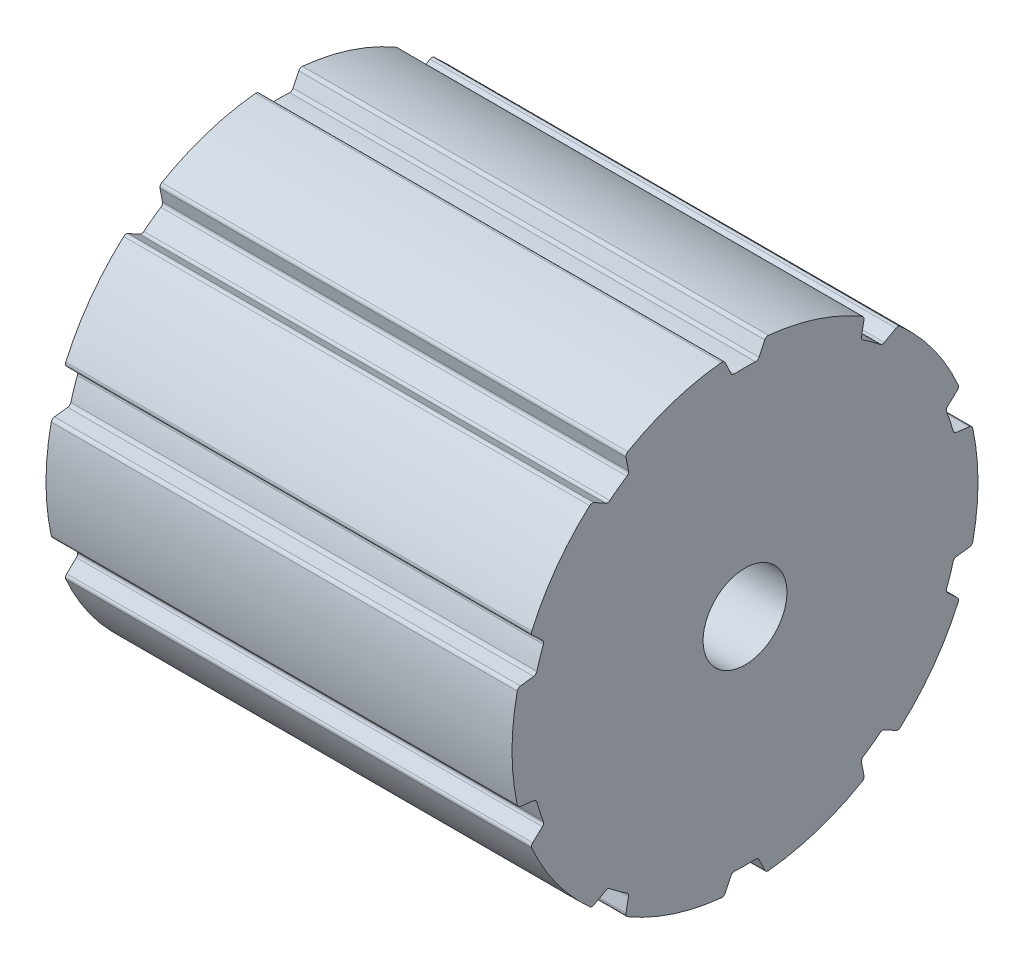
ISO-10303-21;
HEADER;
FILE_DESCRIPTION(('STEP AP214'),'2;1');
FILE_NAME('part.step','',(''),(''),'','','');
FILE_SCHEMA(('AUTOMOTIVE_DESIGN { 1 0 10303 214 1 1 1 1 }'));
ENDSEC;
DATA;
#1=APPLICATION_CONTEXT('core data for automotive mechanical design processes');
#2=APPLICATION_PROTOCOL_DEFINITION('international standard','automotive_design',2000,#1);
#3=PRODUCT_CONTEXT('',#1,'mechanical');
#4=PRODUCT('Part','Part','',(#3));
#5=PRODUCT_RELATED_PRODUCT_CATEGORY('part','',(#4));
#6=PRODUCT_DEFINITION_FORMATION('','',#4);
#7=PRODUCT_DEFINITION_CONTEXT('part definition',#1,'design');
#8=PRODUCT_DEFINITION('design','',#6,#7);
#9=PRODUCT_DEFINITION_SHAPE('','',#8);
#10=(LENGTH_UNIT() NAMED_UNIT(*) SI_UNIT(.MILLI.,.METRE.));
#11=(NAMED_UNIT(*) PLANE_ANGLE_UNIT() SI_UNIT($,.RADIAN.));
#12=(NAMED_UNIT(*) SI_UNIT($,.STERADIAN.) SOLID_ANGLE_UNIT());
#13=UNCERTAINTY_MEASURE_WITH_UNIT(LENGTH_MEASURE(1.E-05),#10,'distance_accuracy_value','');
#14=(GEOMETRIC_REPRESENTATION_CONTEXT(3) GLOBAL_UNCERTAINTY_ASSIGNED_CONTEXT((#13)) GLOBAL_UNIT_ASSIGNED_CONTEXT((#10,
#11,#12)) REPRESENTATION_CONTEXT('',''));
#15=CARTESIAN_POINT('',(0.,0.,0.));
#16=DIRECTION('',(0.,0.,1.));
#17=DIRECTION('',(1.,0.,0.));
#18=AXIS2_PLACEMENT_3D('',#15,#16,#17);
#19=CARTESIAN_POINT('',(0.,2.49999999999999,0.));
#20=DIRECTION('',(1.,0.,0.));
#21=DIRECTION('',(0.,0.,-1.));
#22=AXIS2_PLACEMENT_3D('',#19,#20,#21);
#23=PLANE('',#22);
#24=CARTESIAN_POINT('',(0.,0.,0.));
#25=DIRECTION('',(1.,0.,0.));
#26=DIRECTION('',(0.,0.,-1.));
#27=AXIS2_PLACEMENT_3D('',#24,#25,#26);
#28=CIRCLE('',#27,3.5);
#29=CARTESIAN_POINT('',(0.,3.35410196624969,1.));
#30=VERTEX_POINT('',#29);
#31=CARTESIAN_POINT('',(0.,3.35410196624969,-1.));
#32=VERTEX_POINT('',#31);
#33=EDGE_CURVE('E697',#30,#32,#28,.T.);
#34=ORIENTED_EDGE('',*,*,#33,.T.);
#35=DIRECTION('',(0.,-1.,0.));
#36=VECTOR('',#35,1.);
#37=CARTESIAN_POINT('',(0.,2.29128784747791,-1.));
#38=LINE('',#37,#36);
#39=CARTESIAN_POINT('',(0.,3.5,-1.));
#40=VERTEX_POINT('',#39);
#41=EDGE_CURVE('E715',#40,#32,#38,.T.);
#42=ORIENTED_EDGE('',*,*,#41,.F.);
#43=DIRECTION('',(0.,0.,-1.));
#44=VECTOR('',#43,1.);
#45=CARTESIAN_POINT('',(0.,3.5,-1.));
#46=LINE('',#45,#44);
#47=CARTESIAN_POINT('',(0.,3.5,1.));
#48=VERTEX_POINT('',#47);
#49=EDGE_CURVE('E713',#48,#40,#46,.T.);
#50=ORIENTED_EDGE('',*,*,#49,.F.);
#51=DIRECTION('',(0.,1.,0.));
#52=VECTOR('',#51,1.);
#53=CARTESIAN_POINT('',(0.,2.29128784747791,1.));
#54=LINE('',#53,#52);
#55=EDGE_CURVE('E709',#30,#48,#54,.T.);
#56=ORIENTED_EDGE('',*,*,#55,.F.);
#57=EDGE_LOOP('',(#34,#42,#50,#56));
#58=FACE_BOUND('',#57,.T.);
#59=CARTESIAN_POINT('',(0.,21.2593787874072,-12.3773508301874));
#60=DIRECTION('',(-1.,0.,0.));
#61=DIRECTION('',(0.,-0.587785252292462,-0.809016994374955));
#62=AXIS2_PLACEMENT_3D('',#59,#60,#61);
#63=CIRCLE('',#62,0.400000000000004);
#64=CARTESIAN_POINT('',(0.,21.6050597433,-12.5786085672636));
#65=VERTEX_POINT('',#64);
#66=CARTESIAN_POINT('',(0.,21.1830551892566,-12.7700017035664));
#67=VERTEX_POINT('',#66);
#68=EDGE_CURVE('E572',#65,#67,#63,.T.);
#69=ORIENTED_EDGE('',*,*,#68,.T.);
#70=DIRECTION('',(0.,-0.981627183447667,0.190808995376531));
#71=VECTOR('',#70,1.);
#72=CARTESIAN_POINT('',(0.,21.1830551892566,-12.7700017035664));
#73=LINE('',#72,#71);
#74=CARTESIAN_POINT('',(0.,19.7763521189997,-12.4965663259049));
#75=VERTEX_POINT('',#74);
#76=EDGE_CURVE('E583',#67,#75,#73,.T.);
#77=ORIENTED_EDGE('',*,*,#76,.T.);
#78=CARTESIAN_POINT('',(0.,19.7000285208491,-12.889217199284));
#79=DIRECTION('',(1.,0.,0.));
#80=DIRECTION('',(0.,-0.587785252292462,-0.809016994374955));
#81=AXIS2_PLACEMENT_3D('',#78,#79,#80);
#82=CIRCLE('',#81,0.399999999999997);
#83=CARTESIAN_POINT('',(0.,19.3653062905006,-12.6702171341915));
#84=VERTEX_POINT('',#83);
#85=EDGE_CURVE('E1717',#75,#84,#82,.T.);
#86=ORIENTED_EDGE('',*,*,#85,.T.);
#87=CARTESIAN_POINT('',(0.,0.,0.));
#88=DIRECTION('',(-1.,0.,0.));
#89=DIRECTION('',(0.,-0.587785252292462,-0.809016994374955));
#90=AXIS2_PLACEMENT_3D('',#87,#88,#89);
#91=CIRCLE('',#90,23.1419422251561);
#92=CARTESIAN_POINT('',(0.,18.0343013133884,-14.5021883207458));
#93=VERTEX_POINT('',#92);
#94=EDGE_CURVE('E1720',#84,#93,#91,.T.);
#95=ORIENTED_EDGE('',*,*,#94,.T.);
#96=CARTESIAN_POINT('',(0.,18.3460176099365,-14.7528533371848));
#97=DIRECTION('',(1.,0.,0.));
#98=DIRECTION('',(0.,0.587785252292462,0.809016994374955));
#99=AXIS2_PLACEMENT_3D('',#96,#97,#98);
#100=CIRCLE('',#99,0.399999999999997);
#101=CARTESIAN_POINT('',(0.,17.9961697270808,-14.9467771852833));
#102=VERTEX_POINT('',#101);
#103=EDGE_CURVE('E1723',#93,#102,#100,.T.);
#104=ORIENTED_EDGE('',*,*,#103,.T.);
#105=DIRECTION('',(0.,0.484809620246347,-0.87461970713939));
#106=VECTOR('',#105,1.);
#107=CARTESIAN_POINT('',(0.,18.6909173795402,-16.2001351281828));
#108=LINE('',#107,#106);
#109=CARTESIAN_POINT('',(0.,18.6909173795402,-16.2001351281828));
#110=VERTEX_POINT('',#109);
#111=EDGE_CURVE('E1726',#102,#110,#108,.T.);
#112=ORIENTED_EDGE('',*,*,#111,.T.);
#113=CARTESIAN_POINT('',(0.,18.3410694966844,-16.3940589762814));
#114=DIRECTION('',(-1.,0.,0.));
#115=DIRECTION('',(0.,0.587785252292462,0.809016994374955));
#116=AXIS2_PLACEMENT_3D('',#113,#114,#115);
#117=CIRCLE('',#116,0.400000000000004);
#118=CARTESIAN_POINT('',(0.,18.6392982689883,-16.6606290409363));
#119=VERTEX_POINT('',#118);
#120=EDGE_CURVE('E1729',#110,#119,#117,.T.);
#121=ORIENTED_EDGE('',*,*,#120,.T.);
#122=CARTESIAN_POINT('',(0.,0.,0.));
#123=DIRECTION('',(-1.,0.,0.));
#124=DIRECTION('',(0.,0.,1.));
#125=AXIS2_PLACEMENT_3D('',#122,#123,#124);
#126=CIRCLE('',#125,25.);
#127=CARTESIAN_POINT('',(0.,10.0853398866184,-22.8754435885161));
#128=VERTEX_POINT('',#127);
#129=EDGE_CURVE('E602',#119,#128,#126,.T.);
#130=ORIENTED_EDGE('',*,*,#129,.T.);
#131=CARTESIAN_POINT('',(0.,9.92397444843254,-22.5094364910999));
#132=DIRECTION('',(-1.,0.,0.));
#133=DIRECTION('',(0.,-0.95105651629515,-0.309016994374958));
#134=AXIS2_PLACEMENT_3D('',#131,#132,#133);
#135=CIRCLE('',#134,0.400000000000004);
#136=CARTESIAN_POINT('',(0.,9.63143296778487,-22.7822358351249));
#137=VERTEX_POINT('',#136);
#138=EDGE_CURVE('E1767',#128,#137,#135,.T.);
#139=ORIENTED_EDGE('',*,*,#138,.T.);
#140=DIRECTION('',(0.,-0.681998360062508,0.731353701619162));
#141=VECTOR('',#140,1.);
#142=CARTESIAN_POINT('',(0.,9.63143296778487,-22.7822358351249));
#143=LINE('',#142,#141);
#144=CARTESIAN_POINT('',(0.,8.65410756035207,-21.7341826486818));
#145=VERTEX_POINT('',#144);
#146=EDGE_CURVE('E1770',#137,#145,#143,.T.);
#147=ORIENTED_EDGE('',*,*,#146,.T.);
#148=CARTESIAN_POINT('',(0.,8.3615660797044,-22.0069819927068));
#149=DIRECTION('',(1.,0.,0.));
#150=DIRECTION('',(0.,-0.95105651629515,-0.309016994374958));
#151=AXIS2_PLACEMENT_3D('',#148,#149,#150);
#152=CIRCLE('',#151,0.399999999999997);
#153=CARTESIAN_POINT('',(0.,8.21949511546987,-21.6330624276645));
#154=VERTEX_POINT('',#153);
#155=EDGE_CURVE('E1773',#145,#154,#152,.T.);
#156=ORIENTED_EDGE('',*,*,#155,.T.);
#157=CARTESIAN_POINT('',(0.,0.,0.));
#158=DIRECTION('',(-1.,0.,0.));
#159=DIRECTION('',(0.,-0.95105651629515,-0.309016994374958));
#160=AXIS2_PLACEMENT_3D('',#157,#158,#159);
#161=CIRCLE('',#160,23.1419422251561);
#162=CARTESIAN_POINT('',(0.,6.0658838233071,-22.3328131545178));
#163=VERTEX_POINT('',#162);
#164=EDGE_CURVE('E1776',#154,#163,#161,.T.);
#165=ORIENTED_EDGE('',*,*,#164,.T.);
#166=CARTESIAN_POINT('',(0.,6.17073040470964,-22.7188276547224));
#167=DIRECTION('',(1.,0.,0.));
#168=DIRECTION('',(0.,0.95105651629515,0.309016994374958));
#169=AXIS2_PLACEMENT_3D('',#166,#167,#168);
#170=CIRCLE('',#169,0.399999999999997);
#171=CARTESIAN_POINT('',(0.,5.77371194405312,-22.6700799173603));
#172=VERTEX_POINT('',#171);
#173=EDGE_CURVE('E1779',#163,#172,#170,.T.);
#174=ORIENTED_EDGE('',*,*,#173,.T.);
#175=DIRECTION('',(0.,-0.121869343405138,-0.992546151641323));
#176=VECTOR('',#175,1.);
#177=CARTESIAN_POINT('',(0.,5.59906928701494,-24.0924302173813));
#178=LINE('',#177,#176);
#179=CARTESIAN_POINT('',(0.,5.59906928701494,-24.0924302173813));
#180=VERTEX_POINT('',#179);
#181=EDGE_CURVE('E1782',#172,#180,#178,.T.);
#182=ORIENTED_EDGE('',*,*,#181,.T.);
#183=CARTESIAN_POINT('',(0.,5.20205082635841,-24.0436824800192));
#184=DIRECTION('',(-1.,0.,0.));
#185=DIRECTION('',(0.,0.95105651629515,0.309016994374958));
#186=AXIS2_PLACEMENT_3D('',#183,#184,#185);
#187=CIRCLE('',#186,0.400000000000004);
#188=CARTESIAN_POINT('',(0.,5.28663701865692,-24.4346366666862));
#189=VERTEX_POINT('',#188);
#190=EDGE_CURVE('E1785',#180,#189,#187,.T.);
#191=ORIENTED_EDGE('',*,*,#190,.T.);
#192=CARTESIAN_POINT('',(0.,-5.28663701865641,-24.4346366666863));
#193=VERTEX_POINT('',#192);
#194=EDGE_CURVE('E608',#189,#193,#126,.T.);
#195=ORIENTED_EDGE('',*,*,#194,.T.);
#196=CARTESIAN_POINT('',(0.,-5.20205082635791,-24.0436824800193));
#197=DIRECTION('',(-1.,0.,0.));
#198=DIRECTION('',(0.,-0.951056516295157,0.309016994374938));
#199=AXIS2_PLACEMENT_3D('',#196,#197,#198);
#200=CIRCLE('',#199,0.400000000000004);
#201=CARTESIAN_POINT('',(0.,-5.59906928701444,-24.0924302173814));
#202=VERTEX_POINT('',#201);
#203=EDGE_CURVE('E1824',#193,#202,#200,.T.);
#204=ORIENTED_EDGE('',*,*,#203,.T.);
#205=DIRECTION('',(0.,-0.121869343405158,0.992546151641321));
#206=VECTOR('',#205,1.);
#207=CARTESIAN_POINT('',(0.,-5.59906928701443,-24.0924302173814));
#208=LINE('',#207,#206);
#209=CARTESIAN_POINT('',(0.,-5.77371194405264,-22.6700799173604));
#210=VERTEX_POINT('',#209);
#211=EDGE_CURVE('E1827',#202,#210,#208,.T.);
#212=ORIENTED_EDGE('',*,*,#211,.T.);
#213=CARTESIAN_POINT('',(0.,-6.17073040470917,-22.7188276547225));
#214=DIRECTION('',(1.,0.,0.));
#215=DIRECTION('',(0.,-0.951056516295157,0.309016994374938));
#216=AXIS2_PLACEMENT_3D('',#213,#214,#215);
#217=CIRCLE('',#216,0.399999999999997);
#218=CARTESIAN_POINT('',(0.,-6.06588382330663,-22.3328131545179));
#219=VERTEX_POINT('',#218);
#220=EDGE_CURVE('E1830',#210,#219,#217,.T.);
#221=ORIENTED_EDGE('',*,*,#220,.T.);
#222=CARTESIAN_POINT('',(0.,0.,0.));
#223=DIRECTION('',(-1.,0.,0.));
#224=DIRECTION('',(0.,-0.951056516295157,0.309016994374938));
#225=AXIS2_PLACEMENT_3D('',#222,#223,#224);
#226=CIRCLE('',#225,23.1419422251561);
#227=CARTESIAN_POINT('',(0.,-8.21949511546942,-21.6330624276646));
#228=VERTEX_POINT('',#227);
#229=EDGE_CURVE('E1833',#219,#228,#226,.T.);
#230=ORIENTED_EDGE('',*,*,#229,.T.);
#231=CARTESIAN_POINT('',(0.,-8.36156607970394,-22.006981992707));
#232=DIRECTION('',(1.,0.,0.));
#233=DIRECTION('',(0.,0.951056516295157,-0.309016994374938));
#234=AXIS2_PLACEMENT_3D('',#231,#232,#233);
#235=CIRCLE('',#234,0.399999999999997);
#236=CARTESIAN_POINT('',(0.,-8.65410756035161,-21.734182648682));
#237=VERTEX_POINT('',#236);
#238=EDGE_CURVE('E1836',#228,#237,#235,.T.);
#239=ORIENTED_EDGE('',*,*,#238,.T.);
#240=DIRECTION('',(0.,-0.681998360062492,-0.731353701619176));
#241=VECTOR('',#240,1.);
#242=CARTESIAN_POINT('',(0.,-9.6314329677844,-22.7822358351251));
#243=LINE('',#242,#241);
#244=CARTESIAN_POINT('',(0.,-9.6314329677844,-22.7822358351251));
#245=VERTEX_POINT('',#244);
#246=EDGE_CURVE('E1839',#237,#245,#243,.T.);
#247=ORIENTED_EDGE('',*,*,#246,.T.);
#248=CARTESIAN_POINT('',(0.,-9.92397444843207,-22.5094364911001));
#249=DIRECTION('',(-1.,0.,0.));
#250=DIRECTION('',(0.,0.951056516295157,-0.309016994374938));
#251=AXIS2_PLACEMENT_3D('',#248,#249,#250);
#252=CIRCLE('',#251,0.400000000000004);
#253=CARTESIAN_POINT('',(0.,-10.085339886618,-22.8754435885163));
#254=VERTEX_POINT('',#253);
#255=EDGE_CURVE('E1842',#245,#254,#252,.T.);
#256=ORIENTED_EDGE('',*,*,#255,.T.);
#257=CARTESIAN_POINT('',(0.,-18.6392982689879,-16.6606290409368));
#258=VERTEX_POINT('',#257);
#259=EDGE_CURVE('E2207',#254,#258,#126,.T.);
#260=ORIENTED_EDGE('',*,*,#259,.T.);
#261=CARTESIAN_POINT('',(0.,-18.3410694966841,-16.3940589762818));
#262=DIRECTION('',(-1.,0.,0.));
#263=DIRECTION('',(0.,-0.58778525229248,0.809016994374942));
#264=AXIS2_PLACEMENT_3D('',#261,#262,#263);
#265=CIRCLE('',#264,0.400000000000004);
#266=CARTESIAN_POINT('',(0.,-18.6909173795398,-16.2001351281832));
#267=VERTEX_POINT('',#266);
#268=EDGE_CURVE('E1883',#258,#267,#265,.T.);
#269=ORIENTED_EDGE('',*,*,#268,.T.);
#270=DIRECTION('',(0.,0.484809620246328,0.874619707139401));
#271=VECTOR('',#270,1.);
#272=CARTESIAN_POINT('',(0.,-18.6909173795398,-16.2001351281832));
#273=LINE('',#272,#271);
#274=CARTESIAN_POINT('',(0.,-17.9961697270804,-14.9467771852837));
#275=VERTEX_POINT('',#274);
#276=EDGE_CURVE('E1886',#267,#275,#273,.T.);
#277=ORIENTED_EDGE('',*,*,#276,.T.);
#278=CARTESIAN_POINT('',(0.,-18.3460176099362,-14.7528533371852));
#279=DIRECTION('',(1.,0.,0.));
#280=DIRECTION('',(0.,-0.58778525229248,0.809016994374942));
#281=AXIS2_PLACEMENT_3D('',#278,#279,#280);
#282=CIRCLE('',#281,0.399999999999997);
#283=CARTESIAN_POINT('',(0.,-18.0343013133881,-14.5021883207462));
#284=VERTEX_POINT('',#283);
#285=EDGE_CURVE('E1889',#275,#284,#282,.T.);
#286=ORIENTED_EDGE('',*,*,#285,.T.);
#287=CARTESIAN_POINT('',(0.,0.,0.));
#288=DIRECTION('',(-1.,0.,0.));
#289=DIRECTION('',(0.,-0.58778525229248,0.809016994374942));
#290=AXIS2_PLACEMENT_3D('',#287,#288,#289);
#291=CIRCLE('',#290,23.1419422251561);
#292=CARTESIAN_POINT('',(0.,-19.3653062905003,-12.6702171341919));
#293=VERTEX_POINT('',#292);
#294=EDGE_CURVE('E1892',#284,#293,#291,.T.);
#295=ORIENTED_EDGE('',*,*,#294,.T.);
#296=CARTESIAN_POINT('',(0.,-19.7000285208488,-12.8892171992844));
#297=DIRECTION('',(1.,0.,0.));
#298=DIRECTION('',(0.,0.58778525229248,-0.809016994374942));
#299=AXIS2_PLACEMENT_3D('',#296,#297,#298);
#300=CIRCLE('',#299,0.399999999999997);
#301=CARTESIAN_POINT('',(0.,-19.7763521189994,-12.4965663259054));
#302=VERTEX_POINT('',#301);
#303=EDGE_CURVE('E1895',#293,#302,#300,.T.);
#304=ORIENTED_EDGE('',*,*,#303,.T.);
#305=DIRECTION('',(0.,-0.981627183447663,-0.190808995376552));
#306=VECTOR('',#305,1.);
#307=CARTESIAN_POINT('',(0.,-21.1830551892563,-12.7700017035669));
#308=LINE('',#307,#306);
#309=CARTESIAN_POINT('',(0.,-21.1830551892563,-12.7700017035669));
#310=VERTEX_POINT('',#309);
#311=EDGE_CURVE('E1898',#302,#310,#308,.T.);
#312=ORIENTED_EDGE('',*,*,#311,.T.);
#313=CARTESIAN_POINT('',(0.,-21.259378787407,-12.3773508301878));
#314=DIRECTION('',(-1.,0.,0.));
#315=DIRECTION('',(0.,0.58778525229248,-0.809016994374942));
#316=AXIS2_PLACEMENT_3D('',#313,#314,#315);
#317=CIRCLE('',#316,0.400000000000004);
#318=CARTESIAN_POINT('',(0.,-21.6050597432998,-12.5786085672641));
#319=VERTEX_POINT('',#318);
#320=EDGE_CURVE('E1901',#310,#319,#317,.T.);
#321=ORIENTED_EDGE('',*,*,#320,.T.);
#322=CARTESIAN_POINT('',(0.,-24.8723811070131,-2.52282739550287));
#323=VERTEX_POINT('',#322);
#324=EDGE_CURVE('E2208',#319,#323,#126,.T.);
#325=ORIENTED_EDGE('',*,*,#324,.T.);
#326=CARTESIAN_POINT('',(0.,-24.4744230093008,-2.48246215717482));
#327=DIRECTION('',(-1.,0.,0.));
#328=DIRECTION('',(0.,0.,1.));
#329=AXIS2_PLACEMENT_3D('',#326,#327,#328);
#330=CIRCLE('',#329,0.400000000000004);
#331=CARTESIAN_POINT('',(0.,-24.6434703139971,-2.11993904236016));
#332=VERTEX_POINT('',#331);
#333=EDGE_CURVE('E1942',#323,#332,#330,.T.);
#334=ORIENTED_EDGE('',*,*,#333,.T.);
#335=DIRECTION('',(0.,0.906307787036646,0.422618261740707));
#336=VECTOR('',#335,1.);
#337=CARTESIAN_POINT('',(0.,-24.6434703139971,-2.11993904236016));
#338=LINE('',#337,#336);
#339=CARTESIAN_POINT('',(0.,-23.3447023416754,-1.51431359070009));
#340=VERTEX_POINT('',#339);
#341=EDGE_CURVE('E1945',#332,#340,#338,.T.);
#342=ORIENTED_EDGE('',*,*,#341,.T.);
#343=CARTESIAN_POINT('',(0.,-23.5137496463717,-1.15179047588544));
#344=DIRECTION('',(1.,0.,0.));
#345=DIRECTION('',(0.,0.,1.));
#346=AXIS2_PLACEMENT_3D('',#343,#344,#345);
#347=CIRCLE('',#346,0.399999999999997);
#348=CARTESIAN_POINT('',(0.,-23.1142286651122,-1.13222045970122));
#349=VERTEX_POINT('',#348);
#350=EDGE_CURVE('E1948',#340,#349,#347,.T.);
#351=ORIENTED_EDGE('',*,*,#350,.T.);
#352=CARTESIAN_POINT('',(0.,0.,0.));
#353=DIRECTION('',(-1.,0.,0.));
#354=DIRECTION('',(0.,0.,1.));
#355=AXIS2_PLACEMENT_3D('',#352,#353,#354);
#356=CIRCLE('',#355,23.1419422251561);
#357=CARTESIAN_POINT('',(0.,-23.1142286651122,1.1322204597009));
#358=VERTEX_POINT('',#357);
#359=EDGE_CURVE('E1951',#349,#358,#356,.T.);
#360=ORIENTED_EDGE('',*,*,#359,.T.);
#361=CARTESIAN_POINT('',(0.,-23.5137496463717,1.15179047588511));
#362=DIRECTION('',(1.,0.,0.));
#363=DIRECTION('',(0.,0.,-1.));
#364=AXIS2_PLACEMENT_3D('',#361,#362,#363);
#365=CIRCLE('',#364,0.399999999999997);
#366=CARTESIAN_POINT('',(0.,-23.3447023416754,1.51431359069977));
#367=VERTEX_POINT('',#366);
#368=EDGE_CURVE('E1954',#358,#367,#365,.T.);
#369=ORIENTED_EDGE('',*,*,#368,.T.);
#370=DIRECTION('',(0.,-0.906307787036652,0.422618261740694));
#371=VECTOR('',#370,1.);
#372=CARTESIAN_POINT('',(0.,-24.6434703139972,2.11993904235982));
#373=LINE('',#372,#371);
#374=CARTESIAN_POINT('',(0.,-24.6434703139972,2.11993904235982));
#375=VERTEX_POINT('',#374);
#376=EDGE_CURVE('E1957',#367,#375,#373,.T.);
#377=ORIENTED_EDGE('',*,*,#376,.T.);
#378=CARTESIAN_POINT('',(0.,-24.4744230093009,2.48246215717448));
#379=DIRECTION('',(-1.,0.,0.));
#380=DIRECTION('',(0.,0.,-1.));
#381=AXIS2_PLACEMENT_3D('',#378,#379,#380);
#382=CIRCLE('',#381,0.400000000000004);
#383=CARTESIAN_POINT('',(0.,-24.8723811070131,2.52282739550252));
#384=VERTEX_POINT('',#383);
#385=EDGE_CURVE('E1960',#375,#384,#382,.T.);
#386=ORIENTED_EDGE('',*,*,#385,.T.);
#387=CARTESIAN_POINT('',(0.,-21.6050597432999,12.5786085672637));
#388=VERTEX_POINT('',#387);
#389=EDGE_CURVE('E2211',#384,#388,#126,.T.);
#390=ORIENTED_EDGE('',*,*,#389,.T.);
#391=CARTESIAN_POINT('',(0.,-21.2593787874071,12.3773508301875));
#392=DIRECTION('',(-1.,0.,0.));
#393=DIRECTION('',(0.,0.587785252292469,0.809016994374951));
#394=AXIS2_PLACEMENT_3D('',#391,#392,#393);
#395=CIRCLE('',#394,0.400000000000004);
#396=CARTESIAN_POINT('',(0.,-21.1830551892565,12.7700017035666));
#397=VERTEX_POINT('',#396);
#398=EDGE_CURVE('E2001',#388,#397,#395,.T.);
#399=ORIENTED_EDGE('',*,*,#398,.T.);
#400=DIRECTION('',(0.,0.981627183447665,-0.190808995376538));
#401=VECTOR('',#400,1.);
#402=CARTESIAN_POINT('',(0.,-21.1830551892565,12.7700017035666));
#403=LINE('',#402,#401);
#404=CARTESIAN_POINT('',(0.,-19.7763521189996,12.4965663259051));
#405=VERTEX_POINT('',#404);
#406=EDGE_CURVE('E2004',#397,#405,#403,.T.);
#407=ORIENTED_EDGE('',*,*,#406,.T.);
#408=CARTESIAN_POINT('',(0.,-19.700028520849,12.8892171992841));
#409=DIRECTION('',(1.,0.,0.));
#410=DIRECTION('',(0.,0.587785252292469,0.809016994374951));
#411=AXIS2_PLACEMENT_3D('',#408,#409,#410);
#412=CIRCLE('',#411,0.399999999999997);
#413=CARTESIAN_POINT('',(0.,-19.3653062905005,12.6702171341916));
#414=VERTEX_POINT('',#413);
#415=EDGE_CURVE('E2007',#405,#414,#412,.T.);
#416=ORIENTED_EDGE('',*,*,#415,.T.);
#417=CARTESIAN_POINT('',(0.,0.,0.));
#418=DIRECTION('',(-1.,0.,0.));
#419=DIRECTION('',(0.,0.587785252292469,0.809016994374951));
#420=AXIS2_PLACEMENT_3D('',#417,#418,#419);
#421=CIRCLE('',#420,23.1419422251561);
#422=CARTESIAN_POINT('',(0.,-18.0343013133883,14.502188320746));
#423=VERTEX_POINT('',#422);
#424=EDGE_CURVE('E2010',#414,#423,#421,.T.);
#425=ORIENTED_EDGE('',*,*,#424,.T.);
#426=CARTESIAN_POINT('',(0.,-18.3460176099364,14.7528533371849));
#427=DIRECTION('',(1.,0.,0.));
#428=DIRECTION('',(0.,-0.587785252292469,-0.809016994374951));
#429=AXIS2_PLACEMENT_3D('',#426,#427,#428);
#430=CIRCLE('',#429,0.399999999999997);
#431=CARTESIAN_POINT('',(0.,-17.9961697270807,14.9467771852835));
#432=VERTEX_POINT('',#431);
#433=EDGE_CURVE('E2013',#423,#432,#430,.T.);
#434=ORIENTED_EDGE('',*,*,#433,.T.);
#435=DIRECTION('',(0.,-0.484809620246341,0.874619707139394));
#436=VECTOR('',#435,1.);
#437=CARTESIAN_POINT('',(0.,-18.6909173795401,16.200135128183));
#438=LINE('',#437,#436);
#439=CARTESIAN_POINT('',(0.,-18.6909173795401,16.200135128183));
#440=VERTEX_POINT('',#439);
#441=EDGE_CURVE('E2016',#432,#440,#438,.T.);
#442=ORIENTED_EDGE('',*,*,#441,.T.);
#443=CARTESIAN_POINT('',(0.,-18.3410694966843,16.3940589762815));
#444=DIRECTION('',(-1.,0.,0.));
#445=DIRECTION('',(0.,-0.587785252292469,-0.809016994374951));
#446=AXIS2_PLACEMENT_3D('',#443,#444,#445);
#447=CIRCLE('',#446,0.400000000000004);
#448=CARTESIAN_POINT('',(0.,-18.6392982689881,16.6606290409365));
#449=VERTEX_POINT('',#448);
#450=EDGE_CURVE('E2019',#440,#449,#447,.T.);
#451=ORIENTED_EDGE('',*,*,#450,.T.);
#452=CARTESIAN_POINT('',(0.,-10.0853398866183,22.8754435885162));
#453=VERTEX_POINT('',#452);
#454=EDGE_CURVE('E2214',#449,#453,#126,.T.);
#455=ORIENTED_EDGE('',*,*,#454,.T.);
#456=CARTESIAN_POINT('',(0.,-9.92397444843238,22.5094364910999));
#457=DIRECTION('',(-1.,0.,0.));
#458=DIRECTION('',(0.,0.951056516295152,0.309016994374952));
#459=AXIS2_PLACEMENT_3D('',#456,#457,#458);
#460=CIRCLE('',#459,0.400000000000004);
#461=CARTESIAN_POINT('',(0.,-9.63143296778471,22.7822358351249));
#462=VERTEX_POINT('',#461);
#463=EDGE_CURVE('E2060',#453,#462,#460,.T.);
#464=ORIENTED_EDGE('',*,*,#463,.T.);
#465=DIRECTION('',(0.,0.681998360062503,-0.731353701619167));
#466=VECTOR('',#465,1.);
#467=CARTESIAN_POINT('',(0.,-9.63143296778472,22.7822358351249));
#468=LINE('',#467,#466);
#469=CARTESIAN_POINT('',(0.,-8.65410756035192,21.7341826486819));
#470=VERTEX_POINT('',#469);
#471=EDGE_CURVE('E2063',#462,#470,#468,.T.);
#472=ORIENTED_EDGE('',*,*,#471,.T.);
#473=CARTESIAN_POINT('',(0.,-8.36156607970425,22.0069819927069));
#474=DIRECTION('',(1.,0.,0.));
#475=DIRECTION('',(0.,0.951056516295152,0.309016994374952));
#476=AXIS2_PLACEMENT_3D('',#473,#474,#475);
#477=CIRCLE('',#476,0.399999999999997);
#478=CARTESIAN_POINT('',(0.,-8.21949511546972,21.6330624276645));
#479=VERTEX_POINT('',#478);
#480=EDGE_CURVE('E2066',#470,#479,#477,.T.);
#481=ORIENTED_EDGE('',*,*,#480,.T.);
#482=CARTESIAN_POINT('',(0.,0.,0.));
#483=DIRECTION('',(-1.,0.,0.));
#484=DIRECTION('',(0.,0.951056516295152,0.309016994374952));
#485=AXIS2_PLACEMENT_3D('',#482,#483,#484);
#486=CIRCLE('',#485,23.1419422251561);
#487=CARTESIAN_POINT('',(0.,-6.06588382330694,22.3328131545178));
#488=VERTEX_POINT('',#487);
#489=EDGE_CURVE('E2069',#479,#488,#486,.T.);
#490=ORIENTED_EDGE('',*,*,#489,.T.);
#491=CARTESIAN_POINT('',(0.,-6.17073040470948,22.7188276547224));
#492=DIRECTION('',(1.,0.,0.));
#493=DIRECTION('',(0.,-0.951056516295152,-0.309016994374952));
#494=AXIS2_PLACEMENT_3D('',#491,#492,#493);
#495=CIRCLE('',#494,0.399999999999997);
#496=CARTESIAN_POINT('',(0.,-5.77371194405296,22.6700799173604));
#497=VERTEX_POINT('',#496);
#498=EDGE_CURVE('E2072',#488,#497,#495,.T.);
#499=ORIENTED_EDGE('',*,*,#498,.T.);
#500=DIRECTION('',(0.,0.121869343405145,0.992546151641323));
#501=VECTOR('',#500,1.);
#502=CARTESIAN_POINT('',(0.,-5.59906928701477,24.0924302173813));
#503=LINE('',#502,#501);
#504=CARTESIAN_POINT('',(0.,-5.59906928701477,24.0924302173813));
#505=VERTEX_POINT('',#504);
#506=EDGE_CURVE('E2075',#497,#505,#503,.T.);
#507=ORIENTED_EDGE('',*,*,#506,.T.);
#508=CARTESIAN_POINT('',(0.,-5.20205082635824,24.0436824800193));
#509=DIRECTION('',(-1.,0.,0.));
#510=DIRECTION('',(0.,-0.951056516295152,-0.309016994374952));
#511=AXIS2_PLACEMENT_3D('',#508,#509,#510);
#512=CIRCLE('',#511,0.400000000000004);
#513=CARTESIAN_POINT('',(0.,-5.28663701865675,24.4346366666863));
#514=VERTEX_POINT('',#513);
#515=EDGE_CURVE('E2078',#505,#514,#512,.T.);
#516=ORIENTED_EDGE('',*,*,#515,.T.);
#517=CARTESIAN_POINT('',(0.,5.28663701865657,24.4346366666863));
#518=VERTEX_POINT('',#517);
#519=EDGE_CURVE('E615',#514,#518,#126,.T.);
#520=ORIENTED_EDGE('',*,*,#519,.T.);
#521=CARTESIAN_POINT('',(0.,5.20205082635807,24.0436824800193));
#522=DIRECTION('',(-1.,0.,0.));
#523=DIRECTION('',(0.,0.951056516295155,-0.309016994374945));
#524=AXIS2_PLACEMENT_3D('',#521,#522,#523);
#525=CIRCLE('',#524,0.400000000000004);
#526=CARTESIAN_POINT('',(0.,5.5990692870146,24.0924302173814));
#527=VERTEX_POINT('',#526);
#528=EDGE_CURVE('E2114',#518,#527,#525,.T.);
#529=ORIENTED_EDGE('',*,*,#528,.T.);
#530=DIRECTION('',(0.,0.121869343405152,-0.992546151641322));
#531=VECTOR('',#530,1.);
#532=CARTESIAN_POINT('',(0.,5.5990692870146,24.0924302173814));
#533=LINE('',#532,#531);
#534=CARTESIAN_POINT('',(0.,5.77371194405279,22.6700799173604));
#535=VERTEX_POINT('',#534);
#536=EDGE_CURVE('E2117',#527,#535,#533,.T.);
#537=ORIENTED_EDGE('',*,*,#536,.T.);
#538=CARTESIAN_POINT('',(0.,6.17073040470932,22.7188276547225));
#539=DIRECTION('',(1.,0.,0.));
#540=DIRECTION('',(0.,0.951056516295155,-0.309016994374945));
#541=AXIS2_PLACEMENT_3D('',#538,#539,#540);
#542=CIRCLE('',#541,0.399999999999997);
#543=CARTESIAN_POINT('',(0.,6.06588382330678,22.3328131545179));
#544=VERTEX_POINT('',#543);
#545=EDGE_CURVE('E2120',#535,#544,#542,.T.);
#546=ORIENTED_EDGE('',*,*,#545,.T.);
#547=CARTESIAN_POINT('',(0.,0.,0.));
#548=DIRECTION('',(-1.,0.,0.));
#549=DIRECTION('',(0.,0.951056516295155,-0.309016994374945));
#550=AXIS2_PLACEMENT_3D('',#547,#548,#549);
#551=CIRCLE('',#550,23.1419422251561);
#552=CARTESIAN_POINT('',(0.,8.21949511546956,21.6330624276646));
#553=VERTEX_POINT('',#552);
#554=EDGE_CURVE('E2123',#544,#553,#551,.T.);
#555=ORIENTED_EDGE('',*,*,#554,.T.);
#556=CARTESIAN_POINT('',(0.,8.3615660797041,22.006981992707));
#557=DIRECTION('',(1.,0.,0.));
#558=DIRECTION('',(0.,-0.951056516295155,0.309016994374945));
#559=AXIS2_PLACEMENT_3D('',#556,#557,#558);
#560=CIRCLE('',#559,0.399999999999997);
#561=CARTESIAN_POINT('',(0.,8.65410756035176,21.734182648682));
#562=VERTEX_POINT('',#561);
#563=EDGE_CURVE('E2126',#553,#562,#560,.T.);
#564=ORIENTED_EDGE('',*,*,#563,.T.);
#565=DIRECTION('',(0.,0.681998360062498,0.731353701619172));
#566=VECTOR('',#565,1.);
#567=CARTESIAN_POINT('',(0.,9.63143296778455,22.782235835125));
#568=LINE('',#567,#566);
#569=CARTESIAN_POINT('',(0.,9.63143296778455,22.782235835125));
#570=VERTEX_POINT('',#569);
#571=EDGE_CURVE('E2129',#562,#570,#568,.T.);
#572=ORIENTED_EDGE('',*,*,#571,.T.);
#573=CARTESIAN_POINT('',(0.,9.92397444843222,22.5094364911));
#574=DIRECTION('',(-1.,0.,0.));
#575=DIRECTION('',(0.,-0.951056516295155,0.309016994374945));
#576=AXIS2_PLACEMENT_3D('',#573,#574,#575);
#577=CIRCLE('',#576,0.400000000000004);
#578=CARTESIAN_POINT('',(0.,10.0853398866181,22.8754435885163));
#579=VERTEX_POINT('',#578);
#580=EDGE_CURVE('E2132',#570,#579,#577,.T.);
#581=ORIENTED_EDGE('',*,*,#580,.T.);
#582=CARTESIAN_POINT('',(0.,18.639298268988,16.6606290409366));
#583=VERTEX_POINT('',#582);
#584=EDGE_CURVE('E610',#579,#583,#126,.T.);
#585=ORIENTED_EDGE('',*,*,#584,.T.);
#586=CARTESIAN_POINT('',(0.,18.3410694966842,16.3940589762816));
#587=DIRECTION('',(-1.,0.,0.));
#588=DIRECTION('',(0.,0.587785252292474,-0.809016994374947));
#589=AXIS2_PLACEMENT_3D('',#586,#587,#588);
#590=CIRCLE('',#589,0.400000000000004);
#591=CARTESIAN_POINT('',(0.,18.69091737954,16.2001351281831));
#592=VERTEX_POINT('',#591);
#593=EDGE_CURVE('E1608',#583,#592,#590,.T.);
#594=ORIENTED_EDGE('',*,*,#593,.T.);
#595=DIRECTION('',(0.,-0.484809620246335,-0.874619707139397));
#596=VECTOR('',#595,1.);
#597=CARTESIAN_POINT('',(0.,18.69091737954,16.2001351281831));
#598=LINE('',#597,#596);
#599=CARTESIAN_POINT('',(0.,17.9961697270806,14.9467771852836));
#600=VERTEX_POINT('',#599);
#601=EDGE_CURVE('E1611',#592,#600,#598,.T.);
#602=ORIENTED_EDGE('',*,*,#601,.T.);
#603=CARTESIAN_POINT('',(0.,18.3460176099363,14.7528533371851));
#604=DIRECTION('',(1.,0.,0.));
#605=DIRECTION('',(0.,0.587785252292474,-0.809016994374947));
#606=AXIS2_PLACEMENT_3D('',#603,#604,#605);
#607=CIRCLE('',#606,0.399999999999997);
#608=CARTESIAN_POINT('',(0.,18.0343013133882,14.5021883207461));
#609=VERTEX_POINT('',#608);
#610=EDGE_CURVE('E1619',#600,#609,#607,.T.);
#611=ORIENTED_EDGE('',*,*,#610,.T.);
#612=CARTESIAN_POINT('',(0.,0.,0.));
#613=DIRECTION('',(-1.,0.,0.));
#614=DIRECTION('',(0.,0.587785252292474,-0.809016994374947));
#615=AXIS2_PLACEMENT_3D('',#612,#613,#614);
#616=CIRCLE('',#615,23.1419422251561);
#617=CARTESIAN_POINT('',(0.,19.3653062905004,12.6702171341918));
#618=VERTEX_POINT('',#617);
#619=EDGE_CURVE('E1622',#609,#618,#616,.T.);
#620=ORIENTED_EDGE('',*,*,#619,.T.);
#621=CARTESIAN_POINT('',(0.,19.7000285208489,12.8892171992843));
#622=DIRECTION('',(1.,0.,0.));
#623=DIRECTION('',(0.,-0.587785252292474,0.809016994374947));
#624=AXIS2_PLACEMENT_3D('',#621,#622,#623);
#625=CIRCLE('',#624,0.399999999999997);
#626=CARTESIAN_POINT('',(0.,19.7763521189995,12.4965663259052));
#627=VERTEX_POINT('',#626);
#628=EDGE_CURVE('E1625',#618,#627,#625,.T.);
#629=ORIENTED_EDGE('',*,*,#628,.T.);
#630=DIRECTION('',(0.,0.981627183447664,0.190808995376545));
#631=VECTOR('',#630,1.);
#632=CARTESIAN_POINT('',(0.,21.1830551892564,12.7700017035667));
#633=LINE('',#632,#631);
#634=CARTESIAN_POINT('',(0.,21.1830551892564,12.7700017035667));
#635=VERTEX_POINT('',#634);
#636=EDGE_CURVE('E1628',#627,#635,#633,.T.);
#637=ORIENTED_EDGE('',*,*,#636,.T.);
#638=CARTESIAN_POINT('',(0.,21.259378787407,12.3773508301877));
#639=DIRECTION('',(-1.,0.,0.));
#640=DIRECTION('',(0.,-0.587785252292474,0.809016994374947));
#641=AXIS2_PLACEMENT_3D('',#638,#639,#640);
#642=CIRCLE('',#641,0.400000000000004);
#643=CARTESIAN_POINT('',(0.,21.6050597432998,12.5786085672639));
#644=VERTEX_POINT('',#643);
#645=EDGE_CURVE('E1631',#635,#644,#642,.T.);
#646=ORIENTED_EDGE('',*,*,#645,.T.);
#647=CARTESIAN_POINT('',(0.,24.8723811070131,2.52282739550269));
#648=VERTEX_POINT('',#647);
#649=EDGE_CURVE('E604',#644,#648,#126,.T.);
#650=ORIENTED_EDGE('',*,*,#649,.T.);
#651=CARTESIAN_POINT('',(0.,24.4744230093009,2.48246215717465));
#652=DIRECTION('',(-1.,0.,0.));
#653=DIRECTION('',(0.,0.,-1.));
#654=AXIS2_PLACEMENT_3D('',#651,#652,#653);
#655=CIRCLE('',#654,0.400000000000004);
#656=CARTESIAN_POINT('',(0.,24.6434703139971,2.11993904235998));
#657=VERTEX_POINT('',#656);
#658=EDGE_CURVE('E1670',#648,#657,#655,.T.);
#659=ORIENTED_EDGE('',*,*,#658,.T.);
#660=DIRECTION('',(0.,-0.906307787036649,-0.422618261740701));
#661=VECTOR('',#660,1.);
#662=CARTESIAN_POINT('',(0.,24.6434703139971,2.11993904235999));
#663=LINE('',#662,#661);
#664=CARTESIAN_POINT('',(0.,23.3447023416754,1.51431359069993));
#665=VERTEX_POINT('',#664);
#666=EDGE_CURVE('E1672',#657,#665,#663,.T.);
#667=ORIENTED_EDGE('',*,*,#666,.T.);
#668=CARTESIAN_POINT('',(0.,23.5137496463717,1.15179047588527));
#669=DIRECTION('',(1.,0.,0.));
#670=DIRECTION('',(0.,0.,-1.));
#671=AXIS2_PLACEMENT_3D('',#668,#669,#670);
#672=CIRCLE('',#671,0.399999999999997);
#673=CARTESIAN_POINT('',(0.,23.1142286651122,1.13222045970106));
#674=VERTEX_POINT('',#673);
#675=EDGE_CURVE('E1675',#665,#674,#672,.T.);
#676=ORIENTED_EDGE('',*,*,#675,.T.);
#677=CARTESIAN_POINT('',(0.,0.,0.));
#678=DIRECTION('',(-1.,0.,0.));
#679=DIRECTION('',(0.,0.,-1.));
#680=AXIS2_PLACEMENT_3D('',#677,#678,#679);
#681=CIRCLE('',#680,23.1419422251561);
#682=CARTESIAN_POINT('',(0.,23.1142286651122,-1.13222045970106));
#683=VERTEX_POINT('',#682);
#684=EDGE_CURVE('E1678',#674,#683,#681,.T.);
#685=ORIENTED_EDGE('',*,*,#684,.T.);
#686=CARTESIAN_POINT('',(0.,23.5137496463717,-1.15179047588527));
#687=DIRECTION('',(1.,0.,0.));
#688=DIRECTION('',(0.,0.,1.));
#689=AXIS2_PLACEMENT_3D('',#686,#687,#688);
#690=CIRCLE('',#689,0.399999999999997);
#691=CARTESIAN_POINT('',(0.,23.3447023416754,-1.51431359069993));
#692=VERTEX_POINT('',#691);
#693=EDGE_CURVE('E1681',#683,#692,#690,.T.);
#694=ORIENTED_EDGE('',*,*,#693,.T.);
#695=DIRECTION('',(0.,0.906307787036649,-0.422618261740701));
#696=VECTOR('',#695,1.);
#697=CARTESIAN_POINT('',(0.,24.6434703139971,-2.11993904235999));
#698=LINE('',#697,#696);
#699=CARTESIAN_POINT('',(0.,24.6434703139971,-2.11993904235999));
#700=VERTEX_POINT('',#699);
#701=EDGE_CURVE('E1684',#692,#700,#698,.T.);
#702=ORIENTED_EDGE('',*,*,#701,.T.);
#703=CARTESIAN_POINT('',(0.,24.4744230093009,-2.48246215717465));
#704=DIRECTION('',(-1.,0.,0.));
#705=DIRECTION('',(0.,0.,1.));
#706=AXIS2_PLACEMENT_3D('',#703,#704,#705);
#707=CIRCLE('',#706,0.400000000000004);
#708=CARTESIAN_POINT('',(0.,24.8723811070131,-2.52282739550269));
#709=VERTEX_POINT('',#708);
#710=EDGE_CURVE('E600',#700,#709,#707,.T.);
#711=ORIENTED_EDGE('',*,*,#710,.T.);
#712=EDGE_CURVE('E591',#709,#65,#126,.T.);
#713=ORIENTED_EDGE('',*,*,#712,.T.);
#714=EDGE_LOOP('',(#69,#77,#86,#95,#104,#112,#121,#130,#139,#147,#156,#165,#174,#182,#191,#195,
#204,#212,#221,#230,#239,#247,#256,#260,#269,#277,#286,#295,#304,#312,#321,#325,#334,#342,#351,
#360,#369,#377,#386,#390,#399,#407,#416,#425,#434,#442,#451,#455,#464,#472,#481,#490,#499,#507,
#516,#520,#529,#537,#546,#555,#564,#572,#581,#585,#594,#602,#611,#620,#629,#637,#646,#650,#659,
#667,#676,#685,#694,#702,#711,#713));
#715=FACE_BOUND('',#714,.T.);
#716=ADVANCED_FACE('F35',(#58,#715),#23,.F.);
#717=CARTESIAN_POINT('',(50.,25.,0.));
#718=DIRECTION('',(-1.,0.,0.));
#719=DIRECTION('',(0.,0.,1.));
#720=AXIS2_PLACEMENT_3D('',#717,#718,#719);
#721=PLANE('',#720);
#722=CARTESIAN_POINT('',(50.,0.,0.));
#723=DIRECTION('',(-1.,0.,0.));
#724=DIRECTION('',(0.,0.,1.));
#725=AXIS2_PLACEMENT_3D('',#722,#723,#724);
#726=CIRCLE('',#725,4.5);
#727=CARTESIAN_POINT('',(50.,0.,4.5));
#728=VERTEX_POINT('',#727);
#729=EDGE_CURVE('E621',#728,#728,#726,.T.);
#730=ORIENTED_EDGE('',*,*,#729,.T.);
#731=EDGE_LOOP('',(#730));
#732=FACE_BOUND('',#731,.T.);
#733=CARTESIAN_POINT('',(50.,21.2593787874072,-12.3773508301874));
#734=DIRECTION('',(-1.,0.,0.));
#735=DIRECTION('',(0.,0.,1.));
#736=AXIS2_PLACEMENT_3D('',#733,#734,#735);
#737=CIRCLE('',#736,0.400000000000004);
#738=CARTESIAN_POINT('',(50.,21.1830551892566,-12.7700017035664));
#739=VERTEX_POINT('',#738);
#740=CARTESIAN_POINT('',(50.,21.6050597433,-12.5786085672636));
#741=VERTEX_POINT('',#740);
#742=EDGE_CURVE('E584',#739,#741,#737,.F.);
#743=ORIENTED_EDGE('',*,*,#742,.T.);
#744=CARTESIAN_POINT('',(50.,0.,0.));
#745=DIRECTION('',(-1.,0.,0.));
#746=DIRECTION('',(0.,0.,1.));
#747=AXIS2_PLACEMENT_3D('',#744,#745,#746);
#748=CIRCLE('',#747,25.);
#749=CARTESIAN_POINT('',(50.,24.8723811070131,-2.52282739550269));
#750=VERTEX_POINT('',#749);
#751=EDGE_CURVE('E593',#750,#741,#748,.T.);
#752=ORIENTED_EDGE('',*,*,#751,.F.);
#753=CARTESIAN_POINT('',(50.,24.4744230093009,-2.48246215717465));
#754=DIRECTION('',(-1.,0.,0.));
#755=DIRECTION('',(0.,0.,1.));
#756=AXIS2_PLACEMENT_3D('',#753,#754,#755);
#757=CIRCLE('',#756,0.400000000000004);
#758=CARTESIAN_POINT('',(50.,24.6434703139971,-2.11993904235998));
#759=VERTEX_POINT('',#758);
#760=EDGE_CURVE('E721',#750,#759,#757,.F.);
#761=ORIENTED_EDGE('',*,*,#760,.T.);
#762=DIRECTION('',(0.,-0.906307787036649,0.422618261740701));
#763=VECTOR('',#762,1.);
#764=CARTESIAN_POINT('',(50.,24.6434703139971,-2.11993904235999));
#765=LINE('',#764,#763);
#766=CARTESIAN_POINT('',(50.,23.3447023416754,-1.51431359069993));
#767=VERTEX_POINT('',#766);
#768=EDGE_CURVE('E1652',#759,#767,#765,.T.);
#769=ORIENTED_EDGE('',*,*,#768,.T.);
#770=CARTESIAN_POINT('',(50.,23.5137496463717,-1.15179047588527));
#771=DIRECTION('',(-1.,0.,0.));
#772=DIRECTION('',(0.,0.,1.));
#773=AXIS2_PLACEMENT_3D('',#770,#771,#772);
#774=CIRCLE('',#773,0.399999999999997);
#775=CARTESIAN_POINT('',(50.,23.1142286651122,-1.13222045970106));
#776=VERTEX_POINT('',#775);
#777=EDGE_CURVE('E1655',#767,#776,#774,.T.);
#778=ORIENTED_EDGE('',*,*,#777,.T.);
#779=CARTESIAN_POINT('',(50.,0.,0.));
#780=DIRECTION('',(-1.,0.,0.));
#781=DIRECTION('',(0.,0.,1.));
#782=AXIS2_PLACEMENT_3D('',#779,#780,#781);
#783=CIRCLE('',#782,23.1419422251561);
#784=CARTESIAN_POINT('',(50.,23.1142286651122,1.13222045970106));
#785=VERTEX_POINT('',#784);
#786=EDGE_CURVE('E1658',#776,#785,#783,.F.);
#787=ORIENTED_EDGE('',*,*,#786,.T.);
#788=CARTESIAN_POINT('',(50.,23.5137496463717,1.15179047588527));
#789=DIRECTION('',(-1.,0.,0.));
#790=DIRECTION('',(0.,0.,1.));
#791=AXIS2_PLACEMENT_3D('',#788,#789,#790);
#792=CIRCLE('',#791,0.399999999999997);
#793=CARTESIAN_POINT('',(50.,23.3447023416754,1.51431359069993));
#794=VERTEX_POINT('',#793);
#795=EDGE_CURVE('E1661',#785,#794,#792,.T.);
#796=ORIENTED_EDGE('',*,*,#795,.T.);
#797=DIRECTION('',(0.,0.906307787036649,0.422618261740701));
#798=VECTOR('',#797,1.);
#799=CARTESIAN_POINT('',(50.,24.6434703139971,2.11993904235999));
#800=LINE('',#799,#798);
#801=CARTESIAN_POINT('',(50.,24.6434703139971,2.11993904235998));
#802=VERTEX_POINT('',#801);
#803=EDGE_CURVE('E1664',#794,#802,#800,.T.);
#804=ORIENTED_EDGE('',*,*,#803,.T.);
#805=CARTESIAN_POINT('',(50.,24.4744230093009,2.48246215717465));
#806=DIRECTION('',(-1.,0.,0.));
#807=DIRECTION('',(0.,0.,1.));
#808=AXIS2_PLACEMENT_3D('',#805,#806,#807);
#809=CIRCLE('',#808,0.400000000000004);
#810=CARTESIAN_POINT('',(50.,24.8723811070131,2.52282739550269));
#811=VERTEX_POINT('',#810);
#812=EDGE_CURVE('E1667',#802,#811,#809,.F.);
#813=ORIENTED_EDGE('',*,*,#812,.T.);
#814=CARTESIAN_POINT('',(50.,21.6050597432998,12.5786085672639));
#815=VERTEX_POINT('',#814);
#816=EDGE_CURVE('E617',#815,#811,#748,.T.);
#817=ORIENTED_EDGE('',*,*,#816,.F.);
#818=CARTESIAN_POINT('',(50.,21.259378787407,12.3773508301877));
#819=DIRECTION('',(-1.,0.,0.));
#820=DIRECTION('',(0.,0.,1.));
#821=AXIS2_PLACEMENT_3D('',#818,#819,#820);
#822=CIRCLE('',#821,0.400000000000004);
#823=CARTESIAN_POINT('',(50.,21.1830551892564,12.7700017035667));
#824=VERTEX_POINT('',#823);
#825=EDGE_CURVE('E1645',#815,#824,#822,.F.);
#826=ORIENTED_EDGE('',*,*,#825,.T.);
#827=DIRECTION('',(0.,-0.981627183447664,-0.190808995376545));
#828=VECTOR('',#827,1.);
#829=CARTESIAN_POINT('',(50.,21.1830551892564,12.7700017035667));
#830=LINE('',#829,#828);
#831=CARTESIAN_POINT('',(50.,19.7763521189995,12.4965663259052));
#832=VERTEX_POINT('',#831);
#833=EDGE_CURVE('E2151',#824,#832,#830,.T.);
#834=ORIENTED_EDGE('',*,*,#833,.T.);
#835=CARTESIAN_POINT('',(50.,19.7000285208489,12.8892171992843));
#836=DIRECTION('',(-1.,0.,0.));
#837=DIRECTION('',(0.,0.,1.));
#838=AXIS2_PLACEMENT_3D('',#835,#836,#837);
#839=CIRCLE('',#838,0.399999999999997);
#840=CARTESIAN_POINT('',(50.,19.3653062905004,12.6702171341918));
#841=VERTEX_POINT('',#840);
#842=EDGE_CURVE('E2154',#832,#841,#839,.T.);
#843=ORIENTED_EDGE('',*,*,#842,.T.);
#844=CARTESIAN_POINT('',(50.,0.,0.));
#845=DIRECTION('',(-1.,0.,0.));
#846=DIRECTION('',(0.,0.,1.));
#847=AXIS2_PLACEMENT_3D('',#844,#845,#846);
#848=CIRCLE('',#847,23.1419422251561);
#849=CARTESIAN_POINT('',(50.,18.0343013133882,14.5021883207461));
#850=VERTEX_POINT('',#849);
#851=EDGE_CURVE('E2157',#841,#850,#848,.F.);
#852=ORIENTED_EDGE('',*,*,#851,.T.);
#853=CARTESIAN_POINT('',(50.,18.3460176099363,14.7528533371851));
#854=DIRECTION('',(-1.,0.,0.));
#855=DIRECTION('',(0.,0.,1.));
#856=AXIS2_PLACEMENT_3D('',#853,#854,#855);
#857=CIRCLE('',#856,0.399999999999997);
#858=CARTESIAN_POINT('',(50.,17.9961697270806,14.9467771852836));
#859=VERTEX_POINT('',#858);
#860=EDGE_CURVE('E1613',#850,#859,#857,.T.);
#861=ORIENTED_EDGE('',*,*,#860,.T.);
#862=DIRECTION('',(0.,0.484809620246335,0.874619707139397));
#863=VECTOR('',#862,1.);
#864=CARTESIAN_POINT('',(50.,18.69091737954,16.2001351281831));
#865=LINE('',#864,#863);
#866=CARTESIAN_POINT('',(50.,18.69091737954,16.2001351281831));
#867=VERTEX_POINT('',#866);
#868=EDGE_CURVE('E1607',#859,#867,#865,.T.);
#869=ORIENTED_EDGE('',*,*,#868,.T.);
#870=CARTESIAN_POINT('',(50.,18.3410694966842,16.3940589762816));
#871=DIRECTION('',(-1.,0.,0.));
#872=DIRECTION('',(0.,0.,1.));
#873=AXIS2_PLACEMENT_3D('',#870,#871,#872);
#874=CIRCLE('',#873,0.400000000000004);
#875=CARTESIAN_POINT('',(50.,18.639298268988,16.6606290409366));
#876=VERTEX_POINT('',#875);
#877=EDGE_CURVE('E1604',#867,#876,#874,.F.);
#878=ORIENTED_EDGE('',*,*,#877,.T.);
#879=CARTESIAN_POINT('',(50.,10.0853398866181,22.8754435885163));
#880=VERTEX_POINT('',#879);
#881=EDGE_CURVE('E620',#880,#876,#748,.T.);
#882=ORIENTED_EDGE('',*,*,#881,.F.);
#883=CARTESIAN_POINT('',(50.,9.92397444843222,22.5094364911));
#884=DIRECTION('',(-1.,0.,0.));
#885=DIRECTION('',(0.,0.,1.));
#886=AXIS2_PLACEMENT_3D('',#883,#884,#885);
#887=CIRCLE('',#886,0.400000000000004);
#888=CARTESIAN_POINT('',(50.,9.63143296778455,22.782235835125));
#889=VERTEX_POINT('',#888);
#890=EDGE_CURVE('E1601',#880,#889,#887,.F.);
#891=ORIENTED_EDGE('',*,*,#890,.T.);
#892=DIRECTION('',(0.,-0.681998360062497,-0.731353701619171));
#893=VECTOR('',#892,1.);
#894=CARTESIAN_POINT('',(50.,9.63143296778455,22.782235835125));
#895=LINE('',#894,#893);
#896=CARTESIAN_POINT('',(50.,8.65410756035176,21.734182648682));
#897=VERTEX_POINT('',#896);
#898=EDGE_CURVE('E2097',#889,#897,#895,.T.);
#899=ORIENTED_EDGE('',*,*,#898,.T.);
#900=CARTESIAN_POINT('',(50.,8.3615660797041,22.006981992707));
#901=DIRECTION('',(-1.,0.,0.));
#902=DIRECTION('',(0.,0.,1.));
#903=AXIS2_PLACEMENT_3D('',#900,#901,#902);
#904=CIRCLE('',#903,0.399999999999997);
#905=CARTESIAN_POINT('',(50.,8.21949511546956,21.6330624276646));
#906=VERTEX_POINT('',#905);
#907=EDGE_CURVE('E2099',#897,#906,#904,.T.);
#908=ORIENTED_EDGE('',*,*,#907,.T.);
#909=CARTESIAN_POINT('',(50.,0.,0.));
#910=DIRECTION('',(-1.,0.,0.));
#911=DIRECTION('',(0.,0.,1.));
#912=AXIS2_PLACEMENT_3D('',#909,#910,#911);
#913=CIRCLE('',#912,23.1419422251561);
#914=CARTESIAN_POINT('',(50.,6.06588382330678,22.3328131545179));
#915=VERTEX_POINT('',#914);
#916=EDGE_CURVE('E2102',#906,#915,#913,.F.);
#917=ORIENTED_EDGE('',*,*,#916,.T.);
#918=CARTESIAN_POINT('',(50.,6.17073040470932,22.7188276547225));
#919=DIRECTION('',(-1.,0.,0.));
#920=DIRECTION('',(0.,0.,1.));
#921=AXIS2_PLACEMENT_3D('',#918,#919,#920);
#922=CIRCLE('',#921,0.399999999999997);
#923=CARTESIAN_POINT('',(50.,5.77371194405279,22.6700799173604));
#924=VERTEX_POINT('',#923);
#925=EDGE_CURVE('E2105',#915,#924,#922,.T.);
#926=ORIENTED_EDGE('',*,*,#925,.T.);
#927=DIRECTION('',(0.,-0.121869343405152,0.992546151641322));
#928=VECTOR('',#927,1.);
#929=CARTESIAN_POINT('',(50.,5.5990692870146,24.0924302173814));
#930=LINE('',#929,#928);
#931=CARTESIAN_POINT('',(50.,5.5990692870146,24.0924302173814));
#932=VERTEX_POINT('',#931);
#933=EDGE_CURVE('E2108',#924,#932,#930,.T.);
#934=ORIENTED_EDGE('',*,*,#933,.T.);
#935=CARTESIAN_POINT('',(50.,5.20205082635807,24.0436824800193));
#936=DIRECTION('',(-1.,0.,0.));
#937=DIRECTION('',(0.,0.,1.));
#938=AXIS2_PLACEMENT_3D('',#935,#936,#937);
#939=CIRCLE('',#938,0.400000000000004);
#940=CARTESIAN_POINT('',(50.,5.28663701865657,24.4346366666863));
#941=VERTEX_POINT('',#940);
#942=EDGE_CURVE('E2111',#932,#941,#939,.F.);
#943=ORIENTED_EDGE('',*,*,#942,.T.);
#944=CARTESIAN_POINT('',(50.,-5.28663701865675,24.4346366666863));
#945=VERTEX_POINT('',#944);
#946=EDGE_CURVE('E627',#945,#941,#748,.T.);
#947=ORIENTED_EDGE('',*,*,#946,.F.);
#948=CARTESIAN_POINT('',(50.,-5.20205082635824,24.0436824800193));
#949=DIRECTION('',(-1.,0.,0.));
#950=DIRECTION('',(0.,0.,1.));
#951=AXIS2_PLACEMENT_3D('',#948,#949,#950);
#952=CIRCLE('',#951,0.400000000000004);
#953=CARTESIAN_POINT('',(50.,-5.59906928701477,24.0924302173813));
#954=VERTEX_POINT('',#953);
#955=EDGE_CURVE('E1595',#945,#954,#952,.F.);
#956=ORIENTED_EDGE('',*,*,#955,.T.);
#957=DIRECTION('',(0.,-0.121869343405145,-0.992546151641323));
#958=VECTOR('',#957,1.);
#959=CARTESIAN_POINT('',(50.,-5.59906928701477,24.0924302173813));
#960=LINE('',#959,#958);
#961=CARTESIAN_POINT('',(50.,-5.77371194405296,22.6700799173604));
#962=VERTEX_POINT('',#961);
#963=EDGE_CURVE('E2042',#954,#962,#960,.T.);
#964=ORIENTED_EDGE('',*,*,#963,.T.);
#965=CARTESIAN_POINT('',(50.,-6.17073040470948,22.7188276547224));
#966=DIRECTION('',(-1.,0.,0.));
#967=DIRECTION('',(0.,0.,1.));
#968=AXIS2_PLACEMENT_3D('',#965,#966,#967);
#969=CIRCLE('',#968,0.399999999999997);
#970=CARTESIAN_POINT('',(50.,-6.06588382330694,22.3328131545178));
#971=VERTEX_POINT('',#970);
#972=EDGE_CURVE('E2045',#962,#971,#969,.T.);
#973=ORIENTED_EDGE('',*,*,#972,.T.);
#974=CARTESIAN_POINT('',(50.,0.,0.));
#975=DIRECTION('',(-1.,0.,0.));
#976=DIRECTION('',(0.,0.,1.));
#977=AXIS2_PLACEMENT_3D('',#974,#975,#976);
#978=CIRCLE('',#977,23.1419422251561);
#979=CARTESIAN_POINT('',(50.,-8.21949511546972,21.6330624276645));
#980=VERTEX_POINT('',#979);
#981=EDGE_CURVE('E2048',#971,#980,#978,.F.);
#982=ORIENTED_EDGE('',*,*,#981,.T.);
#983=CARTESIAN_POINT('',(50.,-8.36156607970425,22.0069819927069));
#984=DIRECTION('',(-1.,0.,0.));
#985=DIRECTION('',(0.,0.,1.));
#986=AXIS2_PLACEMENT_3D('',#983,#984,#985);
#987=CIRCLE('',#986,0.399999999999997);
#988=CARTESIAN_POINT('',(50.,-8.65410756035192,21.7341826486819));
#989=VERTEX_POINT('',#988);
#990=EDGE_CURVE('E2051',#980,#989,#987,.T.);
#991=ORIENTED_EDGE('',*,*,#990,.T.);
#992=DIRECTION('',(0.,-0.681998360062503,0.731353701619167));
#993=VECTOR('',#992,1.);
#994=CARTESIAN_POINT('',(50.,-9.63143296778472,22.7822358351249));
#995=LINE('',#994,#993);
#996=CARTESIAN_POINT('',(50.,-9.63143296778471,22.7822358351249));
#997=VERTEX_POINT('',#996);
#998=EDGE_CURVE('E2054',#989,#997,#995,.T.);
#999=ORIENTED_EDGE('',*,*,#998,.T.);
#1000=CARTESIAN_POINT('',(50.,-9.92397444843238,22.5094364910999));
#1001=DIRECTION('',(-1.,0.,0.));
#1002=DIRECTION('',(0.,0.,1.));
#1003=AXIS2_PLACEMENT_3D('',#1000,#1001,#1002);
#1004=CIRCLE('',#1003,0.400000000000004);
#1005=CARTESIAN_POINT('',(50.,-10.0853398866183,22.8754435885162));
#1006=VERTEX_POINT('',#1005);
#1007=EDGE_CURVE('E2057',#997,#1006,#1004,.F.);
#1008=ORIENTED_EDGE('',*,*,#1007,.T.);
#1009=CARTESIAN_POINT('',(50.,-18.6392982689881,16.6606290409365));
#1010=VERTEX_POINT('',#1009);
#1011=EDGE_CURVE('E2181',#1010,#1006,#748,.T.);
#1012=ORIENTED_EDGE('',*,*,#1011,.F.);
#1013=CARTESIAN_POINT('',(50.,-18.3410694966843,16.3940589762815));
#1014=DIRECTION('',(-1.,0.,0.));
#1015=DIRECTION('',(0.,0.,1.));
#1016=AXIS2_PLACEMENT_3D('',#1013,#1014,#1015);
#1017=CIRCLE('',#1016,0.400000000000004);
#1018=CARTESIAN_POINT('',(50.,-18.6909173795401,16.200135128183));
#1019=VERTEX_POINT('',#1018);
#1020=EDGE_CURVE('E2034',#1010,#1019,#1017,.F.);
#1021=ORIENTED_EDGE('',*,*,#1020,.T.);
#1022=DIRECTION('',(0.,0.484809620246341,-0.874619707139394));
#1023=VECTOR('',#1022,1.);
#1024=CARTESIAN_POINT('',(50.,-18.6909173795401,16.200135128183));
#1025=LINE('',#1024,#1023);
#1026=CARTESIAN_POINT('',(50.,-17.9961697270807,14.9467771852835));
#1027=VERTEX_POINT('',#1026);
#1028=EDGE_CURVE('E1983',#1019,#1027,#1025,.T.);
#1029=ORIENTED_EDGE('',*,*,#1028,.T.);
#1030=CARTESIAN_POINT('',(50.,-18.3460176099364,14.7528533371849));
#1031=DIRECTION('',(-1.,0.,0.));
#1032=DIRECTION('',(0.,0.,1.));
#1033=AXIS2_PLACEMENT_3D('',#1030,#1031,#1032);
#1034=CIRCLE('',#1033,0.399999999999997);
#1035=CARTESIAN_POINT('',(50.,-18.0343013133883,14.502188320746));
#1036=VERTEX_POINT('',#1035);
#1037=EDGE_CURVE('E1986',#1027,#1036,#1034,.T.);
#1038=ORIENTED_EDGE('',*,*,#1037,.T.);
#1039=CARTESIAN_POINT('',(50.,0.,0.));
#1040=DIRECTION('',(-1.,0.,0.));
#1041=DIRECTION('',(0.,0.,1.));
#1042=AXIS2_PLACEMENT_3D('',#1039,#1040,#1041);
#1043=CIRCLE('',#1042,23.1419422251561);
#1044=CARTESIAN_POINT('',(50.,-19.3653062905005,12.6702171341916));
#1045=VERTEX_POINT('',#1044);
#1046=EDGE_CURVE('E1989',#1036,#1045,#1043,.F.);
#1047=ORIENTED_EDGE('',*,*,#1046,.T.);
#1048=CARTESIAN_POINT('',(50.,-19.700028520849,12.8892171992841));
#1049=DIRECTION('',(-1.,0.,0.));
#1050=DIRECTION('',(0.,0.,1.));
#1051=AXIS2_PLACEMENT_3D('',#1048,#1049,#1050);
#1052=CIRCLE('',#1051,0.399999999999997);
#1053=CARTESIAN_POINT('',(50.,-19.7763521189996,12.4965663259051));
#1054=VERTEX_POINT('',#1053);
#1055=EDGE_CURVE('E1992',#1045,#1054,#1052,.T.);
#1056=ORIENTED_EDGE('',*,*,#1055,.T.);
#1057=DIRECTION('',(0.,-0.981627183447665,0.190808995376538));
#1058=VECTOR('',#1057,1.);
#1059=CARTESIAN_POINT('',(50.,-21.1830551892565,12.7700017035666));
#1060=LINE('',#1059,#1058);
#1061=CARTESIAN_POINT('',(50.,-21.1830551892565,12.7700017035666));
#1062=VERTEX_POINT('',#1061);
#1063=EDGE_CURVE('E1995',#1054,#1062,#1060,.T.);
#1064=ORIENTED_EDGE('',*,*,#1063,.T.);
#1065=CARTESIAN_POINT('',(50.,-21.2593787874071,12.3773508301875));
#1066=DIRECTION('',(-1.,0.,0.));
#1067=DIRECTION('',(0.,0.,1.));
#1068=AXIS2_PLACEMENT_3D('',#1065,#1066,#1067);
#1069=CIRCLE('',#1068,0.400000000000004);
#1070=CARTESIAN_POINT('',(50.,-21.6050597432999,12.5786085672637));
#1071=VERTEX_POINT('',#1070);
#1072=EDGE_CURVE('E1998',#1062,#1071,#1069,.F.);
#1073=ORIENTED_EDGE('',*,*,#1072,.T.);
#1074=CARTESIAN_POINT('',(50.,-24.8723811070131,2.52282739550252));
#1075=VERTEX_POINT('',#1074);
#1076=EDGE_CURVE('E2182',#1075,#1071,#748,.T.);
#1077=ORIENTED_EDGE('',*,*,#1076,.F.);
#1078=CARTESIAN_POINT('',(50.,-24.4744230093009,2.48246215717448));
#1079=DIRECTION('',(-1.,0.,0.));
#1080=DIRECTION('',(0.,0.,1.));
#1081=AXIS2_PLACEMENT_3D('',#1078,#1079,#1080);
#1082=CIRCLE('',#1081,0.400000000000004);
#1083=CARTESIAN_POINT('',(50.,-24.6434703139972,2.11993904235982));
#1084=VERTEX_POINT('',#1083);
#1085=EDGE_CURVE('E1975',#1075,#1084,#1082,.F.);
#1086=ORIENTED_EDGE('',*,*,#1085,.T.);
#1087=DIRECTION('',(0.,0.906307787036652,-0.422618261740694));
#1088=VECTOR('',#1087,1.);
#1089=CARTESIAN_POINT('',(50.,-24.6434703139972,2.11993904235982));
#1090=LINE('',#1089,#1088);
#1091=CARTESIAN_POINT('',(50.,-23.3447023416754,1.51431359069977));
#1092=VERTEX_POINT('',#1091);
#1093=EDGE_CURVE('E1924',#1084,#1092,#1090,.T.);
#1094=ORIENTED_EDGE('',*,*,#1093,.T.);
#1095=CARTESIAN_POINT('',(50.,-23.5137496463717,1.15179047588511));
#1096=DIRECTION('',(-1.,0.,0.));
#1097=DIRECTION('',(0.,0.,1.));
#1098=AXIS2_PLACEMENT_3D('',#1095,#1096,#1097);
#1099=CIRCLE('',#1098,0.399999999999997);
#1100=CARTESIAN_POINT('',(50.,-23.1142286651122,1.1322204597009));
#1101=VERTEX_POINT('',#1100);
#1102=EDGE_CURVE('E1927',#1092,#1101,#1099,.T.);
#1103=ORIENTED_EDGE('',*,*,#1102,.T.);
#1104=CARTESIAN_POINT('',(50.,0.,0.));
#1105=DIRECTION('',(-1.,0.,0.));
#1106=DIRECTION('',(0.,0.,1.));
#1107=AXIS2_PLACEMENT_3D('',#1104,#1105,#1106);
#1108=CIRCLE('',#1107,23.1419422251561);
#1109=CARTESIAN_POINT('',(50.,-23.1142286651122,-1.13222045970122));
#1110=VERTEX_POINT('',#1109);
#1111=EDGE_CURVE('E1930',#1101,#1110,#1108,.F.);
#1112=ORIENTED_EDGE('',*,*,#1111,.T.);
#1113=CARTESIAN_POINT('',(50.,-23.5137496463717,-1.15179047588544));
#1114=DIRECTION('',(-1.,0.,0.));
#1115=DIRECTION('',(0.,0.,1.));
#1116=AXIS2_PLACEMENT_3D('',#1113,#1114,#1115);
#1117=CIRCLE('',#1116,0.399999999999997);
#1118=CARTESIAN_POINT('',(50.,-23.3447023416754,-1.51431359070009));
#1119=VERTEX_POINT('',#1118);
#1120=EDGE_CURVE('E1933',#1110,#1119,#1117,.T.);
#1121=ORIENTED_EDGE('',*,*,#1120,.T.);
#1122=DIRECTION('',(0.,-0.906307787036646,-0.422618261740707));
#1123=VECTOR('',#1122,1.);
#1124=CARTESIAN_POINT('',(50.,-24.6434703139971,-2.11993904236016));
#1125=LINE('',#1124,#1123);
#1126=CARTESIAN_POINT('',(50.,-24.6434703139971,-2.11993904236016));
#1127=VERTEX_POINT('',#1126);
#1128=EDGE_CURVE('E1936',#1119,#1127,#1125,.T.);
#1129=ORIENTED_EDGE('',*,*,#1128,.T.);
#1130=CARTESIAN_POINT('',(50.,-24.4744230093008,-2.48246215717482));
#1131=DIRECTION('',(-1.,0.,0.));
#1132=DIRECTION('',(0.,0.,1.));
#1133=AXIS2_PLACEMENT_3D('',#1130,#1131,#1132);
#1134=CIRCLE('',#1133,0.400000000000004);
#1135=CARTESIAN_POINT('',(50.,-24.8723811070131,-2.52282739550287));
#1136=VERTEX_POINT('',#1135);
#1137=EDGE_CURVE('E1939',#1127,#1136,#1134,.F.);
#1138=ORIENTED_EDGE('',*,*,#1137,.T.);
#1139=CARTESIAN_POINT('',(50.,-21.6050597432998,-12.578608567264));
#1140=VERTEX_POINT('',#1139);
#1141=EDGE_CURVE('E2186',#1140,#1136,#748,.T.);
#1142=ORIENTED_EDGE('',*,*,#1141,.F.);
#1143=CARTESIAN_POINT('',(50.,-21.259378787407,-12.3773508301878));
#1144=DIRECTION('',(-1.,0.,0.));
#1145=DIRECTION('',(0.,0.,1.));
#1146=AXIS2_PLACEMENT_3D('',#1143,#1144,#1145);
#1147=CIRCLE('',#1146,0.400000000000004);
#1148=CARTESIAN_POINT('',(50.,-21.1830551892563,-12.7700017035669));
#1149=VERTEX_POINT('',#1148);
#1150=EDGE_CURVE('E1916',#1140,#1149,#1147,.F.);
#1151=ORIENTED_EDGE('',*,*,#1150,.T.);
#1152=DIRECTION('',(0.,0.981627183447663,0.190808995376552));
#1153=VECTOR('',#1152,1.);
#1154=CARTESIAN_POINT('',(50.,-21.1830551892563,-12.7700017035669));
#1155=LINE('',#1154,#1153);
#1156=CARTESIAN_POINT('',(50.,-19.7763521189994,-12.4965663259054));
#1157=VERTEX_POINT('',#1156);
#1158=EDGE_CURVE('E1865',#1149,#1157,#1155,.T.);
#1159=ORIENTED_EDGE('',*,*,#1158,.T.);
#1160=CARTESIAN_POINT('',(50.,-19.7000285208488,-12.8892171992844));
#1161=DIRECTION('',(-1.,0.,0.));
#1162=DIRECTION('',(0.,0.,1.));
#1163=AXIS2_PLACEMENT_3D('',#1160,#1161,#1162);
#1164=CIRCLE('',#1163,0.399999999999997);
#1165=CARTESIAN_POINT('',(50.,-19.3653062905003,-12.6702171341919));
#1166=VERTEX_POINT('',#1165);
#1167=EDGE_CURVE('E1868',#1157,#1166,#1164,.T.);
#1168=ORIENTED_EDGE('',*,*,#1167,.T.);
#1169=CARTESIAN_POINT('',(50.,0.,0.));
#1170=DIRECTION('',(-1.,0.,0.));
#1171=DIRECTION('',(0.,0.,1.));
#1172=AXIS2_PLACEMENT_3D('',#1169,#1170,#1171);
#1173=CIRCLE('',#1172,23.1419422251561);
#1174=CARTESIAN_POINT('',(50.,-18.0343013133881,-14.5021883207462));
#1175=VERTEX_POINT('',#1174);
#1176=EDGE_CURVE('E1871',#1166,#1175,#1173,.F.);
#1177=ORIENTED_EDGE('',*,*,#1176,.T.);
#1178=CARTESIAN_POINT('',(50.,-18.3460176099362,-14.7528533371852));
#1179=DIRECTION('',(-1.,0.,0.));
#1180=DIRECTION('',(0.,0.,1.));
#1181=AXIS2_PLACEMENT_3D('',#1178,#1179,#1180);
#1182=CIRCLE('',#1181,0.399999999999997);
#1183=CARTESIAN_POINT('',(50.,-17.9961697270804,-14.9467771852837));
#1184=VERTEX_POINT('',#1183);
#1185=EDGE_CURVE('E1874',#1175,#1184,#1182,.T.);
#1186=ORIENTED_EDGE('',*,*,#1185,.T.);
#1187=DIRECTION('',(0.,-0.484809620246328,-0.874619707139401));
#1188=VECTOR('',#1187,1.);
#1189=CARTESIAN_POINT('',(50.,-18.6909173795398,-16.2001351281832));
#1190=LINE('',#1189,#1188);
#1191=CARTESIAN_POINT('',(50.,-18.6909173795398,-16.2001351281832));
#1192=VERTEX_POINT('',#1191);
#1193=EDGE_CURVE('E1877',#1184,#1192,#1190,.T.);
#1194=ORIENTED_EDGE('',*,*,#1193,.T.);
#1195=CARTESIAN_POINT('',(50.,-18.3410694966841,-16.3940589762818));
#1196=DIRECTION('',(-1.,0.,0.));
#1197=DIRECTION('',(0.,0.,1.));
#1198=AXIS2_PLACEMENT_3D('',#1195,#1196,#1197);
#1199=CIRCLE('',#1198,0.400000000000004);
#1200=CARTESIAN_POINT('',(50.,-18.6392982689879,-16.6606290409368));
#1201=VERTEX_POINT('',#1200);
#1202=EDGE_CURVE('E1880',#1192,#1201,#1199,.F.);
#1203=ORIENTED_EDGE('',*,*,#1202,.T.);
#1204=CARTESIAN_POINT('',(50.,-10.085339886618,-22.8754435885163));
#1205=VERTEX_POINT('',#1204);
#1206=EDGE_CURVE('E2190',#1205,#1201,#748,.T.);
#1207=ORIENTED_EDGE('',*,*,#1206,.F.);
#1208=CARTESIAN_POINT('',(50.,-9.92397444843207,-22.5094364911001));
#1209=DIRECTION('',(-1.,0.,0.));
#1210=DIRECTION('',(0.,0.,1.));
#1211=AXIS2_PLACEMENT_3D('',#1208,#1209,#1210);
#1212=CIRCLE('',#1211,0.400000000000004);
#1213=CARTESIAN_POINT('',(50.,-9.6314329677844,-22.7822358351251));
#1214=VERTEX_POINT('',#1213);
#1215=EDGE_CURVE('E1857',#1205,#1214,#1212,.F.);
#1216=ORIENTED_EDGE('',*,*,#1215,.T.);
#1217=DIRECTION('',(0.,0.681998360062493,0.731353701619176));
#1218=VECTOR('',#1217,1.);
#1219=CARTESIAN_POINT('',(50.,-9.6314329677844,-22.7822358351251));
#1220=LINE('',#1219,#1218);
#1221=CARTESIAN_POINT('',(50.,-8.65410756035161,-21.734182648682));
#1222=VERTEX_POINT('',#1221);
#1223=EDGE_CURVE('E1806',#1214,#1222,#1220,.T.);
#1224=ORIENTED_EDGE('',*,*,#1223,.T.);
#1225=CARTESIAN_POINT('',(50.,-8.36156607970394,-22.006981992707));
#1226=DIRECTION('',(-1.,0.,0.));
#1227=DIRECTION('',(0.,0.,1.));
#1228=AXIS2_PLACEMENT_3D('',#1225,#1226,#1227);
#1229=CIRCLE('',#1228,0.399999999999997);
#1230=CARTESIAN_POINT('',(50.,-8.21949511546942,-21.6330624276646));
#1231=VERTEX_POINT('',#1230);
#1232=EDGE_CURVE('E1809',#1222,#1231,#1229,.T.);
#1233=ORIENTED_EDGE('',*,*,#1232,.T.);
#1234=CARTESIAN_POINT('',(50.,0.,0.));
#1235=DIRECTION('',(-1.,0.,0.));
#1236=DIRECTION('',(0.,0.,1.));
#1237=AXIS2_PLACEMENT_3D('',#1234,#1235,#1236);
#1238=CIRCLE('',#1237,23.1419422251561);
#1239=CARTESIAN_POINT('',(50.,-6.06588382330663,-22.3328131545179));
#1240=VERTEX_POINT('',#1239);
#1241=EDGE_CURVE('E1812',#1231,#1240,#1238,.F.);
#1242=ORIENTED_EDGE('',*,*,#1241,.T.);
#1243=CARTESIAN_POINT('',(50.,-6.17073040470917,-22.7188276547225));
#1244=DIRECTION('',(-1.,0.,0.));
#1245=DIRECTION('',(0.,0.,1.));
#1246=AXIS2_PLACEMENT_3D('',#1243,#1244,#1245);
#1247=CIRCLE('',#1246,0.399999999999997);
#1248=CARTESIAN_POINT('',(50.,-5.77371194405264,-22.6700799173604));
#1249=VERTEX_POINT('',#1248);
#1250=EDGE_CURVE('E1815',#1240,#1249,#1247,.T.);
#1251=ORIENTED_EDGE('',*,*,#1250,.T.);
#1252=DIRECTION('',(0.,0.121869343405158,-0.992546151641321));
#1253=VECTOR('',#1252,1.);
#1254=CARTESIAN_POINT('',(50.,-5.59906928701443,-24.0924302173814));
#1255=LINE('',#1254,#1253);
#1256=CARTESIAN_POINT('',(50.,-5.59906928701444,-24.0924302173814));
#1257=VERTEX_POINT('',#1256);
#1258=EDGE_CURVE('E1818',#1249,#1257,#1255,.T.);
#1259=ORIENTED_EDGE('',*,*,#1258,.T.);
#1260=CARTESIAN_POINT('',(50.,-5.20205082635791,-24.0436824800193));
#1261=DIRECTION('',(-1.,0.,0.));
#1262=DIRECTION('',(0.,0.,1.));
#1263=AXIS2_PLACEMENT_3D('',#1260,#1261,#1262);
#1264=CIRCLE('',#1263,0.400000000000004);
#1265=CARTESIAN_POINT('',(50.,-5.28663701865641,-24.4346366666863));
#1266=VERTEX_POINT('',#1265);
#1267=EDGE_CURVE('E1821',#1257,#1266,#1264,.F.);
#1268=ORIENTED_EDGE('',*,*,#1267,.T.);
#1269=CARTESIAN_POINT('',(50.,5.28663701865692,-24.4346366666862));
#1270=VERTEX_POINT('',#1269);
#1271=EDGE_CURVE('E618',#1270,#1266,#748,.T.);
#1272=ORIENTED_EDGE('',*,*,#1271,.F.);
#1273=CARTESIAN_POINT('',(50.,5.20205082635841,-24.0436824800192));
#1274=DIRECTION('',(-1.,0.,0.));
#1275=DIRECTION('',(0.,0.,1.));
#1276=AXIS2_PLACEMENT_3D('',#1273,#1274,#1275);
#1277=CIRCLE('',#1276,0.400000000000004);
#1278=CARTESIAN_POINT('',(50.,5.59906928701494,-24.0924302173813));
#1279=VERTEX_POINT('',#1278);
#1280=EDGE_CURVE('E64',#1270,#1279,#1277,.F.);
#1281=ORIENTED_EDGE('',*,*,#1280,.T.);
#1282=DIRECTION('',(0.,0.121869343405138,0.992546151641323));
#1283=VECTOR('',#1282,1.);
#1284=CARTESIAN_POINT('',(50.,5.59906928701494,-24.0924302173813));
#1285=LINE('',#1284,#1283);
#1286=CARTESIAN_POINT('',(50.,5.77371194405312,-22.6700799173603));
#1287=VERTEX_POINT('',#1286);
#1288=EDGE_CURVE('E1749',#1279,#1287,#1285,.T.);
#1289=ORIENTED_EDGE('',*,*,#1288,.T.);
#1290=CARTESIAN_POINT('',(50.,6.17073040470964,-22.7188276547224));
#1291=DIRECTION('',(-1.,0.,0.));
#1292=DIRECTION('',(0.,0.,1.));
#1293=AXIS2_PLACEMENT_3D('',#1290,#1291,#1292);
#1294=CIRCLE('',#1293,0.399999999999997);
#1295=CARTESIAN_POINT('',(50.,6.0658838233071,-22.3328131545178));
#1296=VERTEX_POINT('',#1295);
#1297=EDGE_CURVE('E1752',#1287,#1296,#1294,.T.);
#1298=ORIENTED_EDGE('',*,*,#1297,.T.);
#1299=CARTESIAN_POINT('',(50.,0.,0.));
#1300=DIRECTION('',(-1.,0.,0.));
#1301=DIRECTION('',(0.,0.,1.));
#1302=AXIS2_PLACEMENT_3D('',#1299,#1300,#1301);
#1303=CIRCLE('',#1302,23.1419422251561);
#1304=CARTESIAN_POINT('',(50.,8.21949511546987,-21.6330624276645));
#1305=VERTEX_POINT('',#1304);
#1306=EDGE_CURVE('E1755',#1296,#1305,#1303,.F.);
#1307=ORIENTED_EDGE('',*,*,#1306,.T.);
#1308=CARTESIAN_POINT('',(50.,8.3615660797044,-22.0069819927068));
#1309=DIRECTION('',(-1.,0.,0.));
#1310=DIRECTION('',(0.,0.,1.));
#1311=AXIS2_PLACEMENT_3D('',#1308,#1309,#1310);
#1312=CIRCLE('',#1311,0.399999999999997);
#1313=CARTESIAN_POINT('',(50.,8.65410756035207,-21.7341826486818));
#1314=VERTEX_POINT('',#1313);
#1315=EDGE_CURVE('E1758',#1305,#1314,#1312,.T.);
#1316=ORIENTED_EDGE('',*,*,#1315,.T.);
#1317=DIRECTION('',(0.,0.681998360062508,-0.731353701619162));
#1318=VECTOR('',#1317,1.);
#1319=CARTESIAN_POINT('',(50.,9.63143296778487,-22.7822358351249));
#1320=LINE('',#1319,#1318);
#1321=CARTESIAN_POINT('',(50.,9.63143296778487,-22.7822358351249));
#1322=VERTEX_POINT('',#1321);
#1323=EDGE_CURVE('E1761',#1314,#1322,#1320,.T.);
#1324=ORIENTED_EDGE('',*,*,#1323,.T.);
#1325=CARTESIAN_POINT('',(50.,9.92397444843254,-22.5094364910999));
#1326=DIRECTION('',(-1.,0.,0.));
#1327=DIRECTION('',(0.,0.,1.));
#1328=AXIS2_PLACEMENT_3D('',#1325,#1326,#1327);
#1329=CIRCLE('',#1328,0.400000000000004);
#1330=CARTESIAN_POINT('',(50.,10.0853398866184,-22.8754435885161));
#1331=VERTEX_POINT('',#1330);
#1332=EDGE_CURVE('E1764',#1322,#1331,#1329,.F.);
#1333=ORIENTED_EDGE('',*,*,#1332,.T.);
#1334=CARTESIAN_POINT('',(50.,18.6392982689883,-16.6606290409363));
#1335=VERTEX_POINT('',#1334);
#1336=EDGE_CURVE('E616',#1335,#1331,#748,.T.);
#1337=ORIENTED_EDGE('',*,*,#1336,.F.);
#1338=CARTESIAN_POINT('',(50.,18.3410694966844,-16.3940589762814));
#1339=DIRECTION('',(-1.,0.,0.));
#1340=DIRECTION('',(0.,0.,1.));
#1341=AXIS2_PLACEMENT_3D('',#1338,#1339,#1340);
#1342=CIRCLE('',#1341,0.400000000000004);
#1343=CARTESIAN_POINT('',(50.,18.6909173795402,-16.2001351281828));
#1344=VERTEX_POINT('',#1343);
#1345=EDGE_CURVE('E56',#1335,#1344,#1342,.F.);
#1346=ORIENTED_EDGE('',*,*,#1345,.T.);
#1347=DIRECTION('',(0.,-0.484809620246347,0.87461970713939));
#1348=VECTOR('',#1347,1.);
#1349=CARTESIAN_POINT('',(50.,18.6909173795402,-16.2001351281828));
#1350=LINE('',#1349,#1348);
#1351=CARTESIAN_POINT('',(50.,17.9961697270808,-14.9467771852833));
#1352=VERTEX_POINT('',#1351);
#1353=EDGE_CURVE('E594',#1344,#1352,#1350,.T.);
#1354=ORIENTED_EDGE('',*,*,#1353,.T.);
#1355=CARTESIAN_POINT('',(50.,18.3460176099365,-14.7528533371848));
#1356=DIRECTION('',(-1.,0.,0.));
#1357=DIRECTION('',(0.,0.,1.));
#1358=AXIS2_PLACEMENT_3D('',#1355,#1356,#1357);
#1359=CIRCLE('',#1358,0.399999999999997);
#1360=CARTESIAN_POINT('',(50.,18.0343013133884,-14.5021883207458));
#1361=VERTEX_POINT('',#1360);
#1362=EDGE_CURVE('E2294',#1352,#1361,#1359,.T.);
#1363=ORIENTED_EDGE('',*,*,#1362,.T.);
#1364=CARTESIAN_POINT('',(50.,0.,0.));
#1365=DIRECTION('',(-1.,0.,0.));
#1366=DIRECTION('',(0.,0.,1.));
#1367=AXIS2_PLACEMENT_3D('',#1364,#1365,#1366);
#1368=CIRCLE('',#1367,23.1419422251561);
#1369=CARTESIAN_POINT('',(50.,19.3653062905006,-12.6702171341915));
#1370=VERTEX_POINT('',#1369);
#1371=EDGE_CURVE('E2296',#1361,#1370,#1368,.F.);
#1372=ORIENTED_EDGE('',*,*,#1371,.T.);
#1373=CARTESIAN_POINT('',(50.,19.7000285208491,-12.889217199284));
#1374=DIRECTION('',(-1.,0.,0.));
#1375=DIRECTION('',(0.,0.,1.));
#1376=AXIS2_PLACEMENT_3D('',#1373,#1374,#1375);
#1377=CIRCLE('',#1376,0.399999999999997);
#1378=CARTESIAN_POINT('',(50.,19.7763521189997,-12.4965663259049));
#1379=VERTEX_POINT('',#1378);
#1380=EDGE_CURVE('E1712',#1370,#1379,#1377,.T.);
#1381=ORIENTED_EDGE('',*,*,#1380,.T.);
#1382=DIRECTION('',(0.,0.981627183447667,-0.190808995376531));
#1383=VECTOR('',#1382,1.);
#1384=CARTESIAN_POINT('',(50.,21.1830551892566,-12.7700017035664));
#1385=LINE('',#1384,#1383);
#1386=EDGE_CURVE('E1710',#1379,#739,#1385,.T.);
#1387=ORIENTED_EDGE('',*,*,#1386,.T.);
#1388=EDGE_LOOP('',(#743,#752,#761,#769,#778,#787,#796,#804,#813,#817,#826,#834,#843,#852,#861,
#869,#878,#882,#891,#899,#908,#917,#926,#934,#943,#947,#956,#964,#973,#982,#991,#999,#1008,
#1012,#1021,#1029,#1038,#1047,#1056,#1064,#1073,#1077,#1086,#1094,#1103,#1112,#1121,#1129,#1138,
#1142,#1151,#1159,#1168,#1177,#1186,#1194,#1203,#1207,#1216,#1224,#1233,#1242,#1251,#1259,#1268,
#1272,#1281,#1289,#1298,#1307,#1316,#1324,#1333,#1337,#1346,#1354,#1363,#1372,#1381,#1387));
#1389=FACE_BOUND('',#1388,.T.);
#1390=ADVANCED_FACE('F668',(#732,#1389),#721,.F.);
#1391=CARTESIAN_POINT('',(0.,0.,0.));
#1392=DIRECTION('',(-1.,0.,0.));
#1393=DIRECTION('',(0.,0.,1.));
#1394=AXIS2_PLACEMENT_3D('',#1391,#1392,#1393);
#1395=CYLINDRICAL_SURFACE('',#1394,25.);
#1396=DIRECTION('',(-1.,0.,0.));
#1397=VECTOR('',#1396,1.);
#1398=CARTESIAN_POINT('',(25.,18.6392982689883,-16.6606290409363));
#1399=LINE('',#1398,#1397);
#1400=EDGE_CURVE('E595',#1335,#119,#1399,.T.);
#1401=ORIENTED_EDGE('',*,*,#1400,.F.);
#1402=ORIENTED_EDGE('',*,*,#1336,.T.);
#1403=DIRECTION('',(-1.,0.,0.));
#1404=VECTOR('',#1403,1.);
#1405=CARTESIAN_POINT('',(25.,10.0853398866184,-22.8754435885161));
#1406=LINE('',#1405,#1404);
#1407=EDGE_CURVE('E1746',#1331,#128,#1406,.T.);
#1408=ORIENTED_EDGE('',*,*,#1407,.T.);
#1409=ORIENTED_EDGE('',*,*,#129,.F.);
#1410=EDGE_LOOP('',(#1401,#1402,#1408,#1409));
#1411=FACE_BOUND('',#1410,.T.);
#1412=ADVANCED_FACE('F671',(#1411),#1395,.T.);
#1413=DIRECTION('',(-1.,0.,0.));
#1414=VECTOR('',#1413,1.);
#1415=CARTESIAN_POINT('',(25.,5.28663701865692,-24.4346366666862));
#1416=LINE('',#1415,#1414);
#1417=EDGE_CURVE('E1744',#1270,#189,#1416,.T.);
#1418=ORIENTED_EDGE('',*,*,#1417,.F.);
#1419=ORIENTED_EDGE('',*,*,#1271,.T.);
#1420=DIRECTION('',(-1.,0.,0.));
#1421=VECTOR('',#1420,1.);
#1422=CARTESIAN_POINT('',(25.,-5.28663701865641,-24.4346366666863));
#1423=LINE('',#1422,#1421);
#1424=EDGE_CURVE('E1803',#1266,#193,#1423,.T.);
#1425=ORIENTED_EDGE('',*,*,#1424,.T.);
#1426=ORIENTED_EDGE('',*,*,#194,.F.);
#1427=EDGE_LOOP('',(#1418,#1419,#1425,#1426));
#1428=FACE_BOUND('',#1427,.T.);
#1429=ADVANCED_FACE('F1467',(#1428),#1395,.T.);
#1430=DIRECTION('',(-1.,0.,0.));
#1431=VECTOR('',#1430,1.);
#1432=CARTESIAN_POINT('',(25.,-10.085339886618,-22.8754435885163));
#1433=LINE('',#1432,#1431);
#1434=EDGE_CURVE('E1801',#1205,#254,#1433,.T.);
#1435=ORIENTED_EDGE('',*,*,#1434,.F.);
#1436=ORIENTED_EDGE('',*,*,#1206,.T.);
#1437=DIRECTION('',(-1.,0.,0.));
#1438=VECTOR('',#1437,1.);
#1439=CARTESIAN_POINT('',(25.,-18.6392982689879,-16.6606290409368));
#1440=LINE('',#1439,#1438);
#1441=EDGE_CURVE('E1862',#1201,#258,#1440,.T.);
#1442=ORIENTED_EDGE('',*,*,#1441,.T.);
#1443=ORIENTED_EDGE('',*,*,#259,.F.);
#1444=EDGE_LOOP('',(#1435,#1436,#1442,#1443));
#1445=FACE_BOUND('',#1444,.T.);
#1446=ADVANCED_FACE('F1475',(#1445),#1395,.T.);
#1447=DIRECTION('',(-1.,0.,0.));
#1448=VECTOR('',#1447,1.);
#1449=CARTESIAN_POINT('',(25.,-21.6050597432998,-12.578608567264));
#1450=LINE('',#1449,#1448);
#1451=EDGE_CURVE('E1860',#1140,#319,#1450,.T.);
#1452=ORIENTED_EDGE('',*,*,#1451,.F.);
#1453=ORIENTED_EDGE('',*,*,#1141,.T.);
#1454=DIRECTION('',(-1.,0.,0.));
#1455=VECTOR('',#1454,1.);
#1456=CARTESIAN_POINT('',(25.,-24.8723811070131,-2.52282739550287));
#1457=LINE('',#1456,#1455);
#1458=EDGE_CURVE('E1921',#1136,#323,#1457,.T.);
#1459=ORIENTED_EDGE('',*,*,#1458,.T.);
#1460=ORIENTED_EDGE('',*,*,#324,.F.);
#1461=EDGE_LOOP('',(#1452,#1453,#1459,#1460));
#1462=FACE_BOUND('',#1461,.T.);
#1463=ADVANCED_FACE('F1483',(#1462),#1395,.T.);
#1464=DIRECTION('',(-1.,0.,0.));
#1465=VECTOR('',#1464,1.);
#1466=CARTESIAN_POINT('',(25.,-24.8723811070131,2.52282739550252));
#1467=LINE('',#1466,#1465);
#1468=EDGE_CURVE('E1919',#1075,#384,#1467,.T.);
#1469=ORIENTED_EDGE('',*,*,#1468,.F.);
#1470=ORIENTED_EDGE('',*,*,#1076,.T.);
#1471=DIRECTION('',(-1.,0.,0.));
#1472=VECTOR('',#1471,1.);
#1473=CARTESIAN_POINT('',(25.,-21.6050597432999,12.5786085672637));
#1474=LINE('',#1473,#1472);
#1475=EDGE_CURVE('E1980',#1071,#388,#1474,.T.);
#1476=ORIENTED_EDGE('',*,*,#1475,.T.);
#1477=ORIENTED_EDGE('',*,*,#389,.F.);
#1478=EDGE_LOOP('',(#1469,#1470,#1476,#1477));
#1479=FACE_BOUND('',#1478,.T.);
#1480=ADVANCED_FACE('F1491',(#1479),#1395,.T.);
#1481=DIRECTION('',(-1.,0.,0.));
#1482=VECTOR('',#1481,1.);
#1483=CARTESIAN_POINT('',(25.,-18.6392982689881,16.6606290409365));
#1484=LINE('',#1483,#1482);
#1485=EDGE_CURVE('E1978',#1010,#449,#1484,.T.);
#1486=ORIENTED_EDGE('',*,*,#1485,.F.);
#1487=ORIENTED_EDGE('',*,*,#1011,.T.);
#1488=DIRECTION('',(-1.,0.,0.));
#1489=VECTOR('',#1488,1.);
#1490=CARTESIAN_POINT('',(25.,-10.0853398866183,22.8754435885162));
#1491=LINE('',#1490,#1489);
#1492=EDGE_CURVE('E2039',#1006,#453,#1491,.T.);
#1493=ORIENTED_EDGE('',*,*,#1492,.T.);
#1494=ORIENTED_EDGE('',*,*,#454,.F.);
#1495=EDGE_LOOP('',(#1486,#1487,#1493,#1494));
#1496=FACE_BOUND('',#1495,.T.);
#1497=ADVANCED_FACE('F1499',(#1496),#1395,.T.);
#1498=DIRECTION('',(-1.,0.,0.));
#1499=VECTOR('',#1498,1.);
#1500=CARTESIAN_POINT('',(25.,-5.28663701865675,24.4346366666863));
#1501=LINE('',#1500,#1499);
#1502=EDGE_CURVE('E2037',#945,#514,#1501,.T.);
#1503=ORIENTED_EDGE('',*,*,#1502,.F.);
#1504=ORIENTED_EDGE('',*,*,#946,.T.);
#1505=DIRECTION('',(-1.,0.,0.));
#1506=VECTOR('',#1505,1.);
#1507=CARTESIAN_POINT('',(25.,5.28663701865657,24.4346366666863));
#1508=LINE('',#1507,#1506);
#1509=EDGE_CURVE('E1594',#941,#518,#1508,.T.);
#1510=ORIENTED_EDGE('',*,*,#1509,.T.);
#1511=ORIENTED_EDGE('',*,*,#519,.F.);
#1512=EDGE_LOOP('',(#1503,#1504,#1510,#1511));
#1513=FACE_BOUND('',#1512,.T.);
#1514=ADVANCED_FACE('F1507',(#1513),#1395,.T.);
#1515=DIRECTION('',(-1.,0.,0.));
#1516=VECTOR('',#1515,1.);
#1517=CARTESIAN_POINT('',(25.,10.0853398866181,22.8754435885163));
#1518=LINE('',#1517,#1516);
#1519=EDGE_CURVE('E1588',#880,#579,#1518,.T.);
#1520=ORIENTED_EDGE('',*,*,#1519,.F.);
#1521=ORIENTED_EDGE('',*,*,#881,.T.);
#1522=DIRECTION('',(-1.,0.,0.));
#1523=VECTOR('',#1522,1.);
#1524=CARTESIAN_POINT('',(25.,18.639298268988,16.6606290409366));
#1525=LINE('',#1524,#1523);
#1526=EDGE_CURVE('E2149',#876,#583,#1525,.T.);
#1527=ORIENTED_EDGE('',*,*,#1526,.T.);
#1528=ORIENTED_EDGE('',*,*,#584,.F.);
#1529=EDGE_LOOP('',(#1520,#1521,#1527,#1528));
#1530=FACE_BOUND('',#1529,.T.);
#1531=ADVANCED_FACE('F683',(#1530),#1395,.T.);
#1532=DIRECTION('',(-1.,0.,0.));
#1533=VECTOR('',#1532,1.);
#1534=CARTESIAN_POINT('',(25.,21.6050597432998,12.5786085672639));
#1535=LINE('',#1534,#1533);
#1536=EDGE_CURVE('E2147',#815,#644,#1535,.T.);
#1537=ORIENTED_EDGE('',*,*,#1536,.F.);
#1538=ORIENTED_EDGE('',*,*,#816,.T.);
#1539=DIRECTION('',(-1.,0.,0.));
#1540=VECTOR('',#1539,1.);
#1541=CARTESIAN_POINT('',(25.,24.8723811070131,2.52282739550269));
#1542=LINE('',#1541,#1540);
#1543=EDGE_CURVE('E1650',#811,#648,#1542,.T.);
#1544=ORIENTED_EDGE('',*,*,#1543,.T.);
#1545=ORIENTED_EDGE('',*,*,#649,.F.);
#1546=EDGE_LOOP('',(#1537,#1538,#1544,#1545));
#1547=FACE_BOUND('',#1546,.T.);
#1548=ADVANCED_FACE('F675',(#1547),#1395,.T.);
#1549=CARTESIAN_POINT('',(0.,0.,0.));
#1550=DIRECTION('',(-1.,0.,0.));
#1551=DIRECTION('',(0.,0.,1.));
#1552=AXIS2_PLACEMENT_3D('',#1549,#1550,#1551);
#1553=CYLINDRICAL_SURFACE('',#1552,2.49999999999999);
#1554=CARTESIAN_POINT('',(1.00000000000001,0.,0.));
#1555=DIRECTION('',(1.,0.,0.));
#1556=DIRECTION('',(0.,0.,-1.));
#1557=AXIS2_PLACEMENT_3D('',#1554,#1555,#1556);
#1558=CIRCLE('',#1557,2.49999999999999);
#1559=CARTESIAN_POINT('',(1.00000000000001,2.29128784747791,-1.));
#1560=VERTEX_POINT('',#1559);
#1561=CARTESIAN_POINT('',(1.00000000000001,2.29128784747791,1.));
#1562=VERTEX_POINT('',#1561);
#1563=EDGE_CURVE('E606',#1560,#1562,#1558,.F.);
#1564=ORIENTED_EDGE('',*,*,#1563,.T.);
#1565=DIRECTION('',(-1.,0.,0.));
#1566=VECTOR('',#1565,1.);
#1567=CARTESIAN_POINT('',(50.,2.29128784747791,1.));
#1568=LINE('',#1567,#1566);
#1569=CARTESIAN_POINT('',(19.,2.29128784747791,1.));
#1570=VERTEX_POINT('',#1569);
#1571=EDGE_CURVE('E689',#1570,#1562,#1568,.T.);
#1572=ORIENTED_EDGE('',*,*,#1571,.F.);
#1573=CARTESIAN_POINT('',(19.,0.,0.));
#1574=DIRECTION('',(-1.,0.,0.));
#1575=DIRECTION('',(0.,0.,1.));
#1576=AXIS2_PLACEMENT_3D('',#1573,#1574,#1575);
#1577=CIRCLE('',#1576,2.49999999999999);
#1578=CARTESIAN_POINT('',(19.,2.29128784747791,-1.));
#1579=VERTEX_POINT('',#1578);
#1580=EDGE_CURVE('E695',#1570,#1579,#1577,.F.);
#1581=ORIENTED_EDGE('',*,*,#1580,.T.);
#1582=DIRECTION('',(-1.,0.,0.));
#1583=VECTOR('',#1582,1.);
#1584=CARTESIAN_POINT('',(50.,2.29128784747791,-1.));
#1585=LINE('',#1584,#1583);
#1586=EDGE_CURVE('E691',#1579,#1560,#1585,.T.);
#1587=ORIENTED_EDGE('',*,*,#1586,.T.);
#1588=EDGE_LOOP('',(#1564,#1572,#1581,#1587));
#1589=FACE_BOUND('',#1588,.T.);
#1590=ADVANCED_FACE('F674',(#1589),#1553,.F.);
#1591=ORIENTED_EDGE('',*,*,#751,.T.);
#1592=DIRECTION('',(-1.,0.,0.));
#1593=VECTOR('',#1592,1.);
#1594=CARTESIAN_POINT('',(25.,21.6050597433,-12.5786085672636));
#1595=LINE('',#1594,#1593);
#1596=EDGE_CURVE('E576',#741,#65,#1595,.T.);
#1597=ORIENTED_EDGE('',*,*,#1596,.T.);
#1598=ORIENTED_EDGE('',*,*,#712,.F.);
#1599=DIRECTION('',(-1.,0.,0.));
#1600=VECTOR('',#1599,1.);
#1601=CARTESIAN_POINT('',(25.,24.8723811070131,-2.52282739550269));
#1602=LINE('',#1601,#1600);
#1603=EDGE_CURVE('E1648',#750,#709,#1602,.T.);
#1604=ORIENTED_EDGE('',*,*,#1603,.F.);
#1605=EDGE_LOOP('',(#1591,#1597,#1598,#1604));
#1606=FACE_BOUND('',#1605,.T.);
#1607=ADVANCED_FACE('F589',(#1606),#1395,.T.);
#1608=CARTESIAN_POINT('',(0.,0.,0.));
#1609=DIRECTION('',(-1.,0.,0.));
#1610=DIRECTION('',(0.,0.,1.));
#1611=AXIS2_PLACEMENT_3D('',#1608,#1609,#1610);
#1612=CYLINDRICAL_SURFACE('',#1611,4.5);
#1613=ORIENTED_EDGE('',*,*,#729,.F.);
#1614=EDGE_LOOP('',(#1613));
#1615=FACE_BOUND('',#1614,.T.);
#1616=CARTESIAN_POINT('',(20.,0.,0.));
#1617=DIRECTION('',(-1.,0.,0.));
#1618=DIRECTION('',(0.,0.,1.));
#1619=AXIS2_PLACEMENT_3D('',#1616,#1617,#1618);
#1620=CIRCLE('',#1619,4.5);
#1621=CARTESIAN_POINT('',(20.,0.,4.5));
#1622=VERTEX_POINT('',#1621);
#1623=EDGE_CURVE('E629',#1622,#1622,#1620,.T.);
#1624=ORIENTED_EDGE('',*,*,#1623,.T.);
#1625=EDGE_LOOP('',(#1624));
#1626=FACE_BOUND('',#1625,.T.);
#1627=ADVANCED_FACE('F663',(#1615,#1626),#1612,.F.);
#1628=CARTESIAN_POINT('',(20.,4.5,0.));
#1629=DIRECTION('',(-1.,0.,0.));
#1630=DIRECTION('',(0.,0.,1.));
#1631=AXIS2_PLACEMENT_3D('',#1628,#1629,#1630);
#1632=PLANE('',#1631);
#1633=DIRECTION('',(0.,0.,-1.));
#1634=VECTOR('',#1633,1.);
#1635=CARTESIAN_POINT('',(20.,3.5,0.));
#1636=LINE('',#1635,#1634);
#1637=CARTESIAN_POINT('',(20.,3.5,1.));
#1638=VERTEX_POINT('',#1637);
#1639=CARTESIAN_POINT('',(20.,3.5,-1.));
#1640=VERTEX_POINT('',#1639);
#1641=EDGE_CURVE('E644',#1638,#1640,#1636,.T.);
#1642=ORIENTED_EDGE('',*,*,#1641,.T.);
#1643=DIRECTION('',(0.,-1.,0.));
#1644=VECTOR('',#1643,1.);
#1645=CARTESIAN_POINT('',(20.,4.5,-1.));
#1646=LINE('',#1645,#1644);
#1647=CARTESIAN_POINT('',(20.,3.3541019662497,-1.));
#1648=VERTEX_POINT('',#1647);
#1649=EDGE_CURVE('E633',#1640,#1648,#1646,.T.);
#1650=ORIENTED_EDGE('',*,*,#1649,.T.);
#1651=CARTESIAN_POINT('',(20.,0.,0.));
#1652=DIRECTION('',(-1.,0.,0.));
#1653=DIRECTION('',(0.,0.,1.));
#1654=AXIS2_PLACEMENT_3D('',#1651,#1652,#1653);
#1655=CIRCLE('',#1654,3.5);
#1656=CARTESIAN_POINT('',(20.,3.3541019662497,1.));
#1657=VERTEX_POINT('',#1656);
#1658=EDGE_CURVE('E601',#1648,#1657,#1655,.T.);
#1659=ORIENTED_EDGE('',*,*,#1658,.T.);
#1660=DIRECTION('',(0.,1.,0.));
#1661=VECTOR('',#1660,1.);
#1662=CARTESIAN_POINT('',(20.,4.5,1.));
#1663=LINE('',#1662,#1661);
#1664=EDGE_CURVE('E739',#1657,#1638,#1663,.T.);
#1665=ORIENTED_EDGE('',*,*,#1664,.T.);
#1666=EDGE_LOOP('',(#1642,#1650,#1659,#1665));
#1667=FACE_BOUND('',#1666,.T.);
#1668=ORIENTED_EDGE('',*,*,#1623,.F.);
#1669=EDGE_LOOP('',(#1668));
#1670=FACE_BOUND('',#1669,.T.);
#1671=ADVANCED_FACE('F659',(#1667,#1670),#1632,.F.);
#1672=CARTESIAN_POINT('',(20.,0.,0.));
#1673=DIRECTION('',(1.,0.,0.));
#1674=DIRECTION('',(0.,0.,-1.));
#1675=AXIS2_PLACEMENT_3D('',#1672,#1673,#1674);
#1676=CONICAL_SURFACE('',#1675,3.5,0.785398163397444);
#1677=CARTESIAN_POINT('',(18.234891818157,1.41769165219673,-1.));
#1678=CARTESIAN_POINT('',(18.2706915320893,1.46149162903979,-1.));
#1679=CARTESIAN_POINT('',(18.3068103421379,1.50502812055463,-1.));
#1680=CARTESIAN_POINT('',(18.3795758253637,1.59165445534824,-1.));
#1681=CARTESIAN_POINT('',(18.4162224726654,1.6347443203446,-1.));
#1682=CARTESIAN_POINT('',(18.5267816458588,1.76345644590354,-1.));
#1683=CARTESIAN_POINT('',(18.6013254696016,1.84853585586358,-1.));
#1684=CARTESIAN_POINT('',(18.751534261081,2.01764932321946,-1.));
#1685=CARTESIAN_POINT('',(18.827198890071,2.10168368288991,-1.));
#1686=CARTESIAN_POINT('',(18.9793539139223,2.26900846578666,-1.));
#1687=CARTESIAN_POINT('',(19.0558443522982,2.35229884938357,-1.));
#1688=CARTESIAN_POINT('',(19.2985828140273,2.61472151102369,-1.));
#1689=CARTESIAN_POINT('',(19.4659228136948,2.7928423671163,-1.));
#1690=CARTESIAN_POINT('',(19.8021613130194,3.14760194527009,-1.));
#1691=CARTESIAN_POINT('',(19.9710598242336,3.32424065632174,-1.));
#1692=CARTESIAN_POINT('',(20.3099407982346,3.67668571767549,-1.));
#1693=CARTESIAN_POINT('',(20.4799238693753,3.85249148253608,-1.));
#1694=CARTESIAN_POINT('',(20.8205572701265,4.20343721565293,-1.));
#1695=CARTESIAN_POINT('',(20.9912075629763,4.37857721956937,-1.));
#1696=CARTESIAN_POINT('',(21.1620444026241,4.55353247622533,-1.));
#1697=B_SPLINE_CURVE_WITH_KNOTS('',3,(#1677,#1678,#1679,#1680,#1681,#1682,#1683,#1684,#1685,
#1686,#1687,#1688,#1689,#1690,#1691,#1692,#1693,#1694,#1695,#1696),.UNSPECIFIED.,.F.,.F.,(4,2,2,
2,2,2,2,2,2,4),(0.,0.169702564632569,0.339396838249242,0.678728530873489,1.01795967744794,
1.35720878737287,2.09037828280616,2.82355321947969,3.55718375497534,4.29077442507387),.UNSPECIFIED.);
#1698=EDGE_CURVE('E638',#1579,#1648,#1697,.T.);
#1699=ORIENTED_EDGE('',*,*,#1698,.F.);
#1700=ORIENTED_EDGE('',*,*,#1580,.F.);
#1701=CARTESIAN_POINT('',(21.1620444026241,4.55353247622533,1.));
#1702=CARTESIAN_POINT('',(20.9912075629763,4.37857721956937,1.));
#1703=CARTESIAN_POINT('',(20.8205572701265,4.20343721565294,1.));
#1704=CARTESIAN_POINT('',(20.4799238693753,3.8524914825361,1.));
#1705=CARTESIAN_POINT('',(20.3099407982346,3.67668571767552,1.));
#1706=CARTESIAN_POINT('',(19.9710598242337,3.32424065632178,1.));
#1707=CARTESIAN_POINT('',(19.8021613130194,3.14760194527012,1.));
#1708=CARTESIAN_POINT('',(19.4659228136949,2.79284236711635,1.));
#1709=CARTESIAN_POINT('',(19.2985828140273,2.61472151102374,1.));
#1710=CARTESIAN_POINT('',(19.0558443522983,2.35229884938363,1.));
#1711=CARTESIAN_POINT('',(18.9793539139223,2.26900846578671,1.));
#1712=CARTESIAN_POINT('',(18.827198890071,2.10168368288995,1.));
#1713=CARTESIAN_POINT('',(18.751534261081,2.01764932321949,1.));
#1714=CARTESIAN_POINT('',(18.6013254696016,1.8485358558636,1.));
#1715=CARTESIAN_POINT('',(18.5267816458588,1.76345644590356,1.));
#1716=CARTESIAN_POINT('',(18.4162224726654,1.63474432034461,1.));
#1717=CARTESIAN_POINT('',(18.3795758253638,1.59165445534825,1.));
#1718=CARTESIAN_POINT('',(18.3068103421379,1.50502812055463,1.));
#1719=CARTESIAN_POINT('',(18.2706915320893,1.46149162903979,1.));
#1720=CARTESIAN_POINT('',(18.234891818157,1.41769165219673,1.));
#1721=B_SPLINE_CURVE_WITH_KNOTS('',3,(#1701,#1702,#1703,#1704,#1705,#1706,#1707,#1708,#1709,
#1710,#1711,#1712,#1713,#1714,#1715,#1716,#1717,#1718,#1719,#1720),.UNSPECIFIED.,.F.,.F.,(4,2,2,
2,2,2,2,2,2,4),(0.,0.733590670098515,1.46722120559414,2.20039614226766,2.93356563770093,
3.27281474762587,3.61204589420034,3.95137758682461,4.12107186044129,4.29077442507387),.UNSPECIFIED.);
#1722=EDGE_CURVE('E730',#1657,#1570,#1721,.T.);
#1723=ORIENTED_EDGE('',*,*,#1722,.F.);
#1724=ORIENTED_EDGE('',*,*,#1658,.F.);
#1725=EDGE_LOOP('',(#1699,#1700,#1723,#1724));
#1726=FACE_BOUND('',#1725,.T.);
#1727=ADVANCED_FACE('F646',(#1726),#1676,.F.);
#1728=CARTESIAN_POINT('',(1.00000000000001,0.,0.));
#1729=DIRECTION('',(-1.,0.,0.));
#1730=DIRECTION('',(0.,0.,1.));
#1731=AXIS2_PLACEMENT_3D('',#1728,#1729,#1730);
#1732=CONICAL_SURFACE('',#1731,2.49999999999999,0.78539816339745);
#1733=CARTESIAN_POINT('',(-1.55527850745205,4.95538502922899,-1.));
#1734=CARTESIAN_POINT('',(-1.38399997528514,4.7806242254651,-1.));
#1735=CARTESIAN_POINT('',(-1.21287399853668,4.6057126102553,-1.));
#1736=CARTESIAN_POINT('',(-0.871204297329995,4.25546555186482,-1.));
#1737=CARTESIAN_POINT('',(-0.700660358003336,4.08013031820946,-1.));
#1738=CARTESIAN_POINT('',(-0.360574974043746,3.72906395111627,-1.));
#1739=CARTESIAN_POINT('',(-0.191032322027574,3.55333398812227,-1.));
#1740=CARTESIAN_POINT('',(0.147042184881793,3.2007608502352,-1.));
#1741=CARTESIAN_POINT('',(0.315573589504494,3.02391724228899,-1.));
#1742=CARTESIAN_POINT('',(0.56730415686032,2.75709300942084,-1.));
#1743=CARTESIAN_POINT('',(0.651172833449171,2.66774443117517,-1.));
#1744=CARTESIAN_POINT('',(0.818297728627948,2.48849022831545,-1.));
#1745=CARTESIAN_POINT('',(0.90155400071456,2.39858465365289,-1.));
#1746=CARTESIAN_POINT('',(1.06715178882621,2.21811562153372,-1.));
#1747=CARTESIAN_POINT('',(1.14949420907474,2.12755299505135,-1.));
#1748=CARTESIAN_POINT('',(1.31304459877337,1.94535187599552,-1.));
#1749=CARTESIAN_POINT('',(1.3942521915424,1.85371304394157,-1.));
#1750=CARTESIAN_POINT('',(1.55523779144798,1.66859180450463,-1.));
#1751=CARTESIAN_POINT('',(1.63500944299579,1.57510385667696,-1.));
#1752=CARTESIAN_POINT('',(1.79178404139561,1.38594405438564,-1.));
#1753=CARTESIAN_POINT('',(1.86878942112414,1.29027424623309,-1.));
#1754=CARTESIAN_POINT('',(1.9809665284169,1.14386763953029,-1.));
#1755=CARTESIAN_POINT('',(2.01788043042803,1.09447108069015,-1.));
#1756=CARTESIAN_POINT('',(2.09007672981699,0.994526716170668,-1.));
#1757=CARTESIAN_POINT('',(2.12535983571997,0.943979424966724,-1.));
#1758=CARTESIAN_POINT('',(2.19379962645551,0.841211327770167,-1.));
#1759=CARTESIAN_POINT('',(2.22694919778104,0.788985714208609,-1.));
#1760=CARTESIAN_POINT('',(2.27425666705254,0.709157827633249,-1.));
#1761=CARTESIAN_POINT('',(2.28963363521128,0.682279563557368,-1.));
#1762=CARTESIAN_POINT('',(2.319395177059,0.627965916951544,-1.));
#1763=CARTESIAN_POINT('',(2.3337793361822,0.600530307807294,-1.));
#1764=CARTESIAN_POINT('',(2.34757238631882,0.572790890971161,-1.));
#1765=B_SPLINE_CURVE_WITH_KNOTS('',3,(#1733,#1734,#1735,#1736,#1737,#1738,#1739,#1740,#1741,
#1742,#1743,#1744,#1745,#1746,#1747,#1748,#1749,#1750,#1751,#1752,#1753,#1754,#1755,#1756,#1757,
#1758,#1759,#1760,#1761,#1762,#1763,#1764),.UNSPECIFIED.,.F.,.F.,(4,2,2,2,2,2,2,2,2,2,2,2,2,2,2,
4),(0.,0.734098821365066,1.46788846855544,2.20043756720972,2.93329168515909,3.30092284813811,
3.66852150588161,4.03571644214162,4.40303049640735,4.77169535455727,5.14002761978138,
5.32500078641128,5.50989281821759,5.69537238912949,5.78825163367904,5.88116942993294),.UNSPECIFIED.);
#1766=EDGE_CURVE('E11',#32,#1560,#1765,.T.);
#1767=ORIENTED_EDGE('',*,*,#1766,.F.);
#1768=ORIENTED_EDGE('',*,*,#33,.F.);
#1769=CARTESIAN_POINT('',(2.34757238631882,0.572790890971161,1.));
#1770=CARTESIAN_POINT('',(2.32443760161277,0.619233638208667,1.));
#1771=CARTESIAN_POINT('',(2.29971170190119,0.664830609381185,1.));
#1772=CARTESIAN_POINT('',(2.24781291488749,0.754547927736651,1.));
#1773=CARTESIAN_POINT('',(2.2206428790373,0.798669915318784,1.));
#1774=CARTESIAN_POINT('',(2.1646131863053,0.885635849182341,1.));
#1775=CARTESIAN_POINT('',(2.13575848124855,0.928483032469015,1.));
#1776=CARTESIAN_POINT('',(2.07670501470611,1.01325839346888,1.));
#1777=CARTESIAN_POINT('',(2.04650581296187,1.05518626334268,1.));
#1778=CARTESIAN_POINT('',(1.95465844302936,1.17949701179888,1.));
#1779=CARTESIAN_POINT('',(1.89151667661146,1.26077282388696,1.));
#1780=CARTESIAN_POINT('',(1.76272986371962,1.42140281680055,1.));
#1781=CARTESIAN_POINT('',(1.69708272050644,1.50075529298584,1.));
#1782=CARTESIAN_POINT('',(1.53879502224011,1.68811384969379,1.));
#1783=CARTESIAN_POINT('',(1.44541636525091,1.79549461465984,1.));
#1784=CARTESIAN_POINT('',(1.25681732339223,2.00855523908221,1.));
#1785=CARTESIAN_POINT('',(1.16159750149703,2.11423560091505,1.));
#1786=CARTESIAN_POINT('',(0.969668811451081,2.32474713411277,1.));
#1787=CARTESIAN_POINT('',(0.872956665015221,2.42957531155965,1.));
#1788=CARTESIAN_POINT('',(0.678668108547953,2.63844132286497,1.));
#1789=CARTESIAN_POINT('',(0.581091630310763,2.74247909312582,1.));
#1790=CARTESIAN_POINT('',(0.315023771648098,3.02449959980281,1.));
#1791=CARTESIAN_POINT('',(0.145937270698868,3.20192039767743,1.));
#1792=CARTESIAN_POINT('',(-0.193319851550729,3.55571241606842,1.));
#1793=CARTESIAN_POINT('',(-0.363490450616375,3.73208365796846,1.));
#1794=CARTESIAN_POINT('',(-0.703655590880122,4.0832119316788,1.));
#1795=CARTESIAN_POINT('',(-0.873646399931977,4.25797258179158,1.));
#1796=CARTESIAN_POINT('',(-1.21413372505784,4.60700049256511,1.));
#1797=CARTESIAN_POINT('',(-1.38463024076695,4.78126775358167,1.));
#1798=CARTESIAN_POINT('',(-1.55527850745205,4.95538502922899,1.));
#1799=B_SPLINE_CURVE_WITH_KNOTS('',3,(#1769,#1770,#1771,#1772,#1773,#1774,#1775,#1776,#1777,
#1778,#1779,#1780,#1781,#1782,#1783,#1784,#1785,#1786,#1787,#1788,#1789,#1790,#1791,#1792,#1793,
#1794,#1795,#1796,#1797,#1798),.UNSPECIFIED.,.F.,.F.,(4,2,2,2,2,2,2,2,2,2,2,2,2,2,4),(0.,
0.155558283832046,0.310937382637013,0.465880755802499,0.620875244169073,0.929547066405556,
1.23848313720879,1.66535119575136,2.09209073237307,2.51996155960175,2.94786645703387,
3.6831230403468,4.41836459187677,5.14976162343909,5.88115812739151),.UNSPECIFIED.);
#1800=EDGE_CURVE('E49',#1562,#30,#1799,.T.);
#1801=ORIENTED_EDGE('',*,*,#1800,.F.);
#1802=ORIENTED_EDGE('',*,*,#1563,.F.);
#1803=EDGE_LOOP('',(#1767,#1768,#1801,#1802));
#1804=FACE_BOUND('',#1803,.T.);
#1805=ADVANCED_FACE('F37',(#1804),#1732,.F.);
#1806=CARTESIAN_POINT('',(50.,2.29128784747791,-1.));
#1807=DIRECTION('',(0.,0.,-1.));
#1808=DIRECTION('',(-1.,0.,0.));
#1809=AXIS2_PLACEMENT_3D('',#1806,#1807,#1808);
#1810=PLANE('',#1809);
#1811=DIRECTION('',(-1.,0.,0.));
#1812=VECTOR('',#1811,1.);
#1813=CARTESIAN_POINT('',(50.,3.5,-1.));
#1814=LINE('',#1813,#1812);
#1815=EDGE_CURVE('E720',#1640,#40,#1814,.T.);
#1816=ORIENTED_EDGE('',*,*,#1815,.T.);
#1817=ORIENTED_EDGE('',*,*,#41,.T.);
#1818=ORIENTED_EDGE('',*,*,#1766,.T.);
#1819=ORIENTED_EDGE('',*,*,#1586,.F.);
#1820=ORIENTED_EDGE('',*,*,#1698,.T.);
#1821=ORIENTED_EDGE('',*,*,#1649,.F.);
#1822=EDGE_LOOP('',(#1816,#1817,#1818,#1819,#1820,#1821));
#1823=FACE_BOUND('',#1822,.T.);
#1824=ADVANCED_FACE('F649',(#1823),#1810,.F.);
#1825=CARTESIAN_POINT('',(50.,3.5,-1.));
#1826=DIRECTION('',(0.,1.,0.));
#1827=DIRECTION('',(0.,0.,1.));
#1828=AXIS2_PLACEMENT_3D('',#1825,#1826,#1827);
#1829=PLANE('',#1828);
#1830=DIRECTION('',(-1.,0.,0.));
#1831=VECTOR('',#1830,1.);
#1832=CARTESIAN_POINT('',(50.,3.5,1.));
#1833=LINE('',#1832,#1831);
#1834=EDGE_CURVE('E731',#1638,#48,#1833,.T.);
#1835=ORIENTED_EDGE('',*,*,#1834,.T.);
#1836=ORIENTED_EDGE('',*,*,#49,.T.);
#1837=ORIENTED_EDGE('',*,*,#1815,.F.);
#1838=ORIENTED_EDGE('',*,*,#1641,.F.);
#1839=EDGE_LOOP('',(#1835,#1836,#1837,#1838));
#1840=FACE_BOUND('',#1839,.T.);
#1841=ADVANCED_FACE('F654',(#1840),#1829,.F.);
#1842=CARTESIAN_POINT('',(50.,2.29128784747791,1.));
#1843=DIRECTION('',(0.,0.,1.));
#1844=DIRECTION('',(1.,0.,0.));
#1845=AXIS2_PLACEMENT_3D('',#1842,#1843,#1844);
#1846=PLANE('',#1845);
#1847=ORIENTED_EDGE('',*,*,#1722,.T.);
#1848=ORIENTED_EDGE('',*,*,#1571,.T.);
#1849=ORIENTED_EDGE('',*,*,#1800,.T.);
#1850=ORIENTED_EDGE('',*,*,#55,.T.);
#1851=ORIENTED_EDGE('',*,*,#1834,.F.);
#1852=ORIENTED_EDGE('',*,*,#1664,.F.);
#1853=EDGE_LOOP('',(#1847,#1848,#1849,#1850,#1851,#1852));
#1854=FACE_BOUND('',#1853,.T.);
#1855=ADVANCED_FACE('F656',(#1854),#1846,.F.);
#1856=CARTESIAN_POINT('',(50.001,24.4744230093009,2.48246215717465));
#1857=DIRECTION('',(-1.,0.,0.));
#1858=DIRECTION('',(0.,0.,1.));
#1859=AXIS2_PLACEMENT_3D('',#1856,#1857,#1858);
#1860=CYLINDRICAL_SURFACE('',#1859,0.400000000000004);
#1861=DIRECTION('',(-1.,0.,0.));
#1862=VECTOR('',#1861,1.);
#1863=CARTESIAN_POINT('',(50.001,24.6434703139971,2.11993904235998));
#1864=LINE('',#1863,#1862);
#1865=EDGE_CURVE('E724',#802,#657,#1864,.T.);
#1866=ORIENTED_EDGE('',*,*,#1865,.T.);
#1867=ORIENTED_EDGE('',*,*,#658,.F.);
#1868=ORIENTED_EDGE('',*,*,#1543,.F.);
#1869=ORIENTED_EDGE('',*,*,#812,.F.);
#1870=EDGE_LOOP('',(#1866,#1867,#1868,#1869));
#1871=FACE_BOUND('',#1870,.T.);
#1872=ADVANCED_FACE('F767',(#1871),#1860,.T.);
#1873=CARTESIAN_POINT('',(50.001,24.6434703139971,2.11993904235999));
#1874=DIRECTION('',(0.,0.422618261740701,-0.906307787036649));
#1875=DIRECTION('',(0.,0.906307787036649,0.422618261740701));
#1876=AXIS2_PLACEMENT_3D('',#1873,#1874,#1875);
#1877=PLANE('',#1876);
#1878=DIRECTION('',(-1.,0.,0.));
#1879=VECTOR('',#1878,1.);
#1880=CARTESIAN_POINT('',(50.001,23.3447023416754,1.51431359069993));
#1881=LINE('',#1880,#1879);
#1882=EDGE_CURVE('E1695',#794,#665,#1881,.T.);
#1883=ORIENTED_EDGE('',*,*,#1882,.T.);
#1884=ORIENTED_EDGE('',*,*,#666,.F.);
#1885=ORIENTED_EDGE('',*,*,#1865,.F.);
#1886=ORIENTED_EDGE('',*,*,#803,.F.);
#1887=EDGE_LOOP('',(#1883,#1884,#1885,#1886));
#1888=FACE_BOUND('',#1887,.T.);
#1889=ADVANCED_FACE('F773',(#1888),#1877,.T.);
#1890=CARTESIAN_POINT('',(50.001,23.5137496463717,1.15179047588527));
#1891=DIRECTION('',(-1.,0.,0.));
#1892=DIRECTION('',(0.,0.,1.));
#1893=AXIS2_PLACEMENT_3D('',#1890,#1891,#1892);
#1894=CYLINDRICAL_SURFACE('',#1893,0.399999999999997);
#1895=DIRECTION('',(-1.,0.,0.));
#1896=VECTOR('',#1895,1.);
#1897=CARTESIAN_POINT('',(50.001,23.1142286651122,1.13222045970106));
#1898=LINE('',#1897,#1896);
#1899=EDGE_CURVE('E1693',#785,#674,#1898,.T.);
#1900=ORIENTED_EDGE('',*,*,#1899,.T.);
#1901=ORIENTED_EDGE('',*,*,#675,.F.);
#1902=ORIENTED_EDGE('',*,*,#1882,.F.);
#1903=ORIENTED_EDGE('',*,*,#795,.F.);
#1904=EDGE_LOOP('',(#1900,#1901,#1902,#1903));
#1905=FACE_BOUND('',#1904,.T.);
#1906=ADVANCED_FACE('F781',(#1905),#1894,.F.);
#1907=CARTESIAN_POINT('',(50.001,0.,0.));
#1908=DIRECTION('',(-1.,0.,0.));
#1909=DIRECTION('',(0.,0.,1.));
#1910=AXIS2_PLACEMENT_3D('',#1907,#1908,#1909);
#1911=CYLINDRICAL_SURFACE('',#1910,23.1419422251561);
#1912=DIRECTION('',(-1.,0.,0.));
#1913=VECTOR('',#1912,1.);
#1914=CARTESIAN_POINT('',(50.001,23.1142286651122,-1.13222045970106));
#1915=LINE('',#1914,#1913);
#1916=EDGE_CURVE('E1691',#776,#683,#1915,.T.);
#1917=ORIENTED_EDGE('',*,*,#1916,.T.);
#1918=ORIENTED_EDGE('',*,*,#684,.F.);
#1919=ORIENTED_EDGE('',*,*,#1899,.F.);
#1920=ORIENTED_EDGE('',*,*,#786,.F.);
#1921=EDGE_LOOP('',(#1917,#1918,#1919,#1920));
#1922=FACE_BOUND('',#1921,.T.);
#1923=ADVANCED_FACE('F789',(#1922),#1911,.T.);
#1924=CARTESIAN_POINT('',(50.001,23.5137496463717,-1.15179047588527));
#1925=DIRECTION('',(-1.,0.,0.));
#1926=DIRECTION('',(0.,0.,1.));
#1927=AXIS2_PLACEMENT_3D('',#1924,#1925,#1926);
#1928=CYLINDRICAL_SURFACE('',#1927,0.399999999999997);
#1929=DIRECTION('',(-1.,0.,0.));
#1930=VECTOR('',#1929,1.);
#1931=CARTESIAN_POINT('',(50.001,23.3447023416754,-1.51431359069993));
#1932=LINE('',#1931,#1930);
#1933=EDGE_CURVE('E1689',#767,#692,#1932,.T.);
#1934=ORIENTED_EDGE('',*,*,#1933,.T.);
#1935=ORIENTED_EDGE('',*,*,#693,.F.);
#1936=ORIENTED_EDGE('',*,*,#1916,.F.);
#1937=ORIENTED_EDGE('',*,*,#777,.F.);
#1938=EDGE_LOOP('',(#1934,#1935,#1936,#1937));
#1939=FACE_BOUND('',#1938,.T.);
#1940=ADVANCED_FACE('F797',(#1939),#1928,.F.);
#1941=CARTESIAN_POINT('',(50.001,24.6434703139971,-2.11993904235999));
#1942=DIRECTION('',(0.,0.422618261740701,0.906307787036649));
#1943=DIRECTION('',(0.,-0.906307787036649,0.422618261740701));
#1944=AXIS2_PLACEMENT_3D('',#1941,#1942,#1943);
#1945=PLANE('',#1944);
#1946=DIRECTION('',(-1.,0.,0.));
#1947=VECTOR('',#1946,1.);
#1948=CARTESIAN_POINT('',(50.001,24.6434703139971,-2.11993904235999));
#1949=LINE('',#1948,#1947);
#1950=EDGE_CURVE('E1687',#759,#700,#1949,.T.);
#1951=ORIENTED_EDGE('',*,*,#1950,.T.);
#1952=ORIENTED_EDGE('',*,*,#701,.F.);
#1953=ORIENTED_EDGE('',*,*,#1933,.F.);
#1954=ORIENTED_EDGE('',*,*,#768,.F.);
#1955=EDGE_LOOP('',(#1951,#1952,#1953,#1954));
#1956=FACE_BOUND('',#1955,.T.);
#1957=ADVANCED_FACE('F805',(#1956),#1945,.T.);
#1958=CARTESIAN_POINT('',(50.001,24.4744230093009,-2.48246215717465));
#1959=DIRECTION('',(-1.,0.,0.));
#1960=DIRECTION('',(0.,0.,1.));
#1961=AXIS2_PLACEMENT_3D('',#1958,#1959,#1960);
#1962=CYLINDRICAL_SURFACE('',#1961,0.400000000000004);
#1963=ORIENTED_EDGE('',*,*,#1603,.T.);
#1964=ORIENTED_EDGE('',*,*,#710,.F.);
#1965=ORIENTED_EDGE('',*,*,#1950,.F.);
#1966=ORIENTED_EDGE('',*,*,#760,.F.);
#1967=EDGE_LOOP('',(#1963,#1964,#1965,#1966));
#1968=FACE_BOUND('',#1967,.T.);
#1969=ADVANCED_FACE('F813',(#1968),#1962,.T.);
#1970=CARTESIAN_POINT('',(50.001,18.3410694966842,16.3940589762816));
#1971=DIRECTION('',(-1.,0.,0.));
#1972=DIRECTION('',(0.,0.,1.));
#1973=AXIS2_PLACEMENT_3D('',#1970,#1971,#1972);
#1974=CYLINDRICAL_SURFACE('',#1973,0.400000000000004);
#1975=DIRECTION('',(-1.,0.,0.));
#1976=VECTOR('',#1975,1.);
#1977=CARTESIAN_POINT('',(50.001,18.69091737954,16.2001351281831));
#1978=LINE('',#1977,#1976);
#1979=EDGE_CURVE('E1643',#867,#592,#1978,.T.);
#1980=ORIENTED_EDGE('',*,*,#1979,.T.);
#1981=ORIENTED_EDGE('',*,*,#593,.F.);
#1982=ORIENTED_EDGE('',*,*,#1526,.F.);
#1983=ORIENTED_EDGE('',*,*,#877,.F.);
#1984=EDGE_LOOP('',(#1980,#1981,#1982,#1983));
#1985=FACE_BOUND('',#1984,.T.);
#1986=ADVANCED_FACE('F821',(#1985),#1974,.T.);
#1987=CARTESIAN_POINT('',(50.001,18.69091737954,16.2001351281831));
#1988=DIRECTION('',(0.,0.874619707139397,-0.484809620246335));
#1989=DIRECTION('',(0.,0.484809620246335,0.874619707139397));
#1990=AXIS2_PLACEMENT_3D('',#1987,#1988,#1989);
#1991=PLANE('',#1990);
#1992=DIRECTION('',(-1.,0.,0.));
#1993=VECTOR('',#1992,1.);
#1994=CARTESIAN_POINT('',(50.001,17.9961697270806,14.9467771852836));
#1995=LINE('',#1994,#1993);
#1996=EDGE_CURVE('E1641',#859,#600,#1995,.T.);
#1997=ORIENTED_EDGE('',*,*,#1996,.T.);
#1998=ORIENTED_EDGE('',*,*,#601,.F.);
#1999=ORIENTED_EDGE('',*,*,#1979,.F.);
#2000=ORIENTED_EDGE('',*,*,#868,.F.);
#2001=EDGE_LOOP('',(#1997,#1998,#1999,#2000));
#2002=FACE_BOUND('',#2001,.T.);
#2003=ADVANCED_FACE('F830',(#2002),#1991,.T.);
#2004=CARTESIAN_POINT('',(50.001,18.3460176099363,14.7528533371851));
#2005=DIRECTION('',(-1.,0.,0.));
#2006=DIRECTION('',(0.,0.,1.));
#2007=AXIS2_PLACEMENT_3D('',#2004,#2005,#2006);
#2008=CYLINDRICAL_SURFACE('',#2007,0.399999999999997);
#2009=DIRECTION('',(-1.,0.,0.));
#2010=VECTOR('',#2009,1.);
#2011=CARTESIAN_POINT('',(50.001,18.0343013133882,14.5021883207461));
#2012=LINE('',#2011,#2010);
#2013=EDGE_CURVE('E1639',#850,#609,#2012,.T.);
#2014=ORIENTED_EDGE('',*,*,#2013,.T.);
#2015=ORIENTED_EDGE('',*,*,#610,.F.);
#2016=ORIENTED_EDGE('',*,*,#1996,.F.);
#2017=ORIENTED_EDGE('',*,*,#860,.F.);
#2018=EDGE_LOOP('',(#2014,#2015,#2016,#2017));
#2019=FACE_BOUND('',#2018,.T.);
#2020=ADVANCED_FACE('F839',(#2019),#2008,.F.);
#2021=CARTESIAN_POINT('',(50.001,0.,0.));
#2022=DIRECTION('',(-1.,0.,0.));
#2023=DIRECTION('',(0.,0.,1.));
#2024=AXIS2_PLACEMENT_3D('',#2021,#2022,#2023);
#2025=CYLINDRICAL_SURFACE('',#2024,23.1419422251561);
#2026=DIRECTION('',(-1.,0.,0.));
#2027=VECTOR('',#2026,1.);
#2028=CARTESIAN_POINT('',(50.001,19.3653062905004,12.6702171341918));
#2029=LINE('',#2028,#2027);
#2030=EDGE_CURVE('E1637',#841,#618,#2029,.T.);
#2031=ORIENTED_EDGE('',*,*,#2030,.T.);
#2032=ORIENTED_EDGE('',*,*,#619,.F.);
#2033=ORIENTED_EDGE('',*,*,#2013,.F.);
#2034=ORIENTED_EDGE('',*,*,#851,.F.);
#2035=EDGE_LOOP('',(#2031,#2032,#2033,#2034));
#2036=FACE_BOUND('',#2035,.T.);
#2037=ADVANCED_FACE('F847',(#2036),#2025,.T.);
#2038=CARTESIAN_POINT('',(50.001,19.7000285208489,12.8892171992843));
#2039=DIRECTION('',(-1.,0.,0.));
#2040=DIRECTION('',(0.,0.,1.));
#2041=AXIS2_PLACEMENT_3D('',#2038,#2039,#2040);
#2042=CYLINDRICAL_SURFACE('',#2041,0.399999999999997);
#2043=DIRECTION('',(-1.,0.,0.));
#2044=VECTOR('',#2043,1.);
#2045=CARTESIAN_POINT('',(50.001,19.7763521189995,12.4965663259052));
#2046=LINE('',#2045,#2044);
#2047=EDGE_CURVE('E1635',#832,#627,#2046,.T.);
#2048=ORIENTED_EDGE('',*,*,#2047,.T.);
#2049=ORIENTED_EDGE('',*,*,#628,.F.);
#2050=ORIENTED_EDGE('',*,*,#2030,.F.);
#2051=ORIENTED_EDGE('',*,*,#842,.F.);
#2052=EDGE_LOOP('',(#2048,#2049,#2050,#2051));
#2053=FACE_BOUND('',#2052,.T.);
#2054=ADVANCED_FACE('F855',(#2053),#2042,.F.);
#2055=CARTESIAN_POINT('',(50.001,21.1830551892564,12.7700017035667));
#2056=DIRECTION('',(0.,-0.190808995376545,0.981627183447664));
#2057=DIRECTION('',(0.,-0.981627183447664,-0.190808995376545));
#2058=AXIS2_PLACEMENT_3D('',#2055,#2056,#2057);
#2059=PLANE('',#2058);
#2060=DIRECTION('',(-1.,0.,0.));
#2061=VECTOR('',#2060,1.);
#2062=CARTESIAN_POINT('',(50.001,21.1830551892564,12.7700017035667));
#2063=LINE('',#2062,#2061);
#2064=EDGE_CURVE('E1633',#824,#635,#2063,.T.);
#2065=ORIENTED_EDGE('',*,*,#2064,.T.);
#2066=ORIENTED_EDGE('',*,*,#636,.F.);
#2067=ORIENTED_EDGE('',*,*,#2047,.F.);
#2068=ORIENTED_EDGE('',*,*,#833,.F.);
#2069=EDGE_LOOP('',(#2065,#2066,#2067,#2068));
#2070=FACE_BOUND('',#2069,.T.);
#2071=ADVANCED_FACE('F863',(#2070),#2059,.T.);
#2072=CARTESIAN_POINT('',(50.001,21.259378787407,12.3773508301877));
#2073=DIRECTION('',(-1.,0.,0.));
#2074=DIRECTION('',(0.,0.,1.));
#2075=AXIS2_PLACEMENT_3D('',#2072,#2073,#2074);
#2076=CYLINDRICAL_SURFACE('',#2075,0.400000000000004);
#2077=ORIENTED_EDGE('',*,*,#1536,.T.);
#2078=ORIENTED_EDGE('',*,*,#645,.F.);
#2079=ORIENTED_EDGE('',*,*,#2064,.F.);
#2080=ORIENTED_EDGE('',*,*,#825,.F.);
#2081=EDGE_LOOP('',(#2077,#2078,#2079,#2080));
#2082=FACE_BOUND('',#2081,.T.);
#2083=ADVANCED_FACE('F871',(#2082),#2076,.T.);
#2084=CARTESIAN_POINT('',(50.001,5.20205082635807,24.0436824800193));
#2085=DIRECTION('',(-1.,0.,0.));
#2086=DIRECTION('',(0.,0.,1.));
#2087=AXIS2_PLACEMENT_3D('',#2084,#2085,#2086);
#2088=CYLINDRICAL_SURFACE('',#2087,0.400000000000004);
#2089=DIRECTION('',(-1.,0.,0.));
#2090=VECTOR('',#2089,1.);
#2091=CARTESIAN_POINT('',(50.001,5.5990692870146,24.0924302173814));
#2092=LINE('',#2091,#2090);
#2093=EDGE_CURVE('E2144',#932,#527,#2092,.T.);
#2094=ORIENTED_EDGE('',*,*,#2093,.T.);
#2095=ORIENTED_EDGE('',*,*,#528,.F.);
#2096=ORIENTED_EDGE('',*,*,#1509,.F.);
#2097=ORIENTED_EDGE('',*,*,#942,.F.);
#2098=EDGE_LOOP('',(#2094,#2095,#2096,#2097));
#2099=FACE_BOUND('',#2098,.T.);
#2100=ADVANCED_FACE('F879',(#2099),#2088,.T.);
#2101=CARTESIAN_POINT('',(50.001,5.5990692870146,24.0924302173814));
#2102=DIRECTION('',(0.,0.992546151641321,0.121869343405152));
#2103=DIRECTION('',(0.,-0.121869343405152,0.992546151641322));
#2104=AXIS2_PLACEMENT_3D('',#2101,#2102,#2103);
#2105=PLANE('',#2104);
#2106=DIRECTION('',(-1.,0.,0.));
#2107=VECTOR('',#2106,1.);
#2108=CARTESIAN_POINT('',(50.001,5.77371194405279,22.6700799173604));
#2109=LINE('',#2108,#2107);
#2110=EDGE_CURVE('E2142',#924,#535,#2109,.T.);
#2111=ORIENTED_EDGE('',*,*,#2110,.T.);
#2112=ORIENTED_EDGE('',*,*,#536,.F.);
#2113=ORIENTED_EDGE('',*,*,#2093,.F.);
#2114=ORIENTED_EDGE('',*,*,#933,.F.);
#2115=EDGE_LOOP('',(#2111,#2112,#2113,#2114));
#2116=FACE_BOUND('',#2115,.T.);
#2117=ADVANCED_FACE('F887',(#2116),#2105,.T.);
#2118=CARTESIAN_POINT('',(50.001,6.17073040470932,22.7188276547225));
#2119=DIRECTION('',(-1.,0.,0.));
#2120=DIRECTION('',(0.,0.,1.));
#2121=AXIS2_PLACEMENT_3D('',#2118,#2119,#2120);
#2122=CYLINDRICAL_SURFACE('',#2121,0.399999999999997);
#2123=DIRECTION('',(-1.,0.,0.));
#2124=VECTOR('',#2123,1.);
#2125=CARTESIAN_POINT('',(50.001,6.06588382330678,22.3328131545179));
#2126=LINE('',#2125,#2124);
#2127=EDGE_CURVE('E2140',#915,#544,#2126,.T.);
#2128=ORIENTED_EDGE('',*,*,#2127,.T.);
#2129=ORIENTED_EDGE('',*,*,#545,.F.);
#2130=ORIENTED_EDGE('',*,*,#2110,.F.);
#2131=ORIENTED_EDGE('',*,*,#925,.F.);
#2132=EDGE_LOOP('',(#2128,#2129,#2130,#2131));
#2133=FACE_BOUND('',#2132,.T.);
#2134=ADVANCED_FACE('F895',(#2133),#2122,.F.);
#2135=CARTESIAN_POINT('',(50.001,0.,0.));
#2136=DIRECTION('',(-1.,0.,0.));
#2137=DIRECTION('',(0.,0.,1.));
#2138=AXIS2_PLACEMENT_3D('',#2135,#2136,#2137);
#2139=CYLINDRICAL_SURFACE('',#2138,23.1419422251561);
#2140=DIRECTION('',(-1.,0.,0.));
#2141=VECTOR('',#2140,1.);
#2142=CARTESIAN_POINT('',(50.001,8.21949511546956,21.6330624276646));
#2143=LINE('',#2142,#2141);
#2144=EDGE_CURVE('E2138',#906,#553,#2143,.T.);
#2145=ORIENTED_EDGE('',*,*,#2144,.T.);
#2146=ORIENTED_EDGE('',*,*,#554,.F.);
#2147=ORIENTED_EDGE('',*,*,#2127,.F.);
#2148=ORIENTED_EDGE('',*,*,#916,.F.);
#2149=EDGE_LOOP('',(#2145,#2146,#2147,#2148));
#2150=FACE_BOUND('',#2149,.T.);
#2151=ADVANCED_FACE('F903',(#2150),#2139,.T.);
#2152=CARTESIAN_POINT('',(50.001,8.3615660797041,22.006981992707));
#2153=DIRECTION('',(-1.,0.,0.));
#2154=DIRECTION('',(0.,0.,1.));
#2155=AXIS2_PLACEMENT_3D('',#2152,#2153,#2154);
#2156=CYLINDRICAL_SURFACE('',#2155,0.399999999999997);
#2157=DIRECTION('',(-1.,0.,0.));
#2158=VECTOR('',#2157,1.);
#2159=CARTESIAN_POINT('',(50.001,8.65410756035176,21.734182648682));
#2160=LINE('',#2159,#2158);
#2161=EDGE_CURVE('E2136',#897,#562,#2160,.T.);
#2162=ORIENTED_EDGE('',*,*,#2161,.T.);
#2163=ORIENTED_EDGE('',*,*,#563,.F.);
#2164=ORIENTED_EDGE('',*,*,#2144,.F.);
#2165=ORIENTED_EDGE('',*,*,#907,.F.);
#2166=EDGE_LOOP('',(#2162,#2163,#2164,#2165));
#2167=FACE_BOUND('',#2166,.T.);
#2168=ADVANCED_FACE('F911',(#2167),#2156,.F.);
#2169=CARTESIAN_POINT('',(50.001,9.63143296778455,22.782235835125));
#2170=DIRECTION('',(0.,-0.731353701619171,0.681998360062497));
#2171=DIRECTION('',(0.,-0.681998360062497,-0.731353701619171));
#2172=AXIS2_PLACEMENT_3D('',#2169,#2170,#2171);
#2173=PLANE('',#2172);
#2174=DIRECTION('',(-1.,0.,0.));
#2175=VECTOR('',#2174,1.);
#2176=CARTESIAN_POINT('',(50.001,9.63143296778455,22.782235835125));
#2177=LINE('',#2176,#2175);
#2178=EDGE_CURVE('E2134',#889,#570,#2177,.T.);
#2179=ORIENTED_EDGE('',*,*,#2178,.T.);
#2180=ORIENTED_EDGE('',*,*,#571,.F.);
#2181=ORIENTED_EDGE('',*,*,#2161,.F.);
#2182=ORIENTED_EDGE('',*,*,#898,.F.);
#2183=EDGE_LOOP('',(#2179,#2180,#2181,#2182));
#2184=FACE_BOUND('',#2183,.T.);
#2185=ADVANCED_FACE('F919',(#2184),#2173,.T.);
#2186=CARTESIAN_POINT('',(50.001,9.92397444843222,22.5094364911));
#2187=DIRECTION('',(-1.,0.,0.));
#2188=DIRECTION('',(0.,0.,1.));
#2189=AXIS2_PLACEMENT_3D('',#2186,#2187,#2188);
#2190=CYLINDRICAL_SURFACE('',#2189,0.400000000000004);
#2191=ORIENTED_EDGE('',*,*,#1519,.T.);
#2192=ORIENTED_EDGE('',*,*,#580,.F.);
#2193=ORIENTED_EDGE('',*,*,#2178,.F.);
#2194=ORIENTED_EDGE('',*,*,#890,.F.);
#2195=EDGE_LOOP('',(#2191,#2192,#2193,#2194));
#2196=FACE_BOUND('',#2195,.T.);
#2197=ADVANCED_FACE('F927',(#2196),#2190,.T.);
#2198=CARTESIAN_POINT('',(50.001,-9.92397444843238,22.5094364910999));
#2199=DIRECTION('',(-1.,0.,0.));
#2200=DIRECTION('',(0.,0.,1.));
#2201=AXIS2_PLACEMENT_3D('',#2198,#2199,#2200);
#2202=CYLINDRICAL_SURFACE('',#2201,0.400000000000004);
#2203=DIRECTION('',(-1.,0.,0.));
#2204=VECTOR('',#2203,1.);
#2205=CARTESIAN_POINT('',(50.001,-9.63143296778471,22.7822358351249));
#2206=LINE('',#2205,#2204);
#2207=EDGE_CURVE('E2091',#997,#462,#2206,.T.);
#2208=ORIENTED_EDGE('',*,*,#2207,.T.);
#2209=ORIENTED_EDGE('',*,*,#463,.F.);
#2210=ORIENTED_EDGE('',*,*,#1492,.F.);
#2211=ORIENTED_EDGE('',*,*,#1007,.F.);
#2212=EDGE_LOOP('',(#2208,#2209,#2210,#2211));
#2213=FACE_BOUND('',#2212,.T.);
#2214=ADVANCED_FACE('F935',(#2213),#2202,.T.);
#2215=CARTESIAN_POINT('',(50.001,-9.63143296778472,22.7822358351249));
#2216=DIRECTION('',(0.,0.731353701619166,0.681998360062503));
#2217=DIRECTION('',(0.,-0.681998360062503,0.731353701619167));
#2218=AXIS2_PLACEMENT_3D('',#2215,#2216,#2217);
#2219=PLANE('',#2218);
#2220=DIRECTION('',(-1.,0.,0.));
#2221=VECTOR('',#2220,1.);
#2222=CARTESIAN_POINT('',(50.001,-8.65410756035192,21.7341826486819));
#2223=LINE('',#2222,#2221);
#2224=EDGE_CURVE('E2089',#989,#470,#2223,.T.);
#2225=ORIENTED_EDGE('',*,*,#2224,.T.);
#2226=ORIENTED_EDGE('',*,*,#471,.F.);
#2227=ORIENTED_EDGE('',*,*,#2207,.F.);
#2228=ORIENTED_EDGE('',*,*,#998,.F.);
#2229=EDGE_LOOP('',(#2225,#2226,#2227,#2228));
#2230=FACE_BOUND('',#2229,.T.);
#2231=ADVANCED_FACE('F943',(#2230),#2219,.T.);
#2232=CARTESIAN_POINT('',(50.001,-8.36156607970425,22.0069819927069));
#2233=DIRECTION('',(-1.,0.,0.));
#2234=DIRECTION('',(0.,0.,1.));
#2235=AXIS2_PLACEMENT_3D('',#2232,#2233,#2234);
#2236=CYLINDRICAL_SURFACE('',#2235,0.399999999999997);
#2237=DIRECTION('',(-1.,0.,0.));
#2238=VECTOR('',#2237,1.);
#2239=CARTESIAN_POINT('',(50.001,-8.21949511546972,21.6330624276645));
#2240=LINE('',#2239,#2238);
#2241=EDGE_CURVE('E2087',#980,#479,#2240,.T.);
#2242=ORIENTED_EDGE('',*,*,#2241,.T.);
#2243=ORIENTED_EDGE('',*,*,#480,.F.);
#2244=ORIENTED_EDGE('',*,*,#2224,.F.);
#2245=ORIENTED_EDGE('',*,*,#990,.F.);
#2246=EDGE_LOOP('',(#2242,#2243,#2244,#2245));
#2247=FACE_BOUND('',#2246,.T.);
#2248=ADVANCED_FACE('F951',(#2247),#2236,.F.);
#2249=CARTESIAN_POINT('',(50.001,0.,0.));
#2250=DIRECTION('',(-1.,0.,0.));
#2251=DIRECTION('',(0.,0.,1.));
#2252=AXIS2_PLACEMENT_3D('',#2249,#2250,#2251);
#2253=CYLINDRICAL_SURFACE('',#2252,23.1419422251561);
#2254=DIRECTION('',(-1.,0.,0.));
#2255=VECTOR('',#2254,1.);
#2256=CARTESIAN_POINT('',(50.001,-6.06588382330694,22.3328131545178));
#2257=LINE('',#2256,#2255);
#2258=EDGE_CURVE('E2085',#971,#488,#2257,.T.);
#2259=ORIENTED_EDGE('',*,*,#2258,.T.);
#2260=ORIENTED_EDGE('',*,*,#489,.F.);
#2261=ORIENTED_EDGE('',*,*,#2241,.F.);
#2262=ORIENTED_EDGE('',*,*,#981,.F.);
#2263=EDGE_LOOP('',(#2259,#2260,#2261,#2262));
#2264=FACE_BOUND('',#2263,.T.);
#2265=ADVANCED_FACE('F959',(#2264),#2253,.T.);
#2266=CARTESIAN_POINT('',(50.001,-6.17073040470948,22.7188276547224));
#2267=DIRECTION('',(-1.,0.,0.));
#2268=DIRECTION('',(0.,0.,1.));
#2269=AXIS2_PLACEMENT_3D('',#2266,#2267,#2268);
#2270=CYLINDRICAL_SURFACE('',#2269,0.399999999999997);
#2271=DIRECTION('',(-1.,0.,0.));
#2272=VECTOR('',#2271,1.);
#2273=CARTESIAN_POINT('',(50.001,-5.77371194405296,22.6700799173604));
#2274=LINE('',#2273,#2272);
#2275=EDGE_CURVE('E2083',#962,#497,#2274,.T.);
#2276=ORIENTED_EDGE('',*,*,#2275,.T.);
#2277=ORIENTED_EDGE('',*,*,#498,.F.);
#2278=ORIENTED_EDGE('',*,*,#2258,.F.);
#2279=ORIENTED_EDGE('',*,*,#972,.F.);
#2280=EDGE_LOOP('',(#2276,#2277,#2278,#2279));
#2281=FACE_BOUND('',#2280,.T.);
#2282=ADVANCED_FACE('F967',(#2281),#2270,.F.);
#2283=CARTESIAN_POINT('',(50.001,-5.59906928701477,24.0924302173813));
#2284=DIRECTION('',(0.,-0.992546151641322,0.121869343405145));
#2285=DIRECTION('',(0.,-0.121869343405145,-0.992546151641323));
#2286=AXIS2_PLACEMENT_3D('',#2283,#2284,#2285);
#2287=PLANE('',#2286);
#2288=DIRECTION('',(-1.,0.,0.));
#2289=VECTOR('',#2288,1.);
#2290=CARTESIAN_POINT('',(50.001,-5.59906928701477,24.0924302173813));
#2291=LINE('',#2290,#2289);
#2292=EDGE_CURVE('E2081',#954,#505,#2291,.T.);
#2293=ORIENTED_EDGE('',*,*,#2292,.T.);
#2294=ORIENTED_EDGE('',*,*,#506,.F.);
#2295=ORIENTED_EDGE('',*,*,#2275,.F.);
#2296=ORIENTED_EDGE('',*,*,#963,.F.);
#2297=EDGE_LOOP('',(#2293,#2294,#2295,#2296));
#2298=FACE_BOUND('',#2297,.T.);
#2299=ADVANCED_FACE('F975',(#2298),#2287,.T.);
#2300=CARTESIAN_POINT('',(50.001,-5.20205082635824,24.0436824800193));
#2301=DIRECTION('',(-1.,0.,0.));
#2302=DIRECTION('',(0.,0.,1.));
#2303=AXIS2_PLACEMENT_3D('',#2300,#2301,#2302);
#2304=CYLINDRICAL_SURFACE('',#2303,0.400000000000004);
#2305=ORIENTED_EDGE('',*,*,#1502,.T.);
#2306=ORIENTED_EDGE('',*,*,#515,.F.);
#2307=ORIENTED_EDGE('',*,*,#2292,.F.);
#2308=ORIENTED_EDGE('',*,*,#955,.F.);
#2309=EDGE_LOOP('',(#2305,#2306,#2307,#2308));
#2310=FACE_BOUND('',#2309,.T.);
#2311=ADVANCED_FACE('F983',(#2310),#2304,.T.);
#2312=CARTESIAN_POINT('',(50.001,-21.2593787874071,12.3773508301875));
#2313=DIRECTION('',(-1.,0.,0.));
#2314=DIRECTION('',(0.,0.,1.));
#2315=AXIS2_PLACEMENT_3D('',#2312,#2313,#2314);
#2316=CYLINDRICAL_SURFACE('',#2315,0.400000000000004);
#2317=DIRECTION('',(-1.,0.,0.));
#2318=VECTOR('',#2317,1.);
#2319=CARTESIAN_POINT('',(50.001,-21.1830551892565,12.7700017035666));
#2320=LINE('',#2319,#2318);
#2321=EDGE_CURVE('E2032',#1062,#397,#2320,.T.);
#2322=ORIENTED_EDGE('',*,*,#2321,.T.);
#2323=ORIENTED_EDGE('',*,*,#398,.F.);
#2324=ORIENTED_EDGE('',*,*,#1475,.F.);
#2325=ORIENTED_EDGE('',*,*,#1072,.F.);
#2326=EDGE_LOOP('',(#2322,#2323,#2324,#2325));
#2327=FACE_BOUND('',#2326,.T.);
#2328=ADVANCED_FACE('F991',(#2327),#2316,.T.);
#2329=CARTESIAN_POINT('',(50.001,-21.1830551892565,12.7700017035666));
#2330=DIRECTION('',(0.,0.190808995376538,0.981627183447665));
#2331=DIRECTION('',(0.,-0.981627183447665,0.190808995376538));
#2332=AXIS2_PLACEMENT_3D('',#2329,#2330,#2331);
#2333=PLANE('',#2332);
#2334=DIRECTION('',(-1.,0.,0.));
#2335=VECTOR('',#2334,1.);
#2336=CARTESIAN_POINT('',(50.001,-19.7763521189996,12.4965663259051));
#2337=LINE('',#2336,#2335);
#2338=EDGE_CURVE('E2030',#1054,#405,#2337,.T.);
#2339=ORIENTED_EDGE('',*,*,#2338,.T.);
#2340=ORIENTED_EDGE('',*,*,#406,.F.);
#2341=ORIENTED_EDGE('',*,*,#2321,.F.);
#2342=ORIENTED_EDGE('',*,*,#1063,.F.);
#2343=EDGE_LOOP('',(#2339,#2340,#2341,#2342));
#2344=FACE_BOUND('',#2343,.T.);
#2345=ADVANCED_FACE('F999',(#2344),#2333,.T.);
#2346=CARTESIAN_POINT('',(50.001,-19.700028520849,12.8892171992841));
#2347=DIRECTION('',(-1.,0.,0.));
#2348=DIRECTION('',(0.,0.,1.));
#2349=AXIS2_PLACEMENT_3D('',#2346,#2347,#2348);
#2350=CYLINDRICAL_SURFACE('',#2349,0.399999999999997);
#2351=DIRECTION('',(-1.,0.,0.));
#2352=VECTOR('',#2351,1.);
#2353=CARTESIAN_POINT('',(50.001,-19.3653062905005,12.6702171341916));
#2354=LINE('',#2353,#2352);
#2355=EDGE_CURVE('E2028',#1045,#414,#2354,.T.);
#2356=ORIENTED_EDGE('',*,*,#2355,.T.);
#2357=ORIENTED_EDGE('',*,*,#415,.F.);
#2358=ORIENTED_EDGE('',*,*,#2338,.F.);
#2359=ORIENTED_EDGE('',*,*,#1055,.F.);
#2360=EDGE_LOOP('',(#2356,#2357,#2358,#2359));
#2361=FACE_BOUND('',#2360,.T.);
#2362=ADVANCED_FACE('F1007',(#2361),#2350,.F.);
#2363=CARTESIAN_POINT('',(50.001,0.,0.));
#2364=DIRECTION('',(-1.,0.,0.));
#2365=DIRECTION('',(0.,0.,1.));
#2366=AXIS2_PLACEMENT_3D('',#2363,#2364,#2365);
#2367=CYLINDRICAL_SURFACE('',#2366,23.1419422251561);
#2368=DIRECTION('',(-1.,0.,0.));
#2369=VECTOR('',#2368,1.);
#2370=CARTESIAN_POINT('',(50.001,-18.0343013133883,14.502188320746));
#2371=LINE('',#2370,#2369);
#2372=EDGE_CURVE('E2026',#1036,#423,#2371,.T.);
#2373=ORIENTED_EDGE('',*,*,#2372,.T.);
#2374=ORIENTED_EDGE('',*,*,#424,.F.);
#2375=ORIENTED_EDGE('',*,*,#2355,.F.);
#2376=ORIENTED_EDGE('',*,*,#1046,.F.);
#2377=EDGE_LOOP('',(#2373,#2374,#2375,#2376));
#2378=FACE_BOUND('',#2377,.T.);
#2379=ADVANCED_FACE('F1015',(#2378),#2367,.T.);
#2380=CARTESIAN_POINT('',(50.001,-18.3460176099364,14.7528533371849));
#2381=DIRECTION('',(-1.,0.,0.));
#2382=DIRECTION('',(0.,0.,1.));
#2383=AXIS2_PLACEMENT_3D('',#2380,#2381,#2382);
#2384=CYLINDRICAL_SURFACE('',#2383,0.399999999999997);
#2385=DIRECTION('',(-1.,0.,0.));
#2386=VECTOR('',#2385,1.);
#2387=CARTESIAN_POINT('',(50.001,-17.9961697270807,14.9467771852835));
#2388=LINE('',#2387,#2386);
#2389=EDGE_CURVE('E2024',#1027,#432,#2388,.T.);
#2390=ORIENTED_EDGE('',*,*,#2389,.T.);
#2391=ORIENTED_EDGE('',*,*,#433,.F.);
#2392=ORIENTED_EDGE('',*,*,#2372,.F.);
#2393=ORIENTED_EDGE('',*,*,#1037,.F.);
#2394=EDGE_LOOP('',(#2390,#2391,#2392,#2393));
#2395=FACE_BOUND('',#2394,.T.);
#2396=ADVANCED_FACE('F1023',(#2395),#2384,.F.);
#2397=CARTESIAN_POINT('',(50.001,-18.6909173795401,16.200135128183));
#2398=DIRECTION('',(0.,-0.874619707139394,-0.484809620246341));
#2399=DIRECTION('',(0.,0.484809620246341,-0.874619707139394));
#2400=AXIS2_PLACEMENT_3D('',#2397,#2398,#2399);
#2401=PLANE('',#2400);
#2402=DIRECTION('',(-1.,0.,0.));
#2403=VECTOR('',#2402,1.);
#2404=CARTESIAN_POINT('',(50.001,-18.6909173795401,16.200135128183));
#2405=LINE('',#2404,#2403);
#2406=EDGE_CURVE('E2022',#1019,#440,#2405,.T.);
#2407=ORIENTED_EDGE('',*,*,#2406,.T.);
#2408=ORIENTED_EDGE('',*,*,#441,.F.);
#2409=ORIENTED_EDGE('',*,*,#2389,.F.);
#2410=ORIENTED_EDGE('',*,*,#1028,.F.);
#2411=EDGE_LOOP('',(#2407,#2408,#2409,#2410));
#2412=FACE_BOUND('',#2411,.T.);
#2413=ADVANCED_FACE('F1031',(#2412),#2401,.T.);
#2414=CARTESIAN_POINT('',(50.001,-18.3410694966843,16.3940589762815));
#2415=DIRECTION('',(-1.,0.,0.));
#2416=DIRECTION('',(0.,0.,1.));
#2417=AXIS2_PLACEMENT_3D('',#2414,#2415,#2416);
#2418=CYLINDRICAL_SURFACE('',#2417,0.400000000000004);
#2419=ORIENTED_EDGE('',*,*,#1485,.T.);
#2420=ORIENTED_EDGE('',*,*,#450,.F.);
#2421=ORIENTED_EDGE('',*,*,#2406,.F.);
#2422=ORIENTED_EDGE('',*,*,#1020,.F.);
#2423=EDGE_LOOP('',(#2419,#2420,#2421,#2422));
#2424=FACE_BOUND('',#2423,.T.);
#2425=ADVANCED_FACE('F1039',(#2424),#2418,.T.);
#2426=CARTESIAN_POINT('',(50.001,-24.4744230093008,-2.48246215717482));
#2427=DIRECTION('',(-1.,0.,0.));
#2428=DIRECTION('',(0.,0.,1.));
#2429=AXIS2_PLACEMENT_3D('',#2426,#2427,#2428);
#2430=CYLINDRICAL_SURFACE('',#2429,0.400000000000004);
#2431=DIRECTION('',(-1.,0.,0.));
#2432=VECTOR('',#2431,1.);
#2433=CARTESIAN_POINT('',(50.001,-24.6434703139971,-2.11993904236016));
#2434=LINE('',#2433,#2432);
#2435=EDGE_CURVE('E1973',#1127,#332,#2434,.T.);
#2436=ORIENTED_EDGE('',*,*,#2435,.T.);
#2437=ORIENTED_EDGE('',*,*,#333,.F.);
#2438=ORIENTED_EDGE('',*,*,#1458,.F.);
#2439=ORIENTED_EDGE('',*,*,#1137,.F.);
#2440=EDGE_LOOP('',(#2436,#2437,#2438,#2439));
#2441=FACE_BOUND('',#2440,.T.);
#2442=ADVANCED_FACE('F1047',(#2441),#2430,.T.);
#2443=CARTESIAN_POINT('',(50.001,-24.6434703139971,-2.11993904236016));
#2444=DIRECTION('',(0.,-0.422618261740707,0.906307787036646));
#2445=DIRECTION('',(0.,-0.906307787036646,-0.422618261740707));
#2446=AXIS2_PLACEMENT_3D('',#2443,#2444,#2445);
#2447=PLANE('',#2446);
#2448=DIRECTION('',(-1.,0.,0.));
#2449=VECTOR('',#2448,1.);
#2450=CARTESIAN_POINT('',(50.001,-23.3447023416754,-1.51431359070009));
#2451=LINE('',#2450,#2449);
#2452=EDGE_CURVE('E1971',#1119,#340,#2451,.T.);
#2453=ORIENTED_EDGE('',*,*,#2452,.T.);
#2454=ORIENTED_EDGE('',*,*,#341,.F.);
#2455=ORIENTED_EDGE('',*,*,#2435,.F.);
#2456=ORIENTED_EDGE('',*,*,#1128,.F.);
#2457=EDGE_LOOP('',(#2453,#2454,#2455,#2456));
#2458=FACE_BOUND('',#2457,.T.);
#2459=ADVANCED_FACE('F1055',(#2458),#2447,.T.);
#2460=CARTESIAN_POINT('',(50.001,-23.5137496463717,-1.15179047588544));
#2461=DIRECTION('',(-1.,0.,0.));
#2462=DIRECTION('',(0.,0.,1.));
#2463=AXIS2_PLACEMENT_3D('',#2460,#2461,#2462);
#2464=CYLINDRICAL_SURFACE('',#2463,0.399999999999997);
#2465=DIRECTION('',(-1.,0.,0.));
#2466=VECTOR('',#2465,1.);
#2467=CARTESIAN_POINT('',(50.001,-23.1142286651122,-1.13222045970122));
#2468=LINE('',#2467,#2466);
#2469=EDGE_CURVE('E1969',#1110,#349,#2468,.T.);
#2470=ORIENTED_EDGE('',*,*,#2469,.T.);
#2471=ORIENTED_EDGE('',*,*,#350,.F.);
#2472=ORIENTED_EDGE('',*,*,#2452,.F.);
#2473=ORIENTED_EDGE('',*,*,#1120,.F.);
#2474=EDGE_LOOP('',(#2470,#2471,#2472,#2473));
#2475=FACE_BOUND('',#2474,.T.);
#2476=ADVANCED_FACE('F1063',(#2475),#2464,.F.);
#2477=CARTESIAN_POINT('',(50.001,0.,0.));
#2478=DIRECTION('',(-1.,0.,0.));
#2479=DIRECTION('',(0.,0.,1.));
#2480=AXIS2_PLACEMENT_3D('',#2477,#2478,#2479);
#2481=CYLINDRICAL_SURFACE('',#2480,23.1419422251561);
#2482=DIRECTION('',(-1.,0.,0.));
#2483=VECTOR('',#2482,1.);
#2484=CARTESIAN_POINT('',(50.001,-23.1142286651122,1.1322204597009));
#2485=LINE('',#2484,#2483);
#2486=EDGE_CURVE('E1967',#1101,#358,#2485,.T.);
#2487=ORIENTED_EDGE('',*,*,#2486,.T.);
#2488=ORIENTED_EDGE('',*,*,#359,.F.);
#2489=ORIENTED_EDGE('',*,*,#2469,.F.);
#2490=ORIENTED_EDGE('',*,*,#1111,.F.);
#2491=EDGE_LOOP('',(#2487,#2488,#2489,#2490));
#2492=FACE_BOUND('',#2491,.T.);
#2493=ADVANCED_FACE('F1071',(#2492),#2481,.T.);
#2494=CARTESIAN_POINT('',(50.001,-23.5137496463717,1.15179047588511));
#2495=DIRECTION('',(-1.,0.,0.));
#2496=DIRECTION('',(0.,0.,1.));
#2497=AXIS2_PLACEMENT_3D('',#2494,#2495,#2496);
#2498=CYLINDRICAL_SURFACE('',#2497,0.399999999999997);
#2499=DIRECTION('',(-1.,0.,0.));
#2500=VECTOR('',#2499,1.);
#2501=CARTESIAN_POINT('',(50.001,-23.3447023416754,1.51431359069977));
#2502=LINE('',#2501,#2500);
#2503=EDGE_CURVE('E1965',#1092,#367,#2502,.T.);
#2504=ORIENTED_EDGE('',*,*,#2503,.T.);
#2505=ORIENTED_EDGE('',*,*,#368,.F.);
#2506=ORIENTED_EDGE('',*,*,#2486,.F.);
#2507=ORIENTED_EDGE('',*,*,#1102,.F.);
#2508=EDGE_LOOP('',(#2504,#2505,#2506,#2507));
#2509=FACE_BOUND('',#2508,.T.);
#2510=ADVANCED_FACE('F1079',(#2509),#2498,.F.);
#2511=CARTESIAN_POINT('',(50.001,-24.6434703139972,2.11993904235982));
#2512=DIRECTION('',(0.,-0.422618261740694,-0.906307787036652));
#2513=DIRECTION('',(0.,0.906307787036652,-0.422618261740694));
#2514=AXIS2_PLACEMENT_3D('',#2511,#2512,#2513);
#2515=PLANE('',#2514);
#2516=DIRECTION('',(-1.,0.,0.));
#2517=VECTOR('',#2516,1.);
#2518=CARTESIAN_POINT('',(50.001,-24.6434703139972,2.11993904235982));
#2519=LINE('',#2518,#2517);
#2520=EDGE_CURVE('E1963',#1084,#375,#2519,.T.);
#2521=ORIENTED_EDGE('',*,*,#2520,.T.);
#2522=ORIENTED_EDGE('',*,*,#376,.F.);
#2523=ORIENTED_EDGE('',*,*,#2503,.F.);
#2524=ORIENTED_EDGE('',*,*,#1093,.F.);
#2525=EDGE_LOOP('',(#2521,#2522,#2523,#2524));
#2526=FACE_BOUND('',#2525,.T.);
#2527=ADVANCED_FACE('F1087',(#2526),#2515,.T.);
#2528=CARTESIAN_POINT('',(50.001,-24.4744230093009,2.48246215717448));
#2529=DIRECTION('',(-1.,0.,0.));
#2530=DIRECTION('',(0.,0.,1.));
#2531=AXIS2_PLACEMENT_3D('',#2528,#2529,#2530);
#2532=CYLINDRICAL_SURFACE('',#2531,0.400000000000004);
#2533=ORIENTED_EDGE('',*,*,#1468,.T.);
#2534=ORIENTED_EDGE('',*,*,#385,.F.);
#2535=ORIENTED_EDGE('',*,*,#2520,.F.);
#2536=ORIENTED_EDGE('',*,*,#1085,.F.);
#2537=EDGE_LOOP('',(#2533,#2534,#2535,#2536));
#2538=FACE_BOUND('',#2537,.T.);
#2539=ADVANCED_FACE('F1095',(#2538),#2532,.T.);
#2540=CARTESIAN_POINT('',(50.001,-18.3410694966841,-16.3940589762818));
#2541=DIRECTION('',(-1.,0.,0.));
#2542=DIRECTION('',(0.,0.,1.));
#2543=AXIS2_PLACEMENT_3D('',#2540,#2541,#2542);
#2544=CYLINDRICAL_SURFACE('',#2543,0.400000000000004);
#2545=DIRECTION('',(-1.,0.,0.));
#2546=VECTOR('',#2545,1.);
#2547=CARTESIAN_POINT('',(50.001,-18.6909173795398,-16.2001351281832));
#2548=LINE('',#2547,#2546);
#2549=EDGE_CURVE('E1914',#1192,#267,#2548,.T.);
#2550=ORIENTED_EDGE('',*,*,#2549,.T.);
#2551=ORIENTED_EDGE('',*,*,#268,.F.);
#2552=ORIENTED_EDGE('',*,*,#1441,.F.);
#2553=ORIENTED_EDGE('',*,*,#1202,.F.);
#2554=EDGE_LOOP('',(#2550,#2551,#2552,#2553));
#2555=FACE_BOUND('',#2554,.T.);
#2556=ADVANCED_FACE('F1103',(#2555),#2544,.T.);
#2557=CARTESIAN_POINT('',(50.001,-18.6909173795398,-16.2001351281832));
#2558=DIRECTION('',(0.,-0.874619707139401,0.484809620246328));
#2559=DIRECTION('',(0.,-0.484809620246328,-0.874619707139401));
#2560=AXIS2_PLACEMENT_3D('',#2557,#2558,#2559);
#2561=PLANE('',#2560);
#2562=DIRECTION('',(-1.,0.,0.));
#2563=VECTOR('',#2562,1.);
#2564=CARTESIAN_POINT('',(50.001,-17.9961697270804,-14.9467771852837));
#2565=LINE('',#2564,#2563);
#2566=EDGE_CURVE('E1912',#1184,#275,#2565,.T.);
#2567=ORIENTED_EDGE('',*,*,#2566,.T.);
#2568=ORIENTED_EDGE('',*,*,#276,.F.);
#2569=ORIENTED_EDGE('',*,*,#2549,.F.);
#2570=ORIENTED_EDGE('',*,*,#1193,.F.);
#2571=EDGE_LOOP('',(#2567,#2568,#2569,#2570));
#2572=FACE_BOUND('',#2571,.T.);
#2573=ADVANCED_FACE('F1111',(#2572),#2561,.T.);
#2574=CARTESIAN_POINT('',(50.001,-18.3460176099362,-14.7528533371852));
#2575=DIRECTION('',(-1.,0.,0.));
#2576=DIRECTION('',(0.,0.,1.));
#2577=AXIS2_PLACEMENT_3D('',#2574,#2575,#2576);
#2578=CYLINDRICAL_SURFACE('',#2577,0.399999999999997);
#2579=DIRECTION('',(-1.,0.,0.));
#2580=VECTOR('',#2579,1.);
#2581=CARTESIAN_POINT('',(50.001,-18.0343013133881,-14.5021883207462));
#2582=LINE('',#2581,#2580);
#2583=EDGE_CURVE('E1910',#1175,#284,#2582,.T.);
#2584=ORIENTED_EDGE('',*,*,#2583,.T.);
#2585=ORIENTED_EDGE('',*,*,#285,.F.);
#2586=ORIENTED_EDGE('',*,*,#2566,.F.);
#2587=ORIENTED_EDGE('',*,*,#1185,.F.);
#2588=EDGE_LOOP('',(#2584,#2585,#2586,#2587));
#2589=FACE_BOUND('',#2588,.T.);
#2590=ADVANCED_FACE('F1119',(#2589),#2578,.F.);
#2591=CARTESIAN_POINT('',(50.001,0.,0.));
#2592=DIRECTION('',(-1.,0.,0.));
#2593=DIRECTION('',(0.,0.,1.));
#2594=AXIS2_PLACEMENT_3D('',#2591,#2592,#2593);
#2595=CYLINDRICAL_SURFACE('',#2594,23.1419422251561);
#2596=DIRECTION('',(-1.,0.,0.));
#2597=VECTOR('',#2596,1.);
#2598=CARTESIAN_POINT('',(50.001,-19.3653062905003,-12.6702171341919));
#2599=LINE('',#2598,#2597);
#2600=EDGE_CURVE('E1908',#1166,#293,#2599,.T.);
#2601=ORIENTED_EDGE('',*,*,#2600,.T.);
#2602=ORIENTED_EDGE('',*,*,#294,.F.);
#2603=ORIENTED_EDGE('',*,*,#2583,.F.);
#2604=ORIENTED_EDGE('',*,*,#1176,.F.);
#2605=EDGE_LOOP('',(#2601,#2602,#2603,#2604));
#2606=FACE_BOUND('',#2605,.T.);
#2607=ADVANCED_FACE('F1127',(#2606),#2595,.T.);
#2608=CARTESIAN_POINT('',(50.001,-19.7000285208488,-12.8892171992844));
#2609=DIRECTION('',(-1.,0.,0.));
#2610=DIRECTION('',(0.,0.,1.));
#2611=AXIS2_PLACEMENT_3D('',#2608,#2609,#2610);
#2612=CYLINDRICAL_SURFACE('',#2611,0.399999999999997);
#2613=DIRECTION('',(-1.,0.,0.));
#2614=VECTOR('',#2613,1.);
#2615=CARTESIAN_POINT('',(50.001,-19.7763521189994,-12.4965663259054));
#2616=LINE('',#2615,#2614);
#2617=EDGE_CURVE('E1906',#1157,#302,#2616,.T.);
#2618=ORIENTED_EDGE('',*,*,#2617,.T.);
#2619=ORIENTED_EDGE('',*,*,#303,.F.);
#2620=ORIENTED_EDGE('',*,*,#2600,.F.);
#2621=ORIENTED_EDGE('',*,*,#1167,.F.);
#2622=EDGE_LOOP('',(#2618,#2619,#2620,#2621));
#2623=FACE_BOUND('',#2622,.T.);
#2624=ADVANCED_FACE('F1135',(#2623),#2612,.F.);
#2625=CARTESIAN_POINT('',(50.001,-21.1830551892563,-12.7700017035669));
#2626=DIRECTION('',(0.,0.190808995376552,-0.981627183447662));
#2627=DIRECTION('',(0.,0.981627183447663,0.190808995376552));
#2628=AXIS2_PLACEMENT_3D('',#2625,#2626,#2627);
#2629=PLANE('',#2628);
#2630=DIRECTION('',(-1.,0.,0.));
#2631=VECTOR('',#2630,1.);
#2632=CARTESIAN_POINT('',(50.001,-21.1830551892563,-12.7700017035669));
#2633=LINE('',#2632,#2631);
#2634=EDGE_CURVE('E1904',#1149,#310,#2633,.T.);
#2635=ORIENTED_EDGE('',*,*,#2634,.T.);
#2636=ORIENTED_EDGE('',*,*,#311,.F.);
#2637=ORIENTED_EDGE('',*,*,#2617,.F.);
#2638=ORIENTED_EDGE('',*,*,#1158,.F.);
#2639=EDGE_LOOP('',(#2635,#2636,#2637,#2638));
#2640=FACE_BOUND('',#2639,.T.);
#2641=ADVANCED_FACE('F1143',(#2640),#2629,.T.);
#2642=CARTESIAN_POINT('',(50.001,-21.259378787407,-12.3773508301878));
#2643=DIRECTION('',(-1.,0.,0.));
#2644=DIRECTION('',(0.,0.,1.));
#2645=AXIS2_PLACEMENT_3D('',#2642,#2643,#2644);
#2646=CYLINDRICAL_SURFACE('',#2645,0.400000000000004);
#2647=ORIENTED_EDGE('',*,*,#1451,.T.);
#2648=ORIENTED_EDGE('',*,*,#320,.F.);
#2649=ORIENTED_EDGE('',*,*,#2634,.F.);
#2650=ORIENTED_EDGE('',*,*,#1150,.F.);
#2651=EDGE_LOOP('',(#2647,#2648,#2649,#2650));
#2652=FACE_BOUND('',#2651,.T.);
#2653=ADVANCED_FACE('F1151',(#2652),#2646,.T.);
#2654=CARTESIAN_POINT('',(50.001,-5.20205082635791,-24.0436824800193));
#2655=DIRECTION('',(-1.,0.,0.));
#2656=DIRECTION('',(0.,0.,1.));
#2657=AXIS2_PLACEMENT_3D('',#2654,#2655,#2656);
#2658=CYLINDRICAL_SURFACE('',#2657,0.400000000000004);
#2659=DIRECTION('',(-1.,0.,0.));
#2660=VECTOR('',#2659,1.);
#2661=CARTESIAN_POINT('',(50.001,-5.59906928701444,-24.0924302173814));
#2662=LINE('',#2661,#2660);
#2663=EDGE_CURVE('E1855',#1257,#202,#2662,.T.);
#2664=ORIENTED_EDGE('',*,*,#2663,.T.);
#2665=ORIENTED_EDGE('',*,*,#203,.F.);
#2666=ORIENTED_EDGE('',*,*,#1424,.F.);
#2667=ORIENTED_EDGE('',*,*,#1267,.F.);
#2668=EDGE_LOOP('',(#2664,#2665,#2666,#2667));
#2669=FACE_BOUND('',#2668,.T.);
#2670=ADVANCED_FACE('F1159',(#2669),#2658,.T.);
#2671=CARTESIAN_POINT('',(50.001,-5.59906928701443,-24.0924302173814));
#2672=DIRECTION('',(0.,-0.992546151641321,-0.121869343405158));
#2673=DIRECTION('',(0.,0.121869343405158,-0.992546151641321));
#2674=AXIS2_PLACEMENT_3D('',#2671,#2672,#2673);
#2675=PLANE('',#2674);
#2676=DIRECTION('',(-1.,0.,0.));
#2677=VECTOR('',#2676,1.);
#2678=CARTESIAN_POINT('',(50.001,-5.77371194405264,-22.6700799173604));
#2679=LINE('',#2678,#2677);
#2680=EDGE_CURVE('E1853',#1249,#210,#2679,.T.);
#2681=ORIENTED_EDGE('',*,*,#2680,.T.);
#2682=ORIENTED_EDGE('',*,*,#211,.F.);
#2683=ORIENTED_EDGE('',*,*,#2663,.F.);
#2684=ORIENTED_EDGE('',*,*,#1258,.F.);
#2685=EDGE_LOOP('',(#2681,#2682,#2683,#2684));
#2686=FACE_BOUND('',#2685,.T.);
#2687=ADVANCED_FACE('F1167',(#2686),#2675,.T.);
#2688=CARTESIAN_POINT('',(50.001,-6.17073040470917,-22.7188276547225));
#2689=DIRECTION('',(-1.,0.,0.));
#2690=DIRECTION('',(0.,0.,1.));
#2691=AXIS2_PLACEMENT_3D('',#2688,#2689,#2690);
#2692=CYLINDRICAL_SURFACE('',#2691,0.399999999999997);
#2693=DIRECTION('',(-1.,0.,0.));
#2694=VECTOR('',#2693,1.);
#2695=CARTESIAN_POINT('',(50.001,-6.06588382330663,-22.3328131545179));
#2696=LINE('',#2695,#2694);
#2697=EDGE_CURVE('E1851',#1240,#219,#2696,.T.);
#2698=ORIENTED_EDGE('',*,*,#2697,.T.);
#2699=ORIENTED_EDGE('',*,*,#220,.F.);
#2700=ORIENTED_EDGE('',*,*,#2680,.F.);
#2701=ORIENTED_EDGE('',*,*,#1250,.F.);
#2702=EDGE_LOOP('',(#2698,#2699,#2700,#2701));
#2703=FACE_BOUND('',#2702,.T.);
#2704=ADVANCED_FACE('F1175',(#2703),#2692,.F.);
#2705=CARTESIAN_POINT('',(50.001,0.,0.));
#2706=DIRECTION('',(-1.,0.,0.));
#2707=DIRECTION('',(0.,0.,1.));
#2708=AXIS2_PLACEMENT_3D('',#2705,#2706,#2707);
#2709=CYLINDRICAL_SURFACE('',#2708,23.1419422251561);
#2710=DIRECTION('',(-1.,0.,0.));
#2711=VECTOR('',#2710,1.);
#2712=CARTESIAN_POINT('',(50.001,-8.21949511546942,-21.6330624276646));
#2713=LINE('',#2712,#2711);
#2714=EDGE_CURVE('E1849',#1231,#228,#2713,.T.);
#2715=ORIENTED_EDGE('',*,*,#2714,.T.);
#2716=ORIENTED_EDGE('',*,*,#229,.F.);
#2717=ORIENTED_EDGE('',*,*,#2697,.F.);
#2718=ORIENTED_EDGE('',*,*,#1241,.F.);
#2719=EDGE_LOOP('',(#2715,#2716,#2717,#2718));
#2720=FACE_BOUND('',#2719,.T.);
#2721=ADVANCED_FACE('F1183',(#2720),#2709,.T.);
#2722=CARTESIAN_POINT('',(50.001,-8.36156607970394,-22.006981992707));
#2723=DIRECTION('',(-1.,0.,0.));
#2724=DIRECTION('',(0.,0.,1.));
#2725=AXIS2_PLACEMENT_3D('',#2722,#2723,#2724);
#2726=CYLINDRICAL_SURFACE('',#2725,0.399999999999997);
#2727=DIRECTION('',(-1.,0.,0.));
#2728=VECTOR('',#2727,1.);
#2729=CARTESIAN_POINT('',(50.001,-8.65410756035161,-21.734182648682));
#2730=LINE('',#2729,#2728);
#2731=EDGE_CURVE('E1847',#1222,#237,#2730,.T.);
#2732=ORIENTED_EDGE('',*,*,#2731,.T.);
#2733=ORIENTED_EDGE('',*,*,#238,.F.);
#2734=ORIENTED_EDGE('',*,*,#2714,.F.);
#2735=ORIENTED_EDGE('',*,*,#1232,.F.);
#2736=EDGE_LOOP('',(#2732,#2733,#2734,#2735));
#2737=FACE_BOUND('',#2736,.T.);
#2738=ADVANCED_FACE('F1191',(#2737),#2726,.F.);
#2739=CARTESIAN_POINT('',(50.001,-9.6314329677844,-22.7822358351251));
#2740=DIRECTION('',(0.,0.731353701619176,-0.681998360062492));
#2741=DIRECTION('',(0.,0.681998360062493,0.731353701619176));
#2742=AXIS2_PLACEMENT_3D('',#2739,#2740,#2741);
#2743=PLANE('',#2742);
#2744=DIRECTION('',(-1.,0.,0.));
#2745=VECTOR('',#2744,1.);
#2746=CARTESIAN_POINT('',(50.001,-9.6314329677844,-22.7822358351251));
#2747=LINE('',#2746,#2745);
#2748=EDGE_CURVE('E1845',#1214,#245,#2747,.T.);
#2749=ORIENTED_EDGE('',*,*,#2748,.T.);
#2750=ORIENTED_EDGE('',*,*,#246,.F.);
#2751=ORIENTED_EDGE('',*,*,#2731,.F.);
#2752=ORIENTED_EDGE('',*,*,#1223,.F.);
#2753=EDGE_LOOP('',(#2749,#2750,#2751,#2752));
#2754=FACE_BOUND('',#2753,.T.);
#2755=ADVANCED_FACE('F1199',(#2754),#2743,.T.);
#2756=CARTESIAN_POINT('',(50.001,-9.92397444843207,-22.5094364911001));
#2757=DIRECTION('',(-1.,0.,0.));
#2758=DIRECTION('',(0.,0.,1.));
#2759=AXIS2_PLACEMENT_3D('',#2756,#2757,#2758);
#2760=CYLINDRICAL_SURFACE('',#2759,0.400000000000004);
#2761=ORIENTED_EDGE('',*,*,#1434,.T.);
#2762=ORIENTED_EDGE('',*,*,#255,.F.);
#2763=ORIENTED_EDGE('',*,*,#2748,.F.);
#2764=ORIENTED_EDGE('',*,*,#1215,.F.);
#2765=EDGE_LOOP('',(#2761,#2762,#2763,#2764));
#2766=FACE_BOUND('',#2765,.T.);
#2767=ADVANCED_FACE('F1207',(#2766),#2760,.T.);
#2768=CARTESIAN_POINT('',(50.001,9.92397444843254,-22.5094364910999));
#2769=DIRECTION('',(-1.,0.,0.));
#2770=DIRECTION('',(0.,0.,1.));
#2771=AXIS2_PLACEMENT_3D('',#2768,#2769,#2770);
#2772=CYLINDRICAL_SURFACE('',#2771,0.400000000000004);
#2773=DIRECTION('',(-1.,0.,0.));
#2774=VECTOR('',#2773,1.);
#2775=CARTESIAN_POINT('',(50.001,9.63143296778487,-22.7822358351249));
#2776=LINE('',#2775,#2774);
#2777=EDGE_CURVE('E1798',#1322,#137,#2776,.T.);
#2778=ORIENTED_EDGE('',*,*,#2777,.T.);
#2779=ORIENTED_EDGE('',*,*,#138,.F.);
#2780=ORIENTED_EDGE('',*,*,#1407,.F.);
#2781=ORIENTED_EDGE('',*,*,#1332,.F.);
#2782=EDGE_LOOP('',(#2778,#2779,#2780,#2781));
#2783=FACE_BOUND('',#2782,.T.);
#2784=ADVANCED_FACE('F1215',(#2783),#2772,.T.);
#2785=CARTESIAN_POINT('',(50.001,9.63143296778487,-22.7822358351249));
#2786=DIRECTION('',(0.,-0.731353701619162,-0.681998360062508));
#2787=DIRECTION('',(0.,0.681998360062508,-0.731353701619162));
#2788=AXIS2_PLACEMENT_3D('',#2785,#2786,#2787);
#2789=PLANE('',#2788);
#2790=DIRECTION('',(-1.,0.,0.));
#2791=VECTOR('',#2790,1.);
#2792=CARTESIAN_POINT('',(50.001,8.65410756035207,-21.7341826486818));
#2793=LINE('',#2792,#2791);
#2794=EDGE_CURVE('E1796',#1314,#145,#2793,.T.);
#2795=ORIENTED_EDGE('',*,*,#2794,.T.);
#2796=ORIENTED_EDGE('',*,*,#146,.F.);
#2797=ORIENTED_EDGE('',*,*,#2777,.F.);
#2798=ORIENTED_EDGE('',*,*,#1323,.F.);
#2799=EDGE_LOOP('',(#2795,#2796,#2797,#2798));
#2800=FACE_BOUND('',#2799,.T.);
#2801=ADVANCED_FACE('F1223',(#2800),#2789,.T.);
#2802=CARTESIAN_POINT('',(50.001,8.3615660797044,-22.0069819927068));
#2803=DIRECTION('',(-1.,0.,0.));
#2804=DIRECTION('',(0.,0.,1.));
#2805=AXIS2_PLACEMENT_3D('',#2802,#2803,#2804);
#2806=CYLINDRICAL_SURFACE('',#2805,0.399999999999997);
#2807=DIRECTION('',(-1.,0.,0.));
#2808=VECTOR('',#2807,1.);
#2809=CARTESIAN_POINT('',(50.001,8.21949511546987,-21.6330624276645));
#2810=LINE('',#2809,#2808);
#2811=EDGE_CURVE('E1794',#1305,#154,#2810,.T.);
#2812=ORIENTED_EDGE('',*,*,#2811,.T.);
#2813=ORIENTED_EDGE('',*,*,#155,.F.);
#2814=ORIENTED_EDGE('',*,*,#2794,.F.);
#2815=ORIENTED_EDGE('',*,*,#1315,.F.);
#2816=EDGE_LOOP('',(#2812,#2813,#2814,#2815));
#2817=FACE_BOUND('',#2816,.T.);
#2818=ADVANCED_FACE('F1231',(#2817),#2806,.F.);
#2819=CARTESIAN_POINT('',(50.001,0.,0.));
#2820=DIRECTION('',(-1.,0.,0.));
#2821=DIRECTION('',(0.,0.,1.));
#2822=AXIS2_PLACEMENT_3D('',#2819,#2820,#2821);
#2823=CYLINDRICAL_SURFACE('',#2822,23.1419422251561);
#2824=DIRECTION('',(-1.,0.,0.));
#2825=VECTOR('',#2824,1.);
#2826=CARTESIAN_POINT('',(50.001,6.0658838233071,-22.3328131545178));
#2827=LINE('',#2826,#2825);
#2828=EDGE_CURVE('E1792',#1296,#163,#2827,.T.);
#2829=ORIENTED_EDGE('',*,*,#2828,.T.);
#2830=ORIENTED_EDGE('',*,*,#164,.F.);
#2831=ORIENTED_EDGE('',*,*,#2811,.F.);
#2832=ORIENTED_EDGE('',*,*,#1306,.F.);
#2833=EDGE_LOOP('',(#2829,#2830,#2831,#2832));
#2834=FACE_BOUND('',#2833,.T.);
#2835=ADVANCED_FACE('F1239',(#2834),#2823,.T.);
#2836=CARTESIAN_POINT('',(50.001,6.17073040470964,-22.7188276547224));
#2837=DIRECTION('',(-1.,0.,0.));
#2838=DIRECTION('',(0.,0.,1.));
#2839=AXIS2_PLACEMENT_3D('',#2836,#2837,#2838);
#2840=CYLINDRICAL_SURFACE('',#2839,0.399999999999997);
#2841=DIRECTION('',(-1.,0.,0.));
#2842=VECTOR('',#2841,1.);
#2843=CARTESIAN_POINT('',(50.001,5.77371194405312,-22.6700799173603));
#2844=LINE('',#2843,#2842);
#2845=EDGE_CURVE('E1790',#1287,#172,#2844,.T.);
#2846=ORIENTED_EDGE('',*,*,#2845,.T.);
#2847=ORIENTED_EDGE('',*,*,#173,.F.);
#2848=ORIENTED_EDGE('',*,*,#2828,.F.);
#2849=ORIENTED_EDGE('',*,*,#1297,.F.);
#2850=EDGE_LOOP('',(#2846,#2847,#2848,#2849));
#2851=FACE_BOUND('',#2850,.T.);
#2852=ADVANCED_FACE('F1247',(#2851),#2840,.F.);
#2853=CARTESIAN_POINT('',(50.001,5.59906928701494,-24.0924302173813));
#2854=DIRECTION('',(0.,0.992546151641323,-0.121869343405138));
#2855=DIRECTION('',(0.,0.121869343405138,0.992546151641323));
#2856=AXIS2_PLACEMENT_3D('',#2853,#2854,#2855);
#2857=PLANE('',#2856);
#2858=DIRECTION('',(-1.,0.,0.));
#2859=VECTOR('',#2858,1.);
#2860=CARTESIAN_POINT('',(50.001,5.59906928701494,-24.0924302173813));
#2861=LINE('',#2860,#2859);
#2862=EDGE_CURVE('E1788',#1279,#180,#2861,.T.);
#2863=ORIENTED_EDGE('',*,*,#2862,.T.);
#2864=ORIENTED_EDGE('',*,*,#181,.F.);
#2865=ORIENTED_EDGE('',*,*,#2845,.F.);
#2866=ORIENTED_EDGE('',*,*,#1288,.F.);
#2867=EDGE_LOOP('',(#2863,#2864,#2865,#2866));
#2868=FACE_BOUND('',#2867,.T.);
#2869=ADVANCED_FACE('F1255',(#2868),#2857,.T.);
#2870=CARTESIAN_POINT('',(50.001,5.20205082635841,-24.0436824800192));
#2871=DIRECTION('',(-1.,0.,0.));
#2872=DIRECTION('',(0.,0.,1.));
#2873=AXIS2_PLACEMENT_3D('',#2870,#2871,#2872);
#2874=CYLINDRICAL_SURFACE('',#2873,0.400000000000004);
#2875=ORIENTED_EDGE('',*,*,#1417,.T.);
#2876=ORIENTED_EDGE('',*,*,#190,.F.);
#2877=ORIENTED_EDGE('',*,*,#2862,.F.);
#2878=ORIENTED_EDGE('',*,*,#1280,.F.);
#2879=EDGE_LOOP('',(#2875,#2876,#2877,#2878));
#2880=FACE_BOUND('',#2879,.T.);
#2881=ADVANCED_FACE('F1263',(#2880),#2874,.T.);
#2882=CARTESIAN_POINT('',(50.001,21.2593787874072,-12.3773508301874));
#2883=DIRECTION('',(-1.,0.,0.));
#2884=DIRECTION('',(0.,0.,1.));
#2885=AXIS2_PLACEMENT_3D('',#2882,#2883,#2884);
#2886=CYLINDRICAL_SURFACE('',#2885,0.400000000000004);
#2887=DIRECTION('',(-1.,0.,0.));
#2888=VECTOR('',#2887,1.);
#2889=CARTESIAN_POINT('',(50.001,21.1830551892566,-12.7700017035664));
#2890=LINE('',#2889,#2888);
#2891=EDGE_CURVE('E578',#739,#67,#2890,.T.);
#2892=ORIENTED_EDGE('',*,*,#2891,.T.);
#2893=ORIENTED_EDGE('',*,*,#68,.F.);
#2894=ORIENTED_EDGE('',*,*,#1596,.F.);
#2895=ORIENTED_EDGE('',*,*,#742,.F.);
#2896=EDGE_LOOP('',(#2892,#2893,#2894,#2895));
#2897=FACE_BOUND('',#2896,.T.);
#2898=ADVANCED_FACE('F574',(#2897),#2886,.T.);
#2899=CARTESIAN_POINT('',(50.001,21.1830551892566,-12.7700017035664));
#2900=DIRECTION('',(0.,-0.190808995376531,-0.981627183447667));
#2901=DIRECTION('',(0.,0.981627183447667,-0.190808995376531));
#2902=AXIS2_PLACEMENT_3D('',#2899,#2900,#2901);
#2903=PLANE('',#2902);
#2904=DIRECTION('',(-1.,0.,0.));
#2905=VECTOR('',#2904,1.);
#2906=CARTESIAN_POINT('',(50.001,19.7763521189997,-12.4965663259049));
#2907=LINE('',#2906,#2905);
#2908=EDGE_CURVE('E1740',#1379,#75,#2907,.T.);
#2909=ORIENTED_EDGE('',*,*,#2908,.T.);
#2910=ORIENTED_EDGE('',*,*,#76,.F.);
#2911=ORIENTED_EDGE('',*,*,#2891,.F.);
#2912=ORIENTED_EDGE('',*,*,#1386,.F.);
#2913=EDGE_LOOP('',(#2909,#2910,#2911,#2912));
#2914=FACE_BOUND('',#2913,.T.);
#2915=ADVANCED_FACE('F1277',(#2914),#2903,.T.);
#2916=CARTESIAN_POINT('',(50.001,19.7000285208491,-12.889217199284));
#2917=DIRECTION('',(-1.,0.,0.));
#2918=DIRECTION('',(0.,0.,1.));
#2919=AXIS2_PLACEMENT_3D('',#2916,#2917,#2918);
#2920=CYLINDRICAL_SURFACE('',#2919,0.399999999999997);
#2921=DIRECTION('',(-1.,0.,0.));
#2922=VECTOR('',#2921,1.);
#2923=CARTESIAN_POINT('',(50.001,19.3653062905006,-12.6702171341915));
#2924=LINE('',#2923,#2922);
#2925=EDGE_CURVE('E1738',#1370,#84,#2924,.T.);
#2926=ORIENTED_EDGE('',*,*,#2925,.T.);
#2927=ORIENTED_EDGE('',*,*,#85,.F.);
#2928=ORIENTED_EDGE('',*,*,#2908,.F.);
#2929=ORIENTED_EDGE('',*,*,#1380,.F.);
#2930=EDGE_LOOP('',(#2926,#2927,#2928,#2929));
#2931=FACE_BOUND('',#2930,.T.);
#2932=ADVANCED_FACE('F1284',(#2931),#2920,.F.);
#2933=CARTESIAN_POINT('',(50.001,0.,0.));
#2934=DIRECTION('',(-1.,0.,0.));
#2935=DIRECTION('',(0.,0.,1.));
#2936=AXIS2_PLACEMENT_3D('',#2933,#2934,#2935);
#2937=CYLINDRICAL_SURFACE('',#2936,23.1419422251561);
#2938=DIRECTION('',(-1.,0.,0.));
#2939=VECTOR('',#2938,1.);
#2940=CARTESIAN_POINT('',(50.001,18.0343013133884,-14.5021883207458));
#2941=LINE('',#2940,#2939);
#2942=EDGE_CURVE('E1736',#1361,#93,#2941,.T.);
#2943=ORIENTED_EDGE('',*,*,#2942,.T.);
#2944=ORIENTED_EDGE('',*,*,#94,.F.);
#2945=ORIENTED_EDGE('',*,*,#2925,.F.);
#2946=ORIENTED_EDGE('',*,*,#1371,.F.);
#2947=EDGE_LOOP('',(#2943,#2944,#2945,#2946));
#2948=FACE_BOUND('',#2947,.T.);
#2949=ADVANCED_FACE('F1292',(#2948),#2937,.T.);
#2950=CARTESIAN_POINT('',(50.001,18.3460176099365,-14.7528533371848));
#2951=DIRECTION('',(-1.,0.,0.));
#2952=DIRECTION('',(0.,0.,1.));
#2953=AXIS2_PLACEMENT_3D('',#2950,#2951,#2952);
#2954=CYLINDRICAL_SURFACE('',#2953,0.399999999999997);
#2955=DIRECTION('',(-1.,0.,0.));
#2956=VECTOR('',#2955,1.);
#2957=CARTESIAN_POINT('',(50.001,17.9961697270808,-14.9467771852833));
#2958=LINE('',#2957,#2956);
#2959=EDGE_CURVE('E1734',#1352,#102,#2958,.T.);
#2960=ORIENTED_EDGE('',*,*,#2959,.T.);
#2961=ORIENTED_EDGE('',*,*,#103,.F.);
#2962=ORIENTED_EDGE('',*,*,#2942,.F.);
#2963=ORIENTED_EDGE('',*,*,#1362,.F.);
#2964=EDGE_LOOP('',(#2960,#2961,#2962,#2963));
#2965=FACE_BOUND('',#2964,.T.);
#2966=ADVANCED_FACE('F1300',(#2965),#2954,.F.);
#2967=CARTESIAN_POINT('',(50.001,18.6909173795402,-16.2001351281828));
#2968=DIRECTION('',(0.,0.87461970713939,0.484809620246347));
#2969=DIRECTION('',(0.,-0.484809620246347,0.87461970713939));
#2970=AXIS2_PLACEMENT_3D('',#2967,#2968,#2969);
#2971=PLANE('',#2970);
#2972=DIRECTION('',(-1.,0.,0.));
#2973=VECTOR('',#2972,1.);
#2974=CARTESIAN_POINT('',(50.001,18.6909173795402,-16.2001351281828));
#2975=LINE('',#2974,#2973);
#2976=EDGE_CURVE('E1732',#1344,#110,#2975,.T.);
#2977=ORIENTED_EDGE('',*,*,#2976,.T.);
#2978=ORIENTED_EDGE('',*,*,#111,.F.);
#2979=ORIENTED_EDGE('',*,*,#2959,.F.);
#2980=ORIENTED_EDGE('',*,*,#1353,.F.);
#2981=EDGE_LOOP('',(#2977,#2978,#2979,#2980));
#2982=FACE_BOUND('',#2981,.T.);
#2983=ADVANCED_FACE('F1308',(#2982),#2971,.T.);
#2984=CARTESIAN_POINT('',(50.001,18.3410694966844,-16.3940589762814));
#2985=DIRECTION('',(-1.,0.,0.));
#2986=DIRECTION('',(0.,0.,1.));
#2987=AXIS2_PLACEMENT_3D('',#2984,#2985,#2986);
#2988=CYLINDRICAL_SURFACE('',#2987,0.400000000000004);
#2989=ORIENTED_EDGE('',*,*,#1400,.T.);
#2990=ORIENTED_EDGE('',*,*,#120,.F.);
#2991=ORIENTED_EDGE('',*,*,#2976,.F.);
#2992=ORIENTED_EDGE('',*,*,#1345,.F.);
#2993=EDGE_LOOP('',(#2989,#2990,#2991,#2992));
#2994=FACE_BOUND('',#2993,.T.);
#2995=ADVANCED_FACE('F1316',(#2994),#2988,.T.);
#2996=CLOSED_SHELL('',(#716,#1390,#1412,#1429,#1446,#1463,#1480,#1497,#1514,#1531,#1548,#1590,
#1607,#1627,#1671,#1727,#1805,#1824,#1841,#1855,#1872,#1889,#1906,#1923,#1940,#1957,#1969,#1986,
#2003,#2020,#2037,#2054,#2071,#2083,#2100,#2117,#2134,#2151,#2168,#2185,#2197,#2214,#2231,#2248,
#2265,#2282,#2299,#2311,#2328,#2345,#2362,#2379,#2396,#2413,#2425,#2442,#2459,#2476,#2493,#2510,
#2527,#2539,#2556,#2573,#2590,#2607,#2624,#2641,#2653,#2670,#2687,#2704,#2721,#2738,#2755,#2767,
#2784,#2801,#2818,#2835,#2852,#2869,#2881,#2898,#2915,#2932,#2949,#2966,#2983,#2995));
#2997=MANIFOLD_SOLID_BREP('B2',#2996);
#2998=ADVANCED_BREP_SHAPE_REPRESENTATION('',(#18,#2997),#14);
#2999=SHAPE_DEFINITION_REPRESENTATION(#9,#2998);
ENDSEC;
END-ISO-10303-21;
